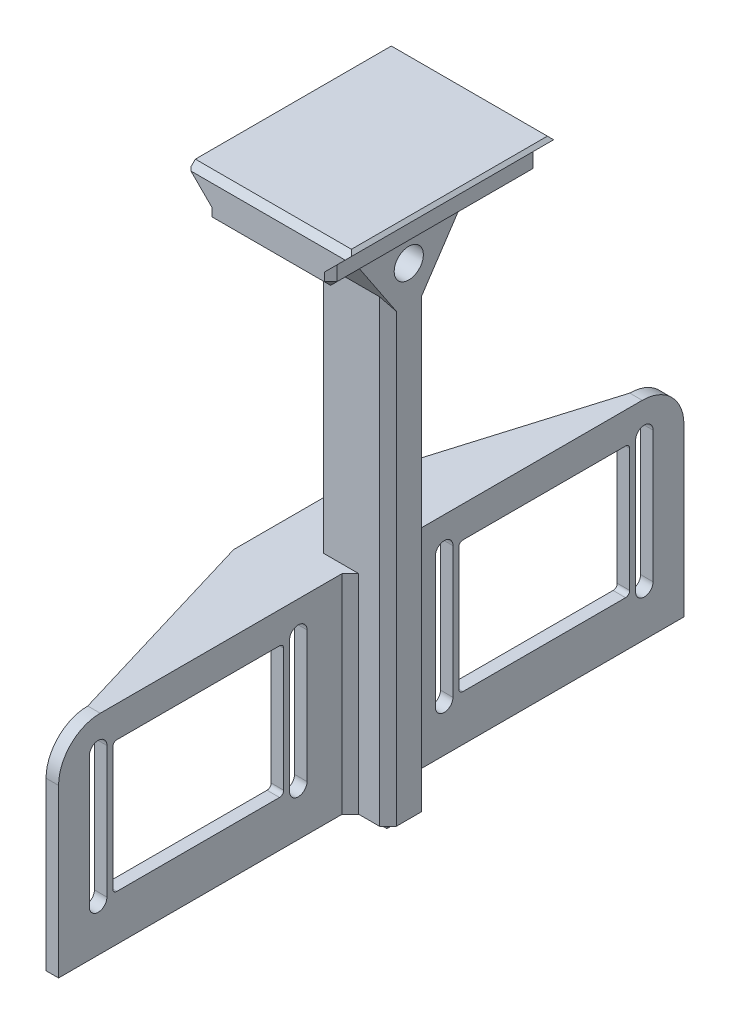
ISO-10303-21;
HEADER;
FILE_DESCRIPTION(('STEP AP214'),'2;1');
FILE_NAME('part.step','',(''),(''),'','','');
FILE_SCHEMA(('AUTOMOTIVE_DESIGN { 1 0 10303 214 1 1 1 1 }'));
ENDSEC;
DATA;
#1=APPLICATION_CONTEXT('core data for automotive mechanical design processes');
#2=APPLICATION_PROTOCOL_DEFINITION('international standard','automotive_design',2000,#1);
#3=PRODUCT_CONTEXT('',#1,'mechanical');
#4=PRODUCT('Part','Part','',(#3));
#5=PRODUCT_RELATED_PRODUCT_CATEGORY('part','',(#4));
#6=PRODUCT_DEFINITION_FORMATION('','',#4);
#7=PRODUCT_DEFINITION_CONTEXT('part definition',#1,'design');
#8=PRODUCT_DEFINITION('design','',#6,#7);
#9=PRODUCT_DEFINITION_SHAPE('','',#8);
#10=(LENGTH_UNIT() NAMED_UNIT(*) SI_UNIT(.MILLI.,.METRE.));
#11=(NAMED_UNIT(*) PLANE_ANGLE_UNIT() SI_UNIT($,.RADIAN.));
#12=(NAMED_UNIT(*) SI_UNIT($,.STERADIAN.) SOLID_ANGLE_UNIT());
#13=UNCERTAINTY_MEASURE_WITH_UNIT(LENGTH_MEASURE(1.E-05),#10,'distance_accuracy_value','');
#14=(GEOMETRIC_REPRESENTATION_CONTEXT(3) GLOBAL_UNCERTAINTY_ASSIGNED_CONTEXT((#13)) GLOBAL_UNIT_ASSIGNED_CONTEXT((#10,
#11,#12)) REPRESENTATION_CONTEXT('',''));
#15=CARTESIAN_POINT('',(0.,0.,0.));
#16=DIRECTION('',(0.,0.,1.));
#17=DIRECTION('',(1.,0.,0.));
#18=AXIS2_PLACEMENT_3D('',#15,#16,#17);
#19=CARTESIAN_POINT('',(0.,125.,0.));
#20=DIRECTION('',(1.,0.,0.));
#21=DIRECTION('',(0.,0.,-1.));
#22=AXIS2_PLACEMENT_3D('',#19,#20,#21);
#23=PLANE('',#22);
#24=DIRECTION('',(0.,0.,-1.));
#25=VECTOR('',#24,1.);
#26=CARTESIAN_POINT('',(0.,5.99999999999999,-2.00000000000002));
#27=LINE('',#26,#25);
#28=CARTESIAN_POINT('',(0.,5.99999999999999,-2.00000000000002));
#29=VERTEX_POINT('',#28);
#30=CARTESIAN_POINT('',(0.,5.99999999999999,-8.00000000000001));
#31=VERTEX_POINT('',#30);
#32=EDGE_CURVE('E725',#29,#31,#27,.T.);
#33=ORIENTED_EDGE('',*,*,#32,.F.);
#34=DIRECTION('',(0.,1.,0.));
#35=VECTOR('',#34,1.);
#36=CARTESIAN_POINT('',(0.,125.,-2.00000000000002));
#37=LINE('',#36,#35);
#38=CARTESIAN_POINT('',(0.,47.,-2.00000000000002));
#39=VERTEX_POINT('',#38);
#40=EDGE_CURVE('E979',#29,#39,#37,.T.);
#41=ORIENTED_EDGE('',*,*,#40,.T.);
#42=DIRECTION('',(0.,0.,1.));
#43=VECTOR('',#42,1.);
#44=CARTESIAN_POINT('',(0.,47.,0.));
#45=LINE('',#44,#43);
#46=CARTESIAN_POINT('',(0.,47.,-8.00000000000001));
#47=VERTEX_POINT('',#46);
#48=EDGE_CURVE('E812',#47,#39,#45,.T.);
#49=ORIENTED_EDGE('',*,*,#48,.F.);
#50=DIRECTION('',(0.,-1.,0.));
#51=VECTOR('',#50,1.);
#52=CARTESIAN_POINT('',(0.,125.,-8.00000000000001));
#53=LINE('',#52,#51);
#54=EDGE_CURVE('E978',#47,#31,#53,.T.);
#55=ORIENTED_EDGE('',*,*,#54,.T.);
#56=EDGE_LOOP('',(#33,#41,#49,#55));
#57=FACE_BOUND('',#56,.T.);
#58=ADVANCED_FACE('F42',(#57),#23,.F.);
#59=CARTESIAN_POINT('',(23.75,135.,0.));
#60=DIRECTION('',(1.,0.,0.));
#61=DIRECTION('',(0.,0.,-1.));
#62=AXIS2_PLACEMENT_3D('',#59,#60,#61);
#63=PLANE('',#62);
#64=DIRECTION('',(0.,0.,1.));
#65=VECTOR('',#64,1.);
#66=CARTESIAN_POINT('',(23.75,130.,-30.));
#67=LINE('',#66,#65);
#68=CARTESIAN_POINT('',(23.75,130.,-28.5));
#69=VERTEX_POINT('',#68);
#70=CARTESIAN_POINT('',(23.75,130.,18.5));
#71=VERTEX_POINT('',#70);
#72=EDGE_CURVE('E756',#69,#71,#67,.T.);
#73=ORIENTED_EDGE('',*,*,#72,.T.);
#74=DIRECTION('',(0.,-1.,0.));
#75=VECTOR('',#74,1.);
#76=CARTESIAN_POINT('',(23.75,125.,18.5));
#77=LINE('',#76,#75);
#78=CARTESIAN_POINT('',(23.75,126.5,18.5));
#79=VERTEX_POINT('',#78);
#80=EDGE_CURVE('E1175',#71,#79,#77,.T.);
#81=ORIENTED_EDGE('',*,*,#80,.T.);
#82=DIRECTION('',(0.,0.,-1.));
#83=VECTOR('',#82,1.);
#84=CARTESIAN_POINT('',(23.75,126.5,-30.));
#85=LINE('',#84,#83);
#86=CARTESIAN_POINT('',(23.75,126.5,-28.5));
#87=VERTEX_POINT('',#86);
#88=EDGE_CURVE('E1173',#79,#87,#85,.T.);
#89=ORIENTED_EDGE('',*,*,#88,.T.);
#90=DIRECTION('',(0.,1.,0.));
#91=VECTOR('',#90,1.);
#92=CARTESIAN_POINT('',(23.75,135.,-28.5));
#93=LINE('',#92,#91);
#94=EDGE_CURVE('E1171',#87,#69,#93,.T.);
#95=ORIENTED_EDGE('',*,*,#94,.T.);
#96=EDGE_LOOP('',(#73,#81,#89,#95));
#97=FACE_BOUND('',#96,.T.);
#98=ADVANCED_FACE('F1444',(#97),#63,.T.);
#99=CARTESIAN_POINT('',(-6.24999999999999,135.,0.));
#100=DIRECTION('',(1.,0.,0.));
#101=DIRECTION('',(0.,0.,-1.));
#102=AXIS2_PLACEMENT_3D('',#99,#100,#101);
#103=PLANE('',#102);
#104=DIRECTION('',(0.,0.,1.));
#105=VECTOR('',#104,1.);
#106=CARTESIAN_POINT('',(-6.24999999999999,126.5,0.));
#107=LINE('',#106,#105);
#108=CARTESIAN_POINT('',(-6.25,126.5,-28.5));
#109=VERTEX_POINT('',#108);
#110=CARTESIAN_POINT('',(-6.24999999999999,126.5,18.5));
#111=VERTEX_POINT('',#110);
#112=EDGE_CURVE('E1148',#109,#111,#107,.T.);
#113=ORIENTED_EDGE('',*,*,#112,.T.);
#114=DIRECTION('',(0.,1.,0.));
#115=VECTOR('',#114,1.);
#116=CARTESIAN_POINT('',(-6.24999999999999,135.,18.5));
#117=LINE('',#116,#115);
#118=CARTESIAN_POINT('',(-6.24999999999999,130.,18.5));
#119=VERTEX_POINT('',#118);
#120=EDGE_CURVE('E1151',#111,#119,#117,.T.);
#121=ORIENTED_EDGE('',*,*,#120,.T.);
#122=DIRECTION('',(0.,0.,1.));
#123=VECTOR('',#122,1.);
#124=CARTESIAN_POINT('',(-6.24999999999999,130.,-30.));
#125=LINE('',#124,#123);
#126=CARTESIAN_POINT('',(-6.24999999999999,130.,-28.5));
#127=VERTEX_POINT('',#126);
#128=EDGE_CURVE('E752',#127,#119,#125,.T.);
#129=ORIENTED_EDGE('',*,*,#128,.F.);
#130=DIRECTION('',(0.,-1.,0.));
#131=VECTOR('',#130,1.);
#132=CARTESIAN_POINT('',(-6.25,125.,-28.5));
#133=LINE('',#132,#131);
#134=EDGE_CURVE('E1146',#127,#109,#133,.T.);
#135=ORIENTED_EDGE('',*,*,#134,.T.);
#136=EDGE_LOOP('',(#113,#121,#129,#135));
#137=FACE_BOUND('',#136,.T.);
#138=ADVANCED_FACE('F1451',(#137),#103,.F.);
#139=CARTESIAN_POINT('',(0.,115.5,-5.));
#140=DIRECTION('',(-1.,0.,0.));
#141=DIRECTION('',(0.,0.,1.));
#142=AXIS2_PLACEMENT_3D('',#139,#140,#141);
#143=CIRCLE('',#142,3.5);
#144=CARTESIAN_POINT('',(0.,115.5,-1.5));
#145=VERTEX_POINT('',#144);
#146=EDGE_CURVE('E1469',#145,#145,#143,.T.);
#147=ORIENTED_EDGE('',*,*,#146,.F.);
#148=EDGE_LOOP('',(#147));
#149=FACE_BOUND('',#148,.T.);
#150=DIRECTION('',(0.,-0.832050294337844,-0.554700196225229));
#151=VECTOR('',#150,1.);
#152=CARTESIAN_POINT('',(0.,125.,10.));
#153=LINE('',#152,#151);
#154=CARTESIAN_POINT('',(0.,122.,7.99999999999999));
#155=VERTEX_POINT('',#154);
#156=CARTESIAN_POINT('',(0.,107.,-2.00000000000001));
#157=VERTEX_POINT('',#156);
#158=EDGE_CURVE('E929',#155,#157,#153,.T.);
#159=ORIENTED_EDGE('',*,*,#158,.F.);
#160=DIRECTION('',(0.,0.,-1.));
#161=VECTOR('',#160,1.);
#162=CARTESIAN_POINT('',(0.,122.,-20.));
#163=LINE('',#162,#161);
#164=CARTESIAN_POINT('',(0.,122.,-18.));
#165=VERTEX_POINT('',#164);
#166=EDGE_CURVE('E65',#155,#165,#163,.T.);
#167=ORIENTED_EDGE('',*,*,#166,.T.);
#168=DIRECTION('',(0.,0.832050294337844,-0.554700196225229));
#169=VECTOR('',#168,1.);
#170=CARTESIAN_POINT('',(0.,125.,-20.));
#171=LINE('',#170,#169);
#172=CARTESIAN_POINT('',(0.,107.,-8.00000000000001));
#173=VERTEX_POINT('',#172);
#174=EDGE_CURVE('E915',#173,#165,#171,.T.);
#175=ORIENTED_EDGE('',*,*,#174,.F.);
#176=CARTESIAN_POINT('',(0.,50.,-8.00000000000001));
#177=VERTEX_POINT('',#176);
#178=EDGE_CURVE('E980',#173,#177,#53,.T.);
#179=ORIENTED_EDGE('',*,*,#178,.T.);
#180=DIRECTION('',(0.,0.,1.));
#181=VECTOR('',#180,1.);
#182=CARTESIAN_POINT('',(0.,50.,0.));
#183=LINE('',#182,#181);
#184=CARTESIAN_POINT('',(0.,50.,-2.00000000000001));
#185=VERTEX_POINT('',#184);
#186=EDGE_CURVE('E802',#177,#185,#183,.T.);
#187=ORIENTED_EDGE('',*,*,#186,.T.);
#188=EDGE_CURVE('E974',#185,#157,#37,.T.);
#189=ORIENTED_EDGE('',*,*,#188,.T.);
#190=EDGE_LOOP('',(#159,#167,#175,#179,#187,#189));
#191=FACE_BOUND('',#190,.T.);
#192=ADVANCED_FACE('F1293',(#149,#191),#23,.F.);
#193=CARTESIAN_POINT('',(17.5,125.,0.));
#194=DIRECTION('',(-1.,0.,0.));
#195=DIRECTION('',(0.,0.,1.));
#196=AXIS2_PLACEMENT_3D('',#193,#194,#195);
#197=PLANE('',#196);
#198=CARTESIAN_POINT('',(17.5,115.5,-5.));
#199=DIRECTION('',(-1.,0.,0.));
#200=DIRECTION('',(0.,0.,1.));
#201=AXIS2_PLACEMENT_3D('',#198,#199,#200);
#202=CIRCLE('',#201,3.5);
#203=CARTESIAN_POINT('',(17.5,115.5,-1.5));
#204=VERTEX_POINT('',#203);
#205=EDGE_CURVE('E47',#204,#204,#202,.T.);
#206=ORIENTED_EDGE('',*,*,#205,.T.);
#207=EDGE_LOOP('',(#206));
#208=FACE_BOUND('',#207,.T.);
#209=DIRECTION('',(0.,0.832050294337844,-0.554700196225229));
#210=VECTOR('',#209,1.);
#211=CARTESIAN_POINT('',(17.5,125.,-20.));
#212=LINE('',#211,#210);
#213=CARTESIAN_POINT('',(17.5,107.,-8.00000000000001));
#214=VERTEX_POINT('',#213);
#215=CARTESIAN_POINT('',(17.5,122.,-18.));
#216=VERTEX_POINT('',#215);
#217=EDGE_CURVE('E918',#214,#216,#212,.T.);
#218=ORIENTED_EDGE('',*,*,#217,.T.);
#219=DIRECTION('',(0.,0.,1.));
#220=VECTOR('',#219,1.);
#221=CARTESIAN_POINT('',(17.5,122.,10.));
#222=LINE('',#221,#220);
#223=CARTESIAN_POINT('',(17.5,122.,8.00000000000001));
#224=VERTEX_POINT('',#223);
#225=EDGE_CURVE('E1267',#216,#224,#222,.T.);
#226=ORIENTED_EDGE('',*,*,#225,.T.);
#227=DIRECTION('',(0.,-0.832050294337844,-0.554700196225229));
#228=VECTOR('',#227,1.);
#229=CARTESIAN_POINT('',(17.5,125.,10.));
#230=LINE('',#229,#228);
#231=CARTESIAN_POINT('',(17.5,107.,-2.));
#232=VERTEX_POINT('',#231);
#233=EDGE_CURVE('E921',#224,#232,#230,.T.);
#234=ORIENTED_EDGE('',*,*,#233,.T.);
#235=DIRECTION('',(0.,-1.,0.));
#236=VECTOR('',#235,1.);
#237=CARTESIAN_POINT('',(17.5,125.,-2.));
#238=LINE('',#237,#236);
#239=CARTESIAN_POINT('',(17.5,0.,-2.));
#240=VERTEX_POINT('',#239);
#241=EDGE_CURVE('E947',#232,#240,#238,.T.);
#242=ORIENTED_EDGE('',*,*,#241,.T.);
#243=DIRECTION('',(0.,0.,-1.));
#244=VECTOR('',#243,1.);
#245=CARTESIAN_POINT('',(17.5,0.,0.));
#246=LINE('',#245,#244);
#247=CARTESIAN_POINT('',(17.5,0.,-8.00000000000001));
#248=VERTEX_POINT('',#247);
#249=EDGE_CURVE('E937',#240,#248,#246,.T.);
#250=ORIENTED_EDGE('',*,*,#249,.T.);
#251=DIRECTION('',(0.,1.,0.));
#252=VECTOR('',#251,1.);
#253=CARTESIAN_POINT('',(17.5,125.,-8.00000000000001));
#254=LINE('',#253,#252);
#255=EDGE_CURVE('E944',#248,#214,#254,.T.);
#256=ORIENTED_EDGE('',*,*,#255,.T.);
#257=EDGE_LOOP('',(#218,#226,#234,#242,#250,#256));
#258=FACE_BOUND('',#257,.T.);
#259=ADVANCED_FACE('F1317',(#208,#258),#197,.F.);
#260=CARTESIAN_POINT('',(0.,125.,0.));
#261=DIRECTION('',(0.,0.,-1.));
#262=DIRECTION('',(-1.,0.,0.));
#263=AXIS2_PLACEMENT_3D('',#260,#261,#262);
#264=PLANE('',#263);
#265=DIRECTION('',(1.,0.,0.));
#266=VECTOR('',#265,1.);
#267=CARTESIAN_POINT('',(0.,47.,0.));
#268=LINE('',#267,#266);
#269=CARTESIAN_POINT('',(2.,47.,0.));
#270=VERTEX_POINT('',#269);
#271=CARTESIAN_POINT('',(3.5,47.,0.));
#272=VERTEX_POINT('',#271);
#273=EDGE_CURVE('E807',#270,#272,#268,.T.);
#274=ORIENTED_EDGE('',*,*,#273,.F.);
#275=DIRECTION('',(0.,-1.,0.));
#276=VECTOR('',#275,1.);
#277=CARTESIAN_POINT('',(2.,125.,0.));
#278=LINE('',#277,#276);
#279=CARTESIAN_POINT('',(2.,0.,0.));
#280=VERTEX_POINT('',#279);
#281=EDGE_CURVE('E961',#270,#280,#278,.T.);
#282=ORIENTED_EDGE('',*,*,#281,.T.);
#283=DIRECTION('',(1.,0.,0.));
#284=VECTOR('',#283,1.);
#285=CARTESIAN_POINT('',(0.,0.,0.));
#286=LINE('',#285,#284);
#287=CARTESIAN_POINT('',(3.5,0.,0.));
#288=VERTEX_POINT('',#287);
#289=EDGE_CURVE('E934',#280,#288,#286,.T.);
#290=ORIENTED_EDGE('',*,*,#289,.T.);
#291=DIRECTION('',(0.,1.,0.));
#292=VECTOR('',#291,1.);
#293=CARTESIAN_POINT('',(3.5,50.,0.));
#294=LINE('',#293,#292);
#295=EDGE_CURVE('E1020',#288,#272,#294,.T.);
#296=ORIENTED_EDGE('',*,*,#295,.T.);
#297=EDGE_LOOP('',(#274,#282,#290,#296));
#298=FACE_BOUND('',#297,.T.);
#299=ADVANCED_FACE('F1389',(#298),#264,.F.);
#300=CARTESIAN_POINT('',(0.,125.,-10.));
#301=DIRECTION('',(0.,0.,1.));
#302=DIRECTION('',(1.,0.,0.));
#303=AXIS2_PLACEMENT_3D('',#300,#301,#302);
#304=PLANE('',#303);
#305=DIRECTION('',(-1.,0.,0.));
#306=VECTOR('',#305,1.);
#307=CARTESIAN_POINT('',(0.,47.,-10.));
#308=LINE('',#307,#306);
#309=CARTESIAN_POINT('',(3.5,47.,-10.));
#310=VERTEX_POINT('',#309);
#311=CARTESIAN_POINT('',(1.99999999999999,47.,-10.));
#312=VERTEX_POINT('',#311);
#313=EDGE_CURVE('E818',#310,#312,#308,.T.);
#314=ORIENTED_EDGE('',*,*,#313,.F.);
#315=DIRECTION('',(0.,-1.,0.));
#316=VECTOR('',#315,1.);
#317=CARTESIAN_POINT('',(3.5,0.,-10.));
#318=LINE('',#317,#316);
#319=CARTESIAN_POINT('',(3.5,0.,-10.));
#320=VERTEX_POINT('',#319);
#321=EDGE_CURVE('E1028',#310,#320,#318,.T.);
#322=ORIENTED_EDGE('',*,*,#321,.T.);
#323=DIRECTION('',(-1.,0.,0.));
#324=VECTOR('',#323,1.);
#325=CARTESIAN_POINT('',(0.,0.,-10.));
#326=LINE('',#325,#324);
#327=CARTESIAN_POINT('',(1.99999999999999,0.,-10.));
#328=VERTEX_POINT('',#327);
#329=EDGE_CURVE('E940',#320,#328,#326,.T.);
#330=ORIENTED_EDGE('',*,*,#329,.T.);
#331=DIRECTION('',(0.,1.,0.));
#332=VECTOR('',#331,1.);
#333=CARTESIAN_POINT('',(1.99999999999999,125.,-10.));
#334=LINE('',#333,#332);
#335=EDGE_CURVE('E968',#328,#312,#334,.T.);
#336=ORIENTED_EDGE('',*,*,#335,.T.);
#337=EDGE_LOOP('',(#314,#322,#330,#336));
#338=FACE_BOUND('',#337,.T.);
#339=ADVANCED_FACE('F1364',(#338),#304,.F.);
#340=CARTESIAN_POINT('',(0.,125.,-8.00000000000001));
#341=DIRECTION('',(0.707106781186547,0.,0.707106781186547));
#342=DIRECTION('',(0.,-1.,0.));
#343=AXIS2_PLACEMENT_3D('',#340,#341,#342);
#344=PLANE('',#343);
#345=ORIENTED_EDGE('',*,*,#54,.F.);
#346=DIRECTION('',(-0.707106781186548,0.,0.707106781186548));
#347=VECTOR('',#346,1.);
#348=CARTESIAN_POINT('',(0.,47.,-8.00000000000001));
#349=LINE('',#348,#347);
#350=EDGE_CURVE('E815',#47,#312,#349,.F.);
#351=ORIENTED_EDGE('',*,*,#350,.T.);
#352=ORIENTED_EDGE('',*,*,#335,.F.);
#353=DIRECTION('',(-0.707106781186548,0.,0.707106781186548));
#354=VECTOR('',#353,1.);
#355=CARTESIAN_POINT('',(-4.00000000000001,0.,-4.00000000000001));
#356=LINE('',#355,#354);
#357=CARTESIAN_POINT('',(0.,0.,-8.00000000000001));
#358=VERTEX_POINT('',#357);
#359=EDGE_CURVE('E953',#358,#328,#356,.F.);
#360=ORIENTED_EDGE('',*,*,#359,.F.);
#361=DIRECTION('',(0.,-1.,0.));
#362=VECTOR('',#361,1.);
#363=CARTESIAN_POINT('',(0.,0.,-8.00000000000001));
#364=LINE('',#363,#362);
#365=EDGE_CURVE('E730',#31,#358,#364,.T.);
#366=ORIENTED_EDGE('',*,*,#365,.F.);
#367=EDGE_LOOP('',(#345,#351,#352,#360,#366));
#368=FACE_BOUND('',#367,.T.);
#369=ADVANCED_FACE('F1368',(#368),#344,.F.);
#370=CARTESIAN_POINT('',(2.,125.,0.));
#371=DIRECTION('',(0.70710678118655,0.,-0.707106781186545));
#372=DIRECTION('',(0.,-1.,0.));
#373=AXIS2_PLACEMENT_3D('',#370,#371,#372);
#374=PLANE('',#373);
#375=ORIENTED_EDGE('',*,*,#281,.F.);
#376=DIRECTION('',(0.707106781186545,0.,0.70710678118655));
#377=VECTOR('',#376,1.);
#378=CARTESIAN_POINT('',(2.00000000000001,47.,0.));
#379=LINE('',#378,#377);
#380=EDGE_CURVE('E809',#270,#39,#379,.F.);
#381=ORIENTED_EDGE('',*,*,#380,.T.);
#382=ORIENTED_EDGE('',*,*,#40,.F.);
#383=CARTESIAN_POINT('',(0.,0.,-2.00000000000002));
#384=VERTEX_POINT('',#383);
#385=EDGE_CURVE('E975',#384,#29,#37,.T.);
#386=ORIENTED_EDGE('',*,*,#385,.F.);
#387=DIRECTION('',(0.707106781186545,0.,0.70710678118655));
#388=VECTOR('',#387,1.);
#389=CARTESIAN_POINT('',(1.00000000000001,0.,-1.));
#390=LINE('',#389,#388);
#391=EDGE_CURVE('E950',#280,#384,#390,.F.);
#392=ORIENTED_EDGE('',*,*,#391,.F.);
#393=EDGE_LOOP('',(#375,#381,#382,#386,#392));
#394=FACE_BOUND('',#393,.T.);
#395=ADVANCED_FACE('F1375',(#394),#374,.F.);
#396=CARTESIAN_POINT('',(3.5,125.,-10.));
#397=DIRECTION('',(-0.707106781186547,0.,-0.707106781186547));
#398=DIRECTION('',(0.,1.,0.));
#399=AXIS2_PLACEMENT_3D('',#396,#397,#398);
#400=PLANE('',#399);
#401=DIRECTION('',(0.707106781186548,0.,-0.707106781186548));
#402=VECTOR('',#401,1.);
#403=CARTESIAN_POINT('',(3.5,47.,-10.));
#404=LINE('',#403,#402);
#405=CARTESIAN_POINT('',(5.50000000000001,47.,-12.));
#406=VERTEX_POINT('',#405);
#407=EDGE_CURVE('E820',#406,#310,#404,.F.);
#408=ORIENTED_EDGE('',*,*,#407,.F.);
#409=DIRECTION('',(0.,1.,0.));
#410=VECTOR('',#409,1.);
#411=CARTESIAN_POINT('',(5.5,50.,-12.));
#412=LINE('',#411,#410);
#413=CARTESIAN_POINT('',(5.5,0.,-12.));
#414=VERTEX_POINT('',#413);
#415=EDGE_CURVE('E1033',#414,#406,#412,.T.);
#416=ORIENTED_EDGE('',*,*,#415,.F.);
#417=DIRECTION('',(-0.707106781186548,0.,0.707106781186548));
#418=VECTOR('',#417,1.);
#419=CARTESIAN_POINT('',(3.5,0.,-10.));
#420=LINE('',#419,#418);
#421=EDGE_CURVE('E1048',#320,#414,#420,.F.);
#422=ORIENTED_EDGE('',*,*,#421,.F.);
#423=ORIENTED_EDGE('',*,*,#321,.F.);
#424=EDGE_LOOP('',(#408,#416,#422,#423));
#425=FACE_BOUND('',#424,.T.);
#426=ADVANCED_FACE('F1357',(#425),#400,.T.);
#427=CARTESIAN_POINT('',(5.5,0.,2.));
#428=DIRECTION('',(-0.707106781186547,0.,0.707106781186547));
#429=DIRECTION('',(0.,1.,0.));
#430=AXIS2_PLACEMENT_3D('',#427,#428,#429);
#431=PLANE('',#430);
#432=DIRECTION('',(-0.707106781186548,0.,-0.707106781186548));
#433=VECTOR('',#432,1.);
#434=CARTESIAN_POINT('',(5.5,47.,2.));
#435=LINE('',#434,#433);
#436=CARTESIAN_POINT('',(5.5,47.,1.99999999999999));
#437=VERTEX_POINT('',#436);
#438=EDGE_CURVE('E1144',#272,#437,#435,.F.);
#439=ORIENTED_EDGE('',*,*,#438,.F.);
#440=ORIENTED_EDGE('',*,*,#295,.F.);
#441=DIRECTION('',(0.707106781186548,0.,0.707106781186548));
#442=VECTOR('',#441,1.);
#443=CARTESIAN_POINT('',(5.5,0.,2.));
#444=LINE('',#443,#442);
#445=CARTESIAN_POINT('',(5.5,0.,2.));
#446=VERTEX_POINT('',#445);
#447=EDGE_CURVE('E1050',#446,#288,#444,.F.);
#448=ORIENTED_EDGE('',*,*,#447,.F.);
#449=DIRECTION('',(0.,-1.,0.));
#450=VECTOR('',#449,1.);
#451=CARTESIAN_POINT('',(5.5,0.,2.));
#452=LINE('',#451,#450);
#453=EDGE_CURVE('E1036',#437,#446,#452,.T.);
#454=ORIENTED_EDGE('',*,*,#453,.F.);
#455=EDGE_LOOP('',(#439,#440,#448,#454));
#456=FACE_BOUND('',#455,.T.);
#457=ADVANCED_FACE('F1394',(#456),#431,.T.);
#458=CARTESIAN_POINT('',(5.5,50.,-80.));
#459=DIRECTION('',(0.,0.,1.));
#460=DIRECTION('',(0.,-1.,0.));
#461=AXIS2_PLACEMENT_3D('',#458,#459,#460);
#462=PLANE('',#461);
#463=DIRECTION('',(0.,-1.,0.));
#464=VECTOR('',#463,1.);
#465=CARTESIAN_POINT('',(5.5,50.,-80.));
#466=LINE('',#465,#464);
#467=CARTESIAN_POINT('',(5.5,40.,-80.));
#468=VERTEX_POINT('',#467);
#469=CARTESIAN_POINT('',(5.5,0.,-80.));
#470=VERTEX_POINT('',#469);
#471=EDGE_CURVE('E874',#468,#470,#466,.T.);
#472=ORIENTED_EDGE('',*,*,#471,.F.);
#473=DIRECTION('',(1.,0.,0.));
#474=VECTOR('',#473,1.);
#475=CARTESIAN_POINT('',(5.5,40.,-80.));
#476=LINE('',#475,#474);
#477=CARTESIAN_POINT('',(8.5,40.,-80.));
#478=VERTEX_POINT('',#477);
#479=EDGE_CURVE('E1124',#468,#478,#476,.T.);
#480=ORIENTED_EDGE('',*,*,#479,.T.);
#481=DIRECTION('',(0.,1.,0.));
#482=VECTOR('',#481,1.);
#483=CARTESIAN_POINT('',(8.5,50.,-80.));
#484=LINE('',#483,#482);
#485=CARTESIAN_POINT('',(8.5,0.,-80.));
#486=VERTEX_POINT('',#485);
#487=EDGE_CURVE('E858',#486,#478,#484,.T.);
#488=ORIENTED_EDGE('',*,*,#487,.F.);
#489=DIRECTION('',(1.,0.,0.));
#490=VECTOR('',#489,1.);
#491=CARTESIAN_POINT('',(5.5,0.,-80.));
#492=LINE('',#491,#490);
#493=EDGE_CURVE('E876',#470,#486,#492,.T.);
#494=ORIENTED_EDGE('',*,*,#493,.F.);
#495=EDGE_LOOP('',(#472,#480,#488,#494));
#496=FACE_BOUND('',#495,.T.);
#497=ADVANCED_FACE('F1349',(#496),#462,.F.);
#498=CARTESIAN_POINT('',(5.5,50.,70.));
#499=DIRECTION('',(0.,0.,1.));
#500=DIRECTION('',(0.,-1.,0.));
#501=AXIS2_PLACEMENT_3D('',#498,#499,#500);
#502=PLANE('',#501);
#503=DIRECTION('',(0.,-1.,0.));
#504=VECTOR('',#503,1.);
#505=CARTESIAN_POINT('',(8.5,50.,70.));
#506=LINE('',#505,#504);
#507=CARTESIAN_POINT('',(8.5,40.,70.));
#508=VERTEX_POINT('',#507);
#509=CARTESIAN_POINT('',(8.5,0.,70.));
#510=VERTEX_POINT('',#509);
#511=EDGE_CURVE('E847',#508,#510,#506,.T.);
#512=ORIENTED_EDGE('',*,*,#511,.F.);
#513=DIRECTION('',(1.,0.,0.));
#514=VECTOR('',#513,1.);
#515=CARTESIAN_POINT('',(5.5,40.,70.));
#516=LINE('',#515,#514);
#517=CARTESIAN_POINT('',(5.5,40.,70.));
#518=VERTEX_POINT('',#517);
#519=EDGE_CURVE('E1139',#508,#518,#516,.F.);
#520=ORIENTED_EDGE('',*,*,#519,.T.);
#521=DIRECTION('',(0.,-1.,0.));
#522=VECTOR('',#521,1.);
#523=CARTESIAN_POINT('',(5.5,50.,70.));
#524=LINE('',#523,#522);
#525=CARTESIAN_POINT('',(5.5,0.,70.));
#526=VERTEX_POINT('',#525);
#527=EDGE_CURVE('E856',#518,#526,#524,.T.);
#528=ORIENTED_EDGE('',*,*,#527,.T.);
#529=DIRECTION('',(1.,0.,0.));
#530=VECTOR('',#529,1.);
#531=CARTESIAN_POINT('',(5.5,0.,70.));
#532=LINE('',#531,#530);
#533=EDGE_CURVE('E867',#526,#510,#532,.T.);
#534=ORIENTED_EDGE('',*,*,#533,.T.);
#535=EDGE_LOOP('',(#512,#520,#528,#534));
#536=FACE_BOUND('',#535,.T.);
#537=ADVANCED_FACE('F1422',(#536),#502,.T.);
#538=CARTESIAN_POINT('',(5.5,50.,0.));
#539=DIRECTION('',(0.,1.,0.));
#540=DIRECTION('',(0.,0.,1.));
#541=AXIS2_PLACEMENT_3D('',#538,#539,#540);
#542=PLANE('',#541);
#543=DIRECTION('',(1.,0.,0.));
#544=VECTOR('',#543,1.);
#545=CARTESIAN_POINT('',(5.5,50.,-10.));
#546=LINE('',#545,#544);
#547=CARTESIAN_POINT('',(1.99999999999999,50.,-10.));
#548=VERTEX_POINT('',#547);
#549=CARTESIAN_POINT('',(10.5,50.,-10.));
#550=VERTEX_POINT('',#549);
#551=EDGE_CURVE('E877',#548,#550,#546,.T.);
#552=ORIENTED_EDGE('',*,*,#551,.T.);
#553=DIRECTION('',(-0.707106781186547,0.,-0.707106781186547));
#554=VECTOR('',#553,1.);
#555=CARTESIAN_POINT('',(7.99999999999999,50.,-12.5));
#556=LINE('',#555,#554);
#557=CARTESIAN_POINT('',(8.5,50.,-12.));
#558=VERTEX_POINT('',#557);
#559=EDGE_CURVE('E1045',#550,#558,#556,.T.);
#560=ORIENTED_EDGE('',*,*,#559,.T.);
#561=DIRECTION('',(0.,0.,1.));
#562=VECTOR('',#561,1.);
#563=CARTESIAN_POINT('',(8.5,50.,-10.));
#564=LINE('',#563,#562);
#565=CARTESIAN_POINT('',(8.5,50.,-70.));
#566=VERTEX_POINT('',#565);
#567=EDGE_CURVE('E836',#566,#558,#564,.T.);
#568=ORIENTED_EDGE('',*,*,#567,.F.);
#569=DIRECTION('',(1.,0.,0.));
#570=VECTOR('',#569,1.);
#571=CARTESIAN_POINT('',(5.5,50.,-70.));
#572=LINE('',#571,#570);
#573=CARTESIAN_POINT('',(5.5,50.,-70.));
#574=VERTEX_POINT('',#573);
#575=EDGE_CURVE('E1129',#566,#574,#572,.F.);
#576=ORIENTED_EDGE('',*,*,#575,.T.);
#577=DIRECTION('',(-0.287347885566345,0.,0.957826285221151));
#578=VECTOR('',#577,1.);
#579=CARTESIAN_POINT('',(5.5,50.,-70.));
#580=LINE('',#579,#578);
#581=CARTESIAN_POINT('',(-9.5,50.,-20.));
#582=VERTEX_POINT('',#581);
#583=EDGE_CURVE('E763',#574,#582,#580,.T.);
#584=ORIENTED_EDGE('',*,*,#583,.T.);
#585=DIRECTION('',(0.,0.,1.));
#586=VECTOR('',#585,1.);
#587=CARTESIAN_POINT('',(-9.5,50.,-20.));
#588=LINE('',#587,#586);
#589=CARTESIAN_POINT('',(-9.49999999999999,50.,10.));
#590=VERTEX_POINT('',#589);
#591=EDGE_CURVE('E785',#582,#590,#588,.T.);
#592=ORIENTED_EDGE('',*,*,#591,.T.);
#593=DIRECTION('',(0.287347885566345,0.,0.957826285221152));
#594=VECTOR('',#593,1.);
#595=CARTESIAN_POINT('',(-9.49999999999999,50.,10.));
#596=LINE('',#595,#594);
#597=CARTESIAN_POINT('',(5.5,50.,60.));
#598=VERTEX_POINT('',#597);
#599=EDGE_CURVE('E788',#590,#598,#596,.T.);
#600=ORIENTED_EDGE('',*,*,#599,.T.);
#601=DIRECTION('',(1.,0.,0.));
#602=VECTOR('',#601,1.);
#603=CARTESIAN_POINT('',(5.5,50.,60.));
#604=LINE('',#603,#602);
#605=CARTESIAN_POINT('',(8.5,50.,60.));
#606=VERTEX_POINT('',#605);
#607=EDGE_CURVE('E1134',#598,#606,#604,.T.);
#608=ORIENTED_EDGE('',*,*,#607,.T.);
#609=DIRECTION('',(0.,0.,1.));
#610=VECTOR('',#609,1.);
#611=CARTESIAN_POINT('',(8.5,50.,70.));
#612=LINE('',#611,#610);
#613=CARTESIAN_POINT('',(8.5,50.,2.));
#614=VERTEX_POINT('',#613);
#615=EDGE_CURVE('E853',#614,#606,#612,.T.);
#616=ORIENTED_EDGE('',*,*,#615,.F.);
#617=DIRECTION('',(0.707106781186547,0.,-0.707106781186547));
#618=VECTOR('',#617,1.);
#619=CARTESIAN_POINT('',(8.5,50.,2.));
#620=LINE('',#619,#618);
#621=CARTESIAN_POINT('',(10.5,50.,0.));
#622=VERTEX_POINT('',#621);
#623=EDGE_CURVE('E1038',#614,#622,#620,.T.);
#624=ORIENTED_EDGE('',*,*,#623,.T.);
#625=DIRECTION('',(1.,0.,0.));
#626=VECTOR('',#625,1.);
#627=CARTESIAN_POINT('',(5.5,50.,0.));
#628=LINE('',#627,#626);
#629=CARTESIAN_POINT('',(2.,50.,0.));
#630=VERTEX_POINT('',#629);
#631=EDGE_CURVE('E866',#630,#622,#628,.T.);
#632=ORIENTED_EDGE('',*,*,#631,.F.);
#633=DIRECTION('',(0.707106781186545,0.,0.70710678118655));
#634=VECTOR('',#633,1.);
#635=CARTESIAN_POINT('',(2.00000000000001,50.,0.));
#636=LINE('',#635,#634);
#637=EDGE_CURVE('E805',#630,#185,#636,.F.);
#638=ORIENTED_EDGE('',*,*,#637,.T.);
#639=ORIENTED_EDGE('',*,*,#186,.F.);
#640=DIRECTION('',(-0.707106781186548,0.,0.707106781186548));
#641=VECTOR('',#640,1.);
#642=CARTESIAN_POINT('',(0.,50.,-8.00000000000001));
#643=LINE('',#642,#641);
#644=EDGE_CURVE('E793',#177,#548,#643,.F.);
#645=ORIENTED_EDGE('',*,*,#644,.T.);
#646=EDGE_LOOP('',(#552,#560,#568,#576,#584,#592,#600,#608,#616,#624,#632,#638,#639,#645));
#647=FACE_BOUND('',#646,.T.);
#648=ADVANCED_FACE('F1301',(#647),#542,.T.);
#649=CARTESIAN_POINT('',(2.,110.,0.));
#650=VERTEX_POINT('',#649);
#651=EDGE_CURVE('E962',#650,#630,#278,.T.);
#652=ORIENTED_EDGE('',*,*,#651,.T.);
#653=ORIENTED_EDGE('',*,*,#631,.T.);
#654=DIRECTION('',(0.,-1.,0.));
#655=VECTOR('',#654,1.);
#656=CARTESIAN_POINT('',(10.5,125.,0.));
#657=LINE('',#656,#655);
#658=CARTESIAN_POINT('',(10.5,0.,0.));
#659=VERTEX_POINT('',#658);
#660=EDGE_CURVE('E1023',#622,#659,#657,.T.);
#661=ORIENTED_EDGE('',*,*,#660,.T.);
#662=CARTESIAN_POINT('',(15.5,0.,0.));
#663=VERTEX_POINT('',#662);
#664=EDGE_CURVE('E924',#659,#663,#286,.T.);
#665=ORIENTED_EDGE('',*,*,#664,.T.);
#666=DIRECTION('',(0.,1.,0.));
#667=VECTOR('',#666,1.);
#668=CARTESIAN_POINT('',(15.5,125.,0.));
#669=LINE('',#668,#667);
#670=CARTESIAN_POINT('',(15.5,110.,0.));
#671=VERTEX_POINT('',#670);
#672=EDGE_CURVE('E965',#663,#671,#669,.T.);
#673=ORIENTED_EDGE('',*,*,#672,.T.);
#674=DIRECTION('',(1.,0.,0.));
#675=VECTOR('',#674,1.);
#676=CARTESIAN_POINT('',(0.,110.,0.));
#677=LINE('',#676,#675);
#678=EDGE_CURVE('E914',#650,#671,#677,.T.);
#679=ORIENTED_EDGE('',*,*,#678,.F.);
#680=EDGE_LOOP('',(#652,#653,#661,#665,#673,#679));
#681=FACE_BOUND('',#680,.T.);
#682=ADVANCED_FACE('F1309',(#681),#264,.F.);
#683=ORIENTED_EDGE('',*,*,#551,.F.);
#684=CARTESIAN_POINT('',(1.99999999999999,110.,-10.));
#685=VERTEX_POINT('',#684);
#686=EDGE_CURVE('E967',#548,#685,#334,.T.);
#687=ORIENTED_EDGE('',*,*,#686,.T.);
#688=DIRECTION('',(1.,0.,0.));
#689=VECTOR('',#688,1.);
#690=CARTESIAN_POINT('',(0.,110.,-10.));
#691=LINE('',#690,#689);
#692=CARTESIAN_POINT('',(15.5,110.,-10.));
#693=VERTEX_POINT('',#692);
#694=EDGE_CURVE('E917',#685,#693,#691,.T.);
#695=ORIENTED_EDGE('',*,*,#694,.T.);
#696=DIRECTION('',(0.,-1.,0.));
#697=VECTOR('',#696,1.);
#698=CARTESIAN_POINT('',(15.5,125.,-10.));
#699=LINE('',#698,#697);
#700=CARTESIAN_POINT('',(15.5,0.,-10.));
#701=VERTEX_POINT('',#700);
#702=EDGE_CURVE('E971',#693,#701,#699,.T.);
#703=ORIENTED_EDGE('',*,*,#702,.T.);
#704=CARTESIAN_POINT('',(10.5,0.,-10.));
#705=VERTEX_POINT('',#704);
#706=EDGE_CURVE('E941',#701,#705,#326,.T.);
#707=ORIENTED_EDGE('',*,*,#706,.T.);
#708=DIRECTION('',(0.,1.,0.));
#709=VECTOR('',#708,1.);
#710=CARTESIAN_POINT('',(10.5,125.,-10.));
#711=LINE('',#710,#709);
#712=EDGE_CURVE('E1030',#705,#550,#711,.T.);
#713=ORIENTED_EDGE('',*,*,#712,.T.);
#714=EDGE_LOOP('',(#683,#687,#695,#703,#707,#713));
#715=FACE_BOUND('',#714,.T.);
#716=ADVANCED_FACE('F1329',(#715),#304,.F.);
#717=CARTESIAN_POINT('',(0.,0.,0.));
#718=DIRECTION('',(0.,-1.,0.));
#719=DIRECTION('',(0.,0.,-1.));
#720=AXIS2_PLACEMENT_3D('',#717,#718,#719);
#721=PLANE('',#720);
#722=ORIENTED_EDGE('',*,*,#664,.F.);
#723=DIRECTION('',(-0.707106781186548,0.,0.707106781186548));
#724=VECTOR('',#723,1.);
#725=CARTESIAN_POINT('',(8.5,0.,2.));
#726=LINE('',#725,#724);
#727=CARTESIAN_POINT('',(8.5,0.,2.));
#728=VERTEX_POINT('',#727);
#729=EDGE_CURVE('E1041',#659,#728,#726,.T.);
#730=ORIENTED_EDGE('',*,*,#729,.T.);
#731=DIRECTION('',(0.,0.,-1.));
#732=VECTOR('',#731,1.);
#733=CARTESIAN_POINT('',(8.5,0.,70.));
#734=LINE('',#733,#732);
#735=EDGE_CURVE('E849',#510,#728,#734,.T.);
#736=ORIENTED_EDGE('',*,*,#735,.F.);
#737=ORIENTED_EDGE('',*,*,#533,.F.);
#738=DIRECTION('',(0.,0.,1.));
#739=VECTOR('',#738,1.);
#740=CARTESIAN_POINT('',(5.5,0.,0.));
#741=LINE('',#740,#739);
#742=EDGE_CURVE('E863',#446,#526,#741,.T.);
#743=ORIENTED_EDGE('',*,*,#742,.F.);
#744=ORIENTED_EDGE('',*,*,#447,.T.);
#745=ORIENTED_EDGE('',*,*,#289,.F.);
#746=ORIENTED_EDGE('',*,*,#391,.T.);
#747=DIRECTION('',(1.,0.,0.));
#748=VECTOR('',#747,1.);
#749=CARTESIAN_POINT('',(-2.,0.,-2.00000000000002));
#750=LINE('',#749,#748);
#751=CARTESIAN_POINT('',(-2.,0.,-2.00000000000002));
#752=VERTEX_POINT('',#751);
#753=EDGE_CURVE('E736',#752,#384,#750,.T.);
#754=ORIENTED_EDGE('',*,*,#753,.F.);
#755=DIRECTION('',(0.,0.,1.));
#756=VECTOR('',#755,1.);
#757=CARTESIAN_POINT('',(-2.,0.,-2.00000000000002));
#758=LINE('',#757,#756);
#759=CARTESIAN_POINT('',(-2.,0.,-8.00000000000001));
#760=VERTEX_POINT('',#759);
#761=EDGE_CURVE('E734',#760,#752,#758,.T.);
#762=ORIENTED_EDGE('',*,*,#761,.F.);
#763=DIRECTION('',(1.,0.,0.));
#764=VECTOR('',#763,1.);
#765=CARTESIAN_POINT('',(-2.,0.,-8.00000000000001));
#766=LINE('',#765,#764);
#767=EDGE_CURVE('E743',#760,#358,#766,.T.);
#768=ORIENTED_EDGE('',*,*,#767,.T.);
#769=ORIENTED_EDGE('',*,*,#359,.T.);
#770=ORIENTED_EDGE('',*,*,#329,.F.);
#771=ORIENTED_EDGE('',*,*,#421,.T.);
#772=DIRECTION('',(0.,0.,-1.));
#773=VECTOR('',#772,1.);
#774=CARTESIAN_POINT('',(5.5,0.,-10.));
#775=LINE('',#774,#773);
#776=EDGE_CURVE('E870',#414,#470,#775,.T.);
#777=ORIENTED_EDGE('',*,*,#776,.T.);
#778=ORIENTED_EDGE('',*,*,#493,.T.);
#779=DIRECTION('',(0.,0.,-1.));
#780=VECTOR('',#779,1.);
#781=CARTESIAN_POINT('',(8.5,0.,-10.));
#782=LINE('',#781,#780);
#783=CARTESIAN_POINT('',(8.5,0.,-12.));
#784=VERTEX_POINT('',#783);
#785=EDGE_CURVE('E850',#784,#486,#782,.T.);
#786=ORIENTED_EDGE('',*,*,#785,.F.);
#787=DIRECTION('',(0.707106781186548,0.,0.707106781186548));
#788=VECTOR('',#787,1.);
#789=CARTESIAN_POINT('',(8.5,0.,-12.));
#790=LINE('',#789,#788);
#791=EDGE_CURVE('E1043',#784,#705,#790,.T.);
#792=ORIENTED_EDGE('',*,*,#791,.T.);
#793=ORIENTED_EDGE('',*,*,#706,.F.);
#794=DIRECTION('',(-0.707106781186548,0.,-0.707106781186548));
#795=VECTOR('',#794,1.);
#796=CARTESIAN_POINT('',(12.75,0.,-12.75));
#797=LINE('',#796,#795);
#798=EDGE_CURVE('E956',#701,#248,#797,.F.);
#799=ORIENTED_EDGE('',*,*,#798,.T.);
#800=ORIENTED_EDGE('',*,*,#249,.F.);
#801=DIRECTION('',(0.70710678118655,0.,-0.707106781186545));
#802=VECTOR('',#801,1.);
#803=CARTESIAN_POINT('',(7.74999999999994,0.,7.74999999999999));
#804=LINE('',#803,#802);
#805=EDGE_CURVE('E958',#240,#663,#804,.F.);
#806=ORIENTED_EDGE('',*,*,#805,.T.);
#807=EDGE_LOOP('',(#722,#730,#736,#737,#743,#744,#745,#746,#754,#762,#768,#769,#770,#771,#777,
#778,#786,#792,#793,#799,#800,#806));
#808=FACE_BOUND('',#807,.T.);
#809=DIRECTION('',(0.,0.,1.));
#810=VECTOR('',#809,1.);
#811=CARTESIAN_POINT('',(13.75,0.,-3.49999999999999));
#812=LINE('',#811,#810);
#813=CARTESIAN_POINT('',(13.75,0.,-6.49999999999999));
#814=VERTEX_POINT('',#813);
#815=CARTESIAN_POINT('',(13.75,0.,-3.49999999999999));
#816=VERTEX_POINT('',#815);
#817=EDGE_CURVE('E879',#814,#816,#812,.T.);
#818=ORIENTED_EDGE('',*,*,#817,.F.);
#819=DIRECTION('',(1.,0.,0.));
#820=VECTOR('',#819,1.);
#821=CARTESIAN_POINT('',(3.75,0.,-6.49999999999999));
#822=LINE('',#821,#820);
#823=CARTESIAN_POINT('',(3.75,0.,-6.49999999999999));
#824=VERTEX_POINT('',#823);
#825=EDGE_CURVE('E886',#824,#814,#822,.T.);
#826=ORIENTED_EDGE('',*,*,#825,.F.);
#827=DIRECTION('',(0.,0.,-1.));
#828=VECTOR('',#827,1.);
#829=CARTESIAN_POINT('',(3.75,0.,-3.49999999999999));
#830=LINE('',#829,#828);
#831=CARTESIAN_POINT('',(3.75,0.,-3.49999999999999));
#832=VERTEX_POINT('',#831);
#833=EDGE_CURVE('E898',#832,#824,#830,.T.);
#834=ORIENTED_EDGE('',*,*,#833,.F.);
#835=DIRECTION('',(-1.,0.,0.));
#836=VECTOR('',#835,1.);
#837=CARTESIAN_POINT('',(3.75,0.,-3.49999999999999));
#838=LINE('',#837,#836);
#839=EDGE_CURVE('E895',#816,#832,#838,.T.);
#840=ORIENTED_EDGE('',*,*,#839,.F.);
#841=EDGE_LOOP('',(#818,#826,#834,#840));
#842=FACE_BOUND('',#841,.T.);
#843=ADVANCED_FACE('F1321',(#808,#842),#721,.T.);
#844=CARTESIAN_POINT('',(0.,125.,-20.));
#845=DIRECTION('',(0.,-0.554700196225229,-0.832050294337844));
#846=DIRECTION('',(0.,0.832050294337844,-0.554700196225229));
#847=AXIS2_PLACEMENT_3D('',#844,#845,#846);
#848=PLANE('',#847);
#849=ORIENTED_EDGE('',*,*,#217,.F.);
#850=DIRECTION('',(0.485071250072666,-0.727606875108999,0.485071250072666));
#851=VECTOR('',#850,1.);
#852=CARTESIAN_POINT('',(10.2058823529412,117.941176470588,-15.2941176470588));
#853=LINE('',#852,#851);
#854=EDGE_CURVE('E986',#214,#693,#853,.F.);
#855=ORIENTED_EDGE('',*,*,#854,.T.);
#856=ORIENTED_EDGE('',*,*,#694,.F.);
#857=DIRECTION('',(0.485071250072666,0.727606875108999,-0.485071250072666));
#858=VECTOR('',#857,1.);
#859=CARTESIAN_POINT('',(6.35294117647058,116.529411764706,-14.3529411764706));
#860=LINE('',#859,#858);
#861=EDGE_CURVE('E988',#685,#173,#860,.F.);
#862=ORIENTED_EDGE('',*,*,#861,.T.);
#863=ORIENTED_EDGE('',*,*,#174,.T.);
#864=DIRECTION('',(0.639602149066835,-0.639602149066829,0.426401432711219));
#865=VECTOR('',#864,1.);
#866=CARTESIAN_POINT('',(2.45454545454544,119.545454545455,-16.3636363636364));
#867=LINE('',#866,#865);
#868=CARTESIAN_POINT('',(-3.00000000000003,125.,-20.));
#869=VERTEX_POINT('',#868);
#870=EDGE_CURVE('E11',#165,#869,#867,.F.);
#871=ORIENTED_EDGE('',*,*,#870,.T.);
#872=DIRECTION('',(1.,0.,0.));
#873=VECTOR('',#872,1.);
#874=CARTESIAN_POINT('',(0.,125.,-20.));
#875=LINE('',#874,#873);
#876=CARTESIAN_POINT('',(20.5,125.,-20.));
#877=VERTEX_POINT('',#876);
#878=EDGE_CURVE('E922',#869,#877,#875,.T.);
#879=ORIENTED_EDGE('',*,*,#878,.T.);
#880=DIRECTION('',(0.639602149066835,0.639602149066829,-0.426401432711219));
#881=VECTOR('',#880,1.);
#882=CARTESIAN_POINT('',(15.0454545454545,119.545454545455,-16.3636363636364));
#883=LINE('',#882,#881);
#884=EDGE_CURVE('E1270',#877,#216,#883,.F.);
#885=ORIENTED_EDGE('',*,*,#884,.T.);
#886=EDGE_LOOP('',(#849,#855,#856,#862,#863,#871,#879,#885));
#887=FACE_BOUND('',#886,.T.);
#888=ADVANCED_FACE('F1289',(#887),#848,.T.);
#889=CARTESIAN_POINT('',(0.,125.,10.));
#890=DIRECTION('',(0.,-0.554700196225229,0.832050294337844));
#891=DIRECTION('',(0.,-0.832050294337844,-0.554700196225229));
#892=AXIS2_PLACEMENT_3D('',#889,#890,#891);
#893=PLANE('',#892);
#894=ORIENTED_EDGE('',*,*,#233,.F.);
#895=DIRECTION('',(-0.639602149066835,-0.639602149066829,-0.426401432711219));
#896=VECTOR('',#895,1.);
#897=CARTESIAN_POINT('',(17.7727272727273,122.272727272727,8.18181818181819));
#898=LINE('',#897,#896);
#899=CARTESIAN_POINT('',(20.5,125.,10.));
#900=VERTEX_POINT('',#899);
#901=EDGE_CURVE('E1272',#224,#900,#898,.F.);
#902=ORIENTED_EDGE('',*,*,#901,.T.);
#903=DIRECTION('',(1.,0.,0.));
#904=VECTOR('',#903,1.);
#905=CARTESIAN_POINT('',(0.,125.,10.));
#906=LINE('',#905,#904);
#907=CARTESIAN_POINT('',(-3.00000000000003,125.,10.));
#908=VERTEX_POINT('',#907);
#909=EDGE_CURVE('E927',#908,#900,#906,.T.);
#910=ORIENTED_EDGE('',*,*,#909,.F.);
#911=DIRECTION('',(-0.639602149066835,0.639602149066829,0.426401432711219));
#912=VECTOR('',#911,1.);
#913=CARTESIAN_POINT('',(-0.2727272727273,122.272727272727,8.18181818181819));
#914=LINE('',#913,#912);
#915=EDGE_CURVE('E52',#908,#155,#914,.F.);
#916=ORIENTED_EDGE('',*,*,#915,.T.);
#917=ORIENTED_EDGE('',*,*,#158,.T.);
#918=DIRECTION('',(-0.485071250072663,-0.727606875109,-0.485071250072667));
#919=VECTOR('',#918,1.);
#920=CARTESIAN_POINT('',(7.2941176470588,117.941176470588,5.29411764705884));
#921=LINE('',#920,#919);
#922=EDGE_CURVE('E991',#157,#650,#921,.F.);
#923=ORIENTED_EDGE('',*,*,#922,.T.);
#924=ORIENTED_EDGE('',*,*,#678,.T.);
#925=DIRECTION('',(-0.485071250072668,0.727606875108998,0.485071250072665));
#926=VECTOR('',#925,1.);
#927=CARTESIAN_POINT('',(11.1470588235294,116.529411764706,4.35294117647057));
#928=LINE('',#927,#926);
#929=EDGE_CURVE('E983',#671,#232,#928,.F.);
#930=ORIENTED_EDGE('',*,*,#929,.T.);
#931=EDGE_LOOP('',(#894,#902,#910,#916,#917,#923,#924,#930));
#932=FACE_BOUND('',#931,.T.);
#933=ADVANCED_FACE('F1278',(#932),#893,.T.);
#934=CARTESIAN_POINT('',(17.5,125.,-2.));
#935=DIRECTION('',(-0.707106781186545,0.,-0.70710678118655));
#936=DIRECTION('',(0.,-1.,0.));
#937=AXIS2_PLACEMENT_3D('',#934,#935,#936);
#938=PLANE('',#937);
#939=ORIENTED_EDGE('',*,*,#929,.F.);
#940=ORIENTED_EDGE('',*,*,#672,.F.);
#941=ORIENTED_EDGE('',*,*,#805,.F.);
#942=ORIENTED_EDGE('',*,*,#241,.F.);
#943=EDGE_LOOP('',(#939,#940,#941,#942));
#944=FACE_BOUND('',#943,.T.);
#945=ADVANCED_FACE('F1314',(#944),#938,.F.);
#946=CARTESIAN_POINT('',(15.5,125.,-10.));
#947=DIRECTION('',(-0.707106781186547,0.,0.707106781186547));
#948=DIRECTION('',(0.,-1.,0.));
#949=AXIS2_PLACEMENT_3D('',#946,#947,#948);
#950=PLANE('',#949);
#951=ORIENTED_EDGE('',*,*,#854,.F.);
#952=ORIENTED_EDGE('',*,*,#255,.F.);
#953=ORIENTED_EDGE('',*,*,#798,.F.);
#954=ORIENTED_EDGE('',*,*,#702,.F.);
#955=EDGE_LOOP('',(#951,#952,#953,#954));
#956=FACE_BOUND('',#955,.T.);
#957=ADVANCED_FACE('F1327',(#956),#950,.F.);
#958=ORIENTED_EDGE('',*,*,#644,.F.);
#959=ORIENTED_EDGE('',*,*,#178,.F.);
#960=ORIENTED_EDGE('',*,*,#861,.F.);
#961=ORIENTED_EDGE('',*,*,#686,.F.);
#962=EDGE_LOOP('',(#958,#959,#960,#961));
#963=FACE_BOUND('',#962,.T.);
#964=ADVANCED_FACE('F1298',(#963),#344,.F.);
#965=ORIENTED_EDGE('',*,*,#637,.F.);
#966=ORIENTED_EDGE('',*,*,#651,.F.);
#967=ORIENTED_EDGE('',*,*,#922,.F.);
#968=ORIENTED_EDGE('',*,*,#188,.F.);
#969=EDGE_LOOP('',(#965,#966,#967,#968));
#970=FACE_BOUND('',#969,.T.);
#971=ADVANCED_FACE('F1305',(#970),#374,.F.);
#972=CARTESIAN_POINT('',(13.75,-3.1,-3.49999999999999));
#973=DIRECTION('',(-1.,0.,0.));
#974=DIRECTION('',(0.,0.,1.));
#975=AXIS2_PLACEMENT_3D('',#972,#973,#974);
#976=PLANE('',#975);
#977=ORIENTED_EDGE('',*,*,#817,.T.);
#978=DIRECTION('',(0.,1.,0.));
#979=VECTOR('',#978,1.);
#980=CARTESIAN_POINT('',(13.75,-3.1,-3.49999999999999));
#981=LINE('',#980,#979);
#982=CARTESIAN_POINT('',(13.75,-3.1,-3.49999999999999));
#983=VERTEX_POINT('',#982);
#984=EDGE_CURVE('E911',#983,#816,#981,.T.);
#985=ORIENTED_EDGE('',*,*,#984,.F.);
#986=DIRECTION('',(0.,0.,1.));
#987=VECTOR('',#986,1.);
#988=CARTESIAN_POINT('',(13.75,-3.1,-3.49999999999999));
#989=LINE('',#988,#987);
#990=CARTESIAN_POINT('',(13.75,-3.1,-6.49999999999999));
#991=VERTEX_POINT('',#990);
#992=EDGE_CURVE('E882',#991,#983,#989,.T.);
#993=ORIENTED_EDGE('',*,*,#992,.F.);
#994=DIRECTION('',(0.,1.,0.));
#995=VECTOR('',#994,1.);
#996=CARTESIAN_POINT('',(13.75,-3.1,-6.49999999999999));
#997=LINE('',#996,#995);
#998=EDGE_CURVE('E892',#991,#814,#997,.T.);
#999=ORIENTED_EDGE('',*,*,#998,.T.);
#1000=EDGE_LOOP('',(#977,#985,#993,#999));
#1001=FACE_BOUND('',#1000,.T.);
#1002=ADVANCED_FACE('F1809',(#1001),#976,.F.);
#1003=CARTESIAN_POINT('',(3.75,-3.1,-3.49999999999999));
#1004=DIRECTION('',(0.,0.,-1.));
#1005=DIRECTION('',(-1.,0.,0.));
#1006=AXIS2_PLACEMENT_3D('',#1003,#1004,#1005);
#1007=PLANE('',#1006);
#1008=ORIENTED_EDGE('',*,*,#839,.T.);
#1009=DIRECTION('',(0.,1.,0.));
#1010=VECTOR('',#1009,1.);
#1011=CARTESIAN_POINT('',(3.75,-3.1,-3.49999999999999));
#1012=LINE('',#1011,#1010);
#1013=CARTESIAN_POINT('',(3.75,-3.1,-3.49999999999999));
#1014=VERTEX_POINT('',#1013);
#1015=EDGE_CURVE('E908',#1014,#832,#1012,.T.);
#1016=ORIENTED_EDGE('',*,*,#1015,.F.);
#1017=DIRECTION('',(-1.,0.,0.));
#1018=VECTOR('',#1017,1.);
#1019=CARTESIAN_POINT('',(3.75,-3.1,-3.49999999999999));
#1020=LINE('',#1019,#1018);
#1021=EDGE_CURVE('E885',#983,#1014,#1020,.T.);
#1022=ORIENTED_EDGE('',*,*,#1021,.F.);
#1023=ORIENTED_EDGE('',*,*,#984,.T.);
#1024=EDGE_LOOP('',(#1008,#1016,#1022,#1023));
#1025=FACE_BOUND('',#1024,.T.);
#1026=ADVANCED_FACE('F1805',(#1025),#1007,.F.);
#1027=CARTESIAN_POINT('',(3.75,-3.1,-3.49999999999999));
#1028=DIRECTION('',(1.,0.,0.));
#1029=DIRECTION('',(0.,0.,-1.));
#1030=AXIS2_PLACEMENT_3D('',#1027,#1028,#1029);
#1031=PLANE('',#1030);
#1032=ORIENTED_EDGE('',*,*,#833,.T.);
#1033=DIRECTION('',(0.,1.,0.));
#1034=VECTOR('',#1033,1.);
#1035=CARTESIAN_POINT('',(3.75,-3.1,-6.49999999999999));
#1036=LINE('',#1035,#1034);
#1037=CARTESIAN_POINT('',(3.75,-3.1,-6.49999999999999));
#1038=VERTEX_POINT('',#1037);
#1039=EDGE_CURVE('E905',#1038,#824,#1036,.T.);
#1040=ORIENTED_EDGE('',*,*,#1039,.F.);
#1041=DIRECTION('',(0.,0.,-1.));
#1042=VECTOR('',#1041,1.);
#1043=CARTESIAN_POINT('',(3.75,-3.1,-3.49999999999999));
#1044=LINE('',#1043,#1042);
#1045=EDGE_CURVE('E888',#1014,#1038,#1044,.T.);
#1046=ORIENTED_EDGE('',*,*,#1045,.F.);
#1047=ORIENTED_EDGE('',*,*,#1015,.T.);
#1048=EDGE_LOOP('',(#1032,#1040,#1046,#1047));
#1049=FACE_BOUND('',#1048,.T.);
#1050=ADVANCED_FACE('F1801',(#1049),#1031,.F.);
#1051=CARTESIAN_POINT('',(3.75,-3.1,-6.49999999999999));
#1052=DIRECTION('',(0.,0.,1.));
#1053=DIRECTION('',(1.,0.,0.));
#1054=AXIS2_PLACEMENT_3D('',#1051,#1052,#1053);
#1055=PLANE('',#1054);
#1056=ORIENTED_EDGE('',*,*,#825,.T.);
#1057=ORIENTED_EDGE('',*,*,#998,.F.);
#1058=DIRECTION('',(1.,0.,0.));
#1059=VECTOR('',#1058,1.);
#1060=CARTESIAN_POINT('',(3.75,-3.1,-6.49999999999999));
#1061=LINE('',#1060,#1059);
#1062=EDGE_CURVE('E890',#1038,#991,#1061,.T.);
#1063=ORIENTED_EDGE('',*,*,#1062,.F.);
#1064=ORIENTED_EDGE('',*,*,#1039,.T.);
#1065=EDGE_LOOP('',(#1056,#1057,#1063,#1064));
#1066=FACE_BOUND('',#1065,.T.);
#1067=ADVANCED_FACE('F1797',(#1066),#1055,.F.);
#1068=CARTESIAN_POINT('',(0.,-3.1,0.));
#1069=DIRECTION('',(0.,-1.,0.));
#1070=DIRECTION('',(0.,0.,-1.));
#1071=AXIS2_PLACEMENT_3D('',#1068,#1069,#1070);
#1072=PLANE('',#1071);
#1073=ORIENTED_EDGE('',*,*,#992,.T.);
#1074=ORIENTED_EDGE('',*,*,#1021,.T.);
#1075=ORIENTED_EDGE('',*,*,#1045,.T.);
#1076=ORIENTED_EDGE('',*,*,#1062,.T.);
#1077=EDGE_LOOP('',(#1073,#1074,#1075,#1076));
#1078=FACE_BOUND('',#1077,.T.);
#1079=ADVANCED_FACE('F1793',(#1078),#1072,.T.);
#1080=CARTESIAN_POINT('',(5.5,0.,0.));
#1081=DIRECTION('',(1.,0.,0.));
#1082=DIRECTION('',(0.,0.,-1.));
#1083=AXIS2_PLACEMENT_3D('',#1080,#1081,#1082);
#1084=PLANE('',#1083);
#1085=DIRECTION('',(0.,-1.,0.));
#1086=VECTOR('',#1085,1.);
#1087=CARTESIAN_POINT('',(5.5,0.,-68.4));
#1088=LINE('',#1087,#1086);
#1089=CARTESIAN_POINT('',(5.50000000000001,42.5,-68.4));
#1090=VERTEX_POINT('',#1089);
#1091=CARTESIAN_POINT('',(5.50000000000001,11.,-68.4));
#1092=VERTEX_POINT('',#1091);
#1093=EDGE_CURVE('E698',#1090,#1092,#1088,.T.);
#1094=ORIENTED_EDGE('',*,*,#1093,.T.);
#1095=CARTESIAN_POINT('',(5.50000000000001,11.,-70.5));
#1096=DIRECTION('',(1.,0.,0.));
#1097=DIRECTION('',(0.,0.,-1.));
#1098=AXIS2_PLACEMENT_3D('',#1095,#1096,#1097);
#1099=CIRCLE('',#1098,2.1);
#1100=CARTESIAN_POINT('',(5.50000000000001,11.,-72.6000000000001));
#1101=VERTEX_POINT('',#1100);
#1102=EDGE_CURVE('E701',#1092,#1101,#1099,.T.);
#1103=ORIENTED_EDGE('',*,*,#1102,.T.);
#1104=DIRECTION('',(0.,1.,0.));
#1105=VECTOR('',#1104,1.);
#1106=CARTESIAN_POINT('',(5.5,0.,-72.6000000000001));
#1107=LINE('',#1106,#1105);
#1108=CARTESIAN_POINT('',(5.5,42.5,-72.6000000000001));
#1109=VERTEX_POINT('',#1108);
#1110=EDGE_CURVE('E692',#1101,#1109,#1107,.T.);
#1111=ORIENTED_EDGE('',*,*,#1110,.T.);
#1112=CARTESIAN_POINT('',(5.50000000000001,42.5,-70.5));
#1113=DIRECTION('',(1.,0.,0.));
#1114=DIRECTION('',(0.,0.,-1.));
#1115=AXIS2_PLACEMENT_3D('',#1112,#1113,#1114);
#1116=CIRCLE('',#1115,2.1);
#1117=EDGE_CURVE('E695',#1109,#1090,#1116,.T.);
#1118=ORIENTED_EDGE('',*,*,#1117,.T.);
#1119=EDGE_LOOP('',(#1094,#1103,#1111,#1118));
#1120=FACE_BOUND('',#1119,.T.);
#1121=DIRECTION('',(0.,-1.,0.));
#1122=VECTOR('',#1121,1.);
#1123=CARTESIAN_POINT('',(5.5,0.,-20.4));
#1124=LINE('',#1123,#1122);
#1125=CARTESIAN_POINT('',(5.50000000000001,42.5,-20.4));
#1126=VERTEX_POINT('',#1125);
#1127=CARTESIAN_POINT('',(5.50000000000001,11.,-20.4));
#1128=VERTEX_POINT('',#1127);
#1129=EDGE_CURVE('E686',#1126,#1128,#1124,.T.);
#1130=ORIENTED_EDGE('',*,*,#1129,.T.);
#1131=CARTESIAN_POINT('',(5.50000000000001,11.,-22.5));
#1132=DIRECTION('',(1.,0.,0.));
#1133=DIRECTION('',(0.,0.,-1.));
#1134=AXIS2_PLACEMENT_3D('',#1131,#1132,#1133);
#1135=CIRCLE('',#1134,2.1);
#1136=CARTESIAN_POINT('',(5.50000000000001,11.,-24.6));
#1137=VERTEX_POINT('',#1136);
#1138=EDGE_CURVE('E689',#1128,#1137,#1135,.T.);
#1139=ORIENTED_EDGE('',*,*,#1138,.T.);
#1140=DIRECTION('',(0.,1.,0.));
#1141=VECTOR('',#1140,1.);
#1142=CARTESIAN_POINT('',(5.5,0.,-24.6));
#1143=LINE('',#1142,#1141);
#1144=CARTESIAN_POINT('',(5.5,42.5,-24.6));
#1145=VERTEX_POINT('',#1144);
#1146=EDGE_CURVE('E674',#1137,#1145,#1143,.T.);
#1147=ORIENTED_EDGE('',*,*,#1146,.T.);
#1148=CARTESIAN_POINT('',(5.50000000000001,42.5,-22.5));
#1149=DIRECTION('',(1.,0.,0.));
#1150=DIRECTION('',(0.,0.,-1.));
#1151=AXIS2_PLACEMENT_3D('',#1148,#1149,#1150);
#1152=CIRCLE('',#1151,2.1);
#1153=EDGE_CURVE('E683',#1145,#1126,#1152,.T.);
#1154=ORIENTED_EDGE('',*,*,#1153,.T.);
#1155=EDGE_LOOP('',(#1130,#1139,#1147,#1154));
#1156=FACE_BOUND('',#1155,.T.);
#1157=DIRECTION('',(0.,0.,-1.));
#1158=VECTOR('',#1157,1.);
#1159=CARTESIAN_POINT('',(5.5,42.5,-26.));
#1160=LINE('',#1159,#1158);
#1161=CARTESIAN_POINT('',(5.5,42.5,-27.));
#1162=VERTEX_POINT('',#1161);
#1163=CARTESIAN_POINT('',(5.5,42.5,-66.));
#1164=VERTEX_POINT('',#1163);
#1165=EDGE_CURVE('E826',#1162,#1164,#1160,.T.);
#1166=ORIENTED_EDGE('',*,*,#1165,.F.);
#1167=CARTESIAN_POINT('',(5.50000000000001,41.5,-27.));
#1168=DIRECTION('',(1.,0.,0.));
#1169=DIRECTION('',(0.,0.,-1.));
#1170=AXIS2_PLACEMENT_3D('',#1167,#1168,#1169);
#1171=CIRCLE('',#1170,1.);
#1172=CARTESIAN_POINT('',(5.5,41.5,-26.));
#1173=VERTEX_POINT('',#1172);
#1174=EDGE_CURVE('E1100',#1162,#1173,#1171,.T.);
#1175=ORIENTED_EDGE('',*,*,#1174,.T.);
#1176=DIRECTION('',(0.,1.,0.));
#1177=VECTOR('',#1176,1.);
#1178=CARTESIAN_POINT('',(5.5,42.5,-26.));
#1179=LINE('',#1178,#1177);
#1180=CARTESIAN_POINT('',(5.5,12.,-26.));
#1181=VERTEX_POINT('',#1180);
#1182=EDGE_CURVE('E823',#1181,#1173,#1179,.T.);
#1183=ORIENTED_EDGE('',*,*,#1182,.F.);
#1184=CARTESIAN_POINT('',(5.50000000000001,12.,-27.));
#1185=DIRECTION('',(1.,0.,0.));
#1186=DIRECTION('',(0.,0.,-1.));
#1187=AXIS2_PLACEMENT_3D('',#1184,#1185,#1186);
#1188=CIRCLE('',#1187,1.);
#1189=CARTESIAN_POINT('',(5.5,11.,-27.));
#1190=VERTEX_POINT('',#1189);
#1191=EDGE_CURVE('E1096',#1181,#1190,#1188,.T.);
#1192=ORIENTED_EDGE('',*,*,#1191,.T.);
#1193=DIRECTION('',(0.,0.,1.));
#1194=VECTOR('',#1193,1.);
#1195=CARTESIAN_POINT('',(5.5,11.,-26.));
#1196=LINE('',#1195,#1194);
#1197=CARTESIAN_POINT('',(5.5,11.,-66.));
#1198=VERTEX_POINT('',#1197);
#1199=EDGE_CURVE('E833',#1198,#1190,#1196,.T.);
#1200=ORIENTED_EDGE('',*,*,#1199,.F.);
#1201=CARTESIAN_POINT('',(5.50000000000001,12.,-66.));
#1202=DIRECTION('',(1.,0.,0.));
#1203=DIRECTION('',(0.,0.,-1.));
#1204=AXIS2_PLACEMENT_3D('',#1201,#1202,#1203);
#1205=CIRCLE('',#1204,1.);
#1206=CARTESIAN_POINT('',(5.5,12.,-67.));
#1207=VERTEX_POINT('',#1206);
#1208=EDGE_CURVE('E1092',#1198,#1207,#1205,.T.);
#1209=ORIENTED_EDGE('',*,*,#1208,.T.);
#1210=DIRECTION('',(0.,-1.,0.));
#1211=VECTOR('',#1210,1.);
#1212=CARTESIAN_POINT('',(5.5,42.5,-67.));
#1213=LINE('',#1212,#1211);
#1214=CARTESIAN_POINT('',(5.5,41.5,-67.));
#1215=VERTEX_POINT('',#1214);
#1216=EDGE_CURVE('E830',#1215,#1207,#1213,.T.);
#1217=ORIENTED_EDGE('',*,*,#1216,.F.);
#1218=CARTESIAN_POINT('',(5.50000000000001,41.5,-66.));
#1219=DIRECTION('',(1.,0.,0.));
#1220=DIRECTION('',(0.,0.,-1.));
#1221=AXIS2_PLACEMENT_3D('',#1218,#1219,#1220);
#1222=CIRCLE('',#1221,1.);
#1223=EDGE_CURVE('E1104',#1215,#1164,#1222,.T.);
#1224=ORIENTED_EDGE('',*,*,#1223,.T.);
#1225=EDGE_LOOP('',(#1166,#1175,#1183,#1192,#1200,#1209,#1217,#1224));
#1226=FACE_BOUND('',#1225,.T.);
#1227=DIRECTION('',(0.,0.,-1.));
#1228=VECTOR('',#1227,1.);
#1229=CARTESIAN_POINT('',(5.5,47.,-70.));
#1230=LINE('',#1229,#1228);
#1231=CARTESIAN_POINT('',(5.5,47.,-70.));
#1232=VERTEX_POINT('',#1231);
#1233=EDGE_CURVE('E773',#406,#1232,#1230,.T.);
#1234=ORIENTED_EDGE('',*,*,#1233,.T.);
#1235=DIRECTION('',(0.,1.,0.));
#1236=VECTOR('',#1235,1.);
#1237=CARTESIAN_POINT('',(5.5,47.,-70.));
#1238=LINE('',#1237,#1236);
#1239=EDGE_CURVE('E782',#1232,#574,#1238,.T.);
#1240=ORIENTED_EDGE('',*,*,#1239,.T.);
#1241=CARTESIAN_POINT('',(5.5,40.,-70.));
#1242=DIRECTION('',(1.,0.,0.));
#1243=DIRECTION('',(0.,0.,-1.));
#1244=AXIS2_PLACEMENT_3D('',#1241,#1242,#1243);
#1245=CIRCLE('',#1244,10.);
#1246=EDGE_CURVE('E1132',#574,#468,#1245,.F.);
#1247=ORIENTED_EDGE('',*,*,#1246,.T.);
#1248=ORIENTED_EDGE('',*,*,#471,.T.);
#1249=ORIENTED_EDGE('',*,*,#776,.F.);
#1250=ORIENTED_EDGE('',*,*,#415,.T.);
#1251=EDGE_LOOP('',(#1234,#1240,#1247,#1248,#1249,#1250));
#1252=FACE_BOUND('',#1251,.T.);
#1253=ADVANCED_FACE('F1345',(#1120,#1156,#1226,#1252),#1084,.F.);
#1254=CARTESIAN_POINT('',(5.5,0.,-10.));
#1255=DIRECTION('',(1.,0.,0.));
#1256=DIRECTION('',(0.,0.,1.));
#1257=AXIS2_PLACEMENT_3D('',#1254,#1255,#1256);
#1258=PLANE('',#1257);
#1259=DIRECTION('',(0.,-1.,0.));
#1260=VECTOR('',#1259,1.);
#1261=CARTESIAN_POINT('',(5.5,0.,62.6));
#1262=LINE('',#1261,#1260);
#1263=CARTESIAN_POINT('',(5.50000000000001,42.5,62.6));
#1264=VERTEX_POINT('',#1263);
#1265=CARTESIAN_POINT('',(5.50000000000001,11.,62.6));
#1266=VERTEX_POINT('',#1265);
#1267=EDGE_CURVE('E722',#1264,#1266,#1262,.T.);
#1268=ORIENTED_EDGE('',*,*,#1267,.T.);
#1269=CARTESIAN_POINT('',(5.50000000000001,11.,60.5));
#1270=DIRECTION('',(1.,0.,0.));
#1271=DIRECTION('',(0.,0.,-1.));
#1272=AXIS2_PLACEMENT_3D('',#1269,#1270,#1271);
#1273=CIRCLE('',#1272,2.1);
#1274=CARTESIAN_POINT('',(5.50000000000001,11.,58.4));
#1275=VERTEX_POINT('',#1274);
#1276=EDGE_CURVE('E595',#1266,#1275,#1273,.T.);
#1277=ORIENTED_EDGE('',*,*,#1276,.T.);
#1278=DIRECTION('',(0.,1.,0.));
#1279=VECTOR('',#1278,1.);
#1280=CARTESIAN_POINT('',(5.5,0.,58.4));
#1281=LINE('',#1280,#1279);
#1282=CARTESIAN_POINT('',(5.5,42.5,58.4));
#1283=VERTEX_POINT('',#1282);
#1284=EDGE_CURVE('E716',#1275,#1283,#1281,.T.);
#1285=ORIENTED_EDGE('',*,*,#1284,.T.);
#1286=CARTESIAN_POINT('',(5.50000000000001,42.5,60.5));
#1287=DIRECTION('',(1.,0.,0.));
#1288=DIRECTION('',(0.,0.,-1.));
#1289=AXIS2_PLACEMENT_3D('',#1286,#1287,#1288);
#1290=CIRCLE('',#1289,2.1);
#1291=EDGE_CURVE('E719',#1283,#1264,#1290,.T.);
#1292=ORIENTED_EDGE('',*,*,#1291,.T.);
#1293=EDGE_LOOP('',(#1268,#1277,#1285,#1292));
#1294=FACE_BOUND('',#1293,.T.);
#1295=DIRECTION('',(0.,-1.,0.));
#1296=VECTOR('',#1295,1.);
#1297=CARTESIAN_POINT('',(5.5,0.,14.6));
#1298=LINE('',#1297,#1296);
#1299=CARTESIAN_POINT('',(5.50000000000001,42.5,14.6));
#1300=VERTEX_POINT('',#1299);
#1301=CARTESIAN_POINT('',(5.50000000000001,11.,14.6));
#1302=VERTEX_POINT('',#1301);
#1303=EDGE_CURVE('E710',#1300,#1302,#1298,.T.);
#1304=ORIENTED_EDGE('',*,*,#1303,.T.);
#1305=CARTESIAN_POINT('',(5.50000000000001,11.,12.5));
#1306=DIRECTION('',(1.,0.,0.));
#1307=DIRECTION('',(0.,0.,-1.));
#1308=AXIS2_PLACEMENT_3D('',#1305,#1306,#1307);
#1309=CIRCLE('',#1308,2.1);
#1310=CARTESIAN_POINT('',(5.50000000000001,11.,10.4));
#1311=VERTEX_POINT('',#1310);
#1312=EDGE_CURVE('E713',#1302,#1311,#1309,.T.);
#1313=ORIENTED_EDGE('',*,*,#1312,.T.);
#1314=DIRECTION('',(0.,1.,0.));
#1315=VECTOR('',#1314,1.);
#1316=CARTESIAN_POINT('',(5.5,0.,10.4));
#1317=LINE('',#1316,#1315);
#1318=CARTESIAN_POINT('',(5.5,42.5,10.4));
#1319=VERTEX_POINT('',#1318);
#1320=EDGE_CURVE('E704',#1311,#1319,#1317,.T.);
#1321=ORIENTED_EDGE('',*,*,#1320,.T.);
#1322=CARTESIAN_POINT('',(5.50000000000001,42.5,12.5));
#1323=DIRECTION('',(1.,0.,0.));
#1324=DIRECTION('',(0.,0.,-1.));
#1325=AXIS2_PLACEMENT_3D('',#1322,#1323,#1324);
#1326=CIRCLE('',#1325,2.1);
#1327=EDGE_CURVE('E707',#1319,#1300,#1326,.T.);
#1328=ORIENTED_EDGE('',*,*,#1327,.T.);
#1329=EDGE_LOOP('',(#1304,#1313,#1321,#1328));
#1330=FACE_BOUND('',#1329,.T.);
#1331=DIRECTION('',(0.,0.,1.));
#1332=VECTOR('',#1331,1.);
#1333=CARTESIAN_POINT('',(5.5,11.,16.));
#1334=LINE('',#1333,#1332);
#1335=CARTESIAN_POINT('',(5.5,11.,17.));
#1336=VERTEX_POINT('',#1335);
#1337=CARTESIAN_POINT('',(5.5,11.,56.));
#1338=VERTEX_POINT('',#1337);
#1339=EDGE_CURVE('E842',#1336,#1338,#1334,.T.);
#1340=ORIENTED_EDGE('',*,*,#1339,.F.);
#1341=CARTESIAN_POINT('',(5.50000000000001,12.,17.));
#1342=DIRECTION('',(1.,0.,0.));
#1343=DIRECTION('',(0.,0.,-1.));
#1344=AXIS2_PLACEMENT_3D('',#1341,#1342,#1343);
#1345=CIRCLE('',#1344,1.);
#1346=CARTESIAN_POINT('',(5.5,12.,16.));
#1347=VERTEX_POINT('',#1346);
#1348=EDGE_CURVE('E1120',#1336,#1347,#1345,.T.);
#1349=ORIENTED_EDGE('',*,*,#1348,.T.);
#1350=DIRECTION('',(0.,-1.,0.));
#1351=VECTOR('',#1350,1.);
#1352=CARTESIAN_POINT('',(5.5,42.5,16.));
#1353=LINE('',#1352,#1351);
#1354=CARTESIAN_POINT('',(5.5,41.5,16.));
#1355=VERTEX_POINT('',#1354);
#1356=EDGE_CURVE('E827',#1355,#1347,#1353,.T.);
#1357=ORIENTED_EDGE('',*,*,#1356,.F.);
#1358=CARTESIAN_POINT('',(5.50000000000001,41.5,17.));
#1359=DIRECTION('',(1.,0.,0.));
#1360=DIRECTION('',(0.,0.,-1.));
#1361=AXIS2_PLACEMENT_3D('',#1358,#1359,#1360);
#1362=CIRCLE('',#1361,1.);
#1363=CARTESIAN_POINT('',(5.5,42.5,17.));
#1364=VERTEX_POINT('',#1363);
#1365=EDGE_CURVE('E1116',#1355,#1364,#1362,.T.);
#1366=ORIENTED_EDGE('',*,*,#1365,.T.);
#1367=DIRECTION('',(0.,0.,-1.));
#1368=VECTOR('',#1367,1.);
#1369=CARTESIAN_POINT('',(5.5,42.5,16.));
#1370=LINE('',#1369,#1368);
#1371=CARTESIAN_POINT('',(5.5,42.5,56.));
#1372=VERTEX_POINT('',#1371);
#1373=EDGE_CURVE('E822',#1372,#1364,#1370,.T.);
#1374=ORIENTED_EDGE('',*,*,#1373,.F.);
#1375=CARTESIAN_POINT('',(5.50000000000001,41.5,56.));
#1376=DIRECTION('',(1.,0.,0.));
#1377=DIRECTION('',(0.,0.,-1.));
#1378=AXIS2_PLACEMENT_3D('',#1375,#1376,#1377);
#1379=CIRCLE('',#1378,1.);
#1380=CARTESIAN_POINT('',(5.5,41.5,57.));
#1381=VERTEX_POINT('',#1380);
#1382=EDGE_CURVE('E1112',#1372,#1381,#1379,.T.);
#1383=ORIENTED_EDGE('',*,*,#1382,.T.);
#1384=DIRECTION('',(0.,1.,0.));
#1385=VECTOR('',#1384,1.);
#1386=CARTESIAN_POINT('',(5.5,42.5,57.));
#1387=LINE('',#1386,#1385);
#1388=CARTESIAN_POINT('',(5.5,12.,57.));
#1389=VERTEX_POINT('',#1388);
#1390=EDGE_CURVE('E839',#1389,#1381,#1387,.T.);
#1391=ORIENTED_EDGE('',*,*,#1390,.F.);
#1392=CARTESIAN_POINT('',(5.50000000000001,12.,56.));
#1393=DIRECTION('',(1.,0.,0.));
#1394=DIRECTION('',(0.,0.,-1.));
#1395=AXIS2_PLACEMENT_3D('',#1392,#1393,#1394);
#1396=CIRCLE('',#1395,1.);
#1397=EDGE_CURVE('E1108',#1389,#1338,#1396,.T.);
#1398=ORIENTED_EDGE('',*,*,#1397,.T.);
#1399=EDGE_LOOP('',(#1340,#1349,#1357,#1366,#1374,#1383,#1391,#1398));
#1400=FACE_BOUND('',#1399,.T.);
#1401=CARTESIAN_POINT('',(5.5,40.,60.));
#1402=DIRECTION('',(1.,0.,0.));
#1403=DIRECTION('',(0.,0.,-1.));
#1404=AXIS2_PLACEMENT_3D('',#1401,#1402,#1403);
#1405=CIRCLE('',#1404,10.);
#1406=EDGE_CURVE('E1141',#518,#598,#1405,.F.);
#1407=ORIENTED_EDGE('',*,*,#1406,.T.);
#1408=DIRECTION('',(0.,1.,0.));
#1409=VECTOR('',#1408,1.);
#1410=CARTESIAN_POINT('',(5.5,47.,60.));
#1411=LINE('',#1410,#1409);
#1412=CARTESIAN_POINT('',(5.5,47.,60.));
#1413=VERTEX_POINT('',#1412);
#1414=EDGE_CURVE('E791',#1413,#598,#1411,.T.);
#1415=ORIENTED_EDGE('',*,*,#1414,.F.);
#1416=EDGE_CURVE('E769',#1413,#437,#1230,.T.);
#1417=ORIENTED_EDGE('',*,*,#1416,.T.);
#1418=ORIENTED_EDGE('',*,*,#453,.T.);
#1419=ORIENTED_EDGE('',*,*,#742,.T.);
#1420=ORIENTED_EDGE('',*,*,#527,.F.);
#1421=EDGE_LOOP('',(#1407,#1415,#1417,#1418,#1419,#1420));
#1422=FACE_BOUND('',#1421,.T.);
#1423=ADVANCED_FACE('F1398',(#1294,#1330,#1400,#1422),#1258,.F.);
#1424=CARTESIAN_POINT('',(8.5,0.,0.));
#1425=DIRECTION('',(1.,0.,0.));
#1426=DIRECTION('',(0.,0.,-1.));
#1427=AXIS2_PLACEMENT_3D('',#1424,#1425,#1426);
#1428=PLANE('',#1427);
#1429=CARTESIAN_POINT('',(8.5,11.,60.5));
#1430=DIRECTION('',(1.,0.,0.));
#1431=DIRECTION('',(0.,0.,1.));
#1432=AXIS2_PLACEMENT_3D('',#1429,#1430,#1431);
#1433=CIRCLE('',#1432,2.1);
#1434=CARTESIAN_POINT('',(8.5,11.,62.6));
#1435=VERTEX_POINT('',#1434);
#1436=CARTESIAN_POINT('',(8.5,11.,58.4));
#1437=VERTEX_POINT('',#1436);
#1438=EDGE_CURVE('E592',#1435,#1437,#1433,.T.);
#1439=ORIENTED_EDGE('',*,*,#1438,.F.);
#1440=DIRECTION('',(0.,-1.,0.));
#1441=VECTOR('',#1440,1.);
#1442=CARTESIAN_POINT('',(8.5,11.,62.6));
#1443=LINE('',#1442,#1441);
#1444=CARTESIAN_POINT('',(8.5,42.5,62.6));
#1445=VERTEX_POINT('',#1444);
#1446=EDGE_CURVE('E602',#1445,#1435,#1443,.T.);
#1447=ORIENTED_EDGE('',*,*,#1446,.F.);
#1448=CARTESIAN_POINT('',(8.5,42.5,60.5));
#1449=DIRECTION('',(1.,0.,0.));
#1450=DIRECTION('',(0.,0.,1.));
#1451=AXIS2_PLACEMENT_3D('',#1448,#1449,#1450);
#1452=CIRCLE('',#1451,2.1);
#1453=CARTESIAN_POINT('',(8.5,42.5,58.4));
#1454=VERTEX_POINT('',#1453);
#1455=EDGE_CURVE('E608',#1454,#1445,#1452,.T.);
#1456=ORIENTED_EDGE('',*,*,#1455,.F.);
#1457=DIRECTION('',(0.,1.,0.));
#1458=VECTOR('',#1457,1.);
#1459=CARTESIAN_POINT('',(8.5,11.,58.4));
#1460=LINE('',#1459,#1458);
#1461=EDGE_CURVE('E615',#1437,#1454,#1460,.T.);
#1462=ORIENTED_EDGE('',*,*,#1461,.F.);
#1463=EDGE_LOOP('',(#1439,#1447,#1456,#1462));
#1464=FACE_BOUND('',#1463,.T.);
#1465=CARTESIAN_POINT('',(8.5,11.,12.5));
#1466=DIRECTION('',(1.,0.,0.));
#1467=DIRECTION('',(0.,0.,-1.));
#1468=AXIS2_PLACEMENT_3D('',#1465,#1466,#1467);
#1469=CIRCLE('',#1468,2.1);
#1470=CARTESIAN_POINT('',(8.5,11.,14.6));
#1471=VERTEX_POINT('',#1470);
#1472=CARTESIAN_POINT('',(8.5,11.,10.4));
#1473=VERTEX_POINT('',#1472);
#1474=EDGE_CURVE('E616',#1471,#1473,#1469,.T.);
#1475=ORIENTED_EDGE('',*,*,#1474,.F.);
#1476=DIRECTION('',(0.,-1.,0.));
#1477=VECTOR('',#1476,1.);
#1478=CARTESIAN_POINT('',(8.5,11.,14.6));
#1479=LINE('',#1478,#1477);
#1480=CARTESIAN_POINT('',(8.5,42.5,14.6));
#1481=VERTEX_POINT('',#1480);
#1482=EDGE_CURVE('E668',#1481,#1471,#1479,.T.);
#1483=ORIENTED_EDGE('',*,*,#1482,.F.);
#1484=CARTESIAN_POINT('',(8.5,42.5,12.5));
#1485=DIRECTION('',(1.,0.,0.));
#1486=DIRECTION('',(0.,0.,-1.));
#1487=AXIS2_PLACEMENT_3D('',#1484,#1485,#1486);
#1488=CIRCLE('',#1487,2.1);
#1489=CARTESIAN_POINT('',(8.5,42.5,10.4));
#1490=VERTEX_POINT('',#1489);
#1491=EDGE_CURVE('E665',#1490,#1481,#1488,.T.);
#1492=ORIENTED_EDGE('',*,*,#1491,.F.);
#1493=DIRECTION('',(0.,1.,0.));
#1494=VECTOR('',#1493,1.);
#1495=CARTESIAN_POINT('',(8.5,11.,10.4));
#1496=LINE('',#1495,#1494);
#1497=EDGE_CURVE('E618',#1473,#1490,#1496,.T.);
#1498=ORIENTED_EDGE('',*,*,#1497,.F.);
#1499=EDGE_LOOP('',(#1475,#1483,#1492,#1498));
#1500=FACE_BOUND('',#1499,.T.);
#1501=DIRECTION('',(0.,1.,0.));
#1502=VECTOR('',#1501,1.);
#1503=CARTESIAN_POINT('',(8.5,0.,16.));
#1504=LINE('',#1503,#1502);
#1505=CARTESIAN_POINT('',(8.5,12.,16.));
#1506=VERTEX_POINT('',#1505);
#1507=CARTESIAN_POINT('',(8.5,41.5,16.));
#1508=VERTEX_POINT('',#1507);
#1509=EDGE_CURVE('E1014',#1506,#1508,#1504,.T.);
#1510=ORIENTED_EDGE('',*,*,#1509,.F.);
#1511=CARTESIAN_POINT('',(8.5,12.,17.));
#1512=DIRECTION('',(1.,0.,0.));
#1513=DIRECTION('',(0.,0.,-1.));
#1514=AXIS2_PLACEMENT_3D('',#1511,#1512,#1513);
#1515=CIRCLE('',#1514,1.);
#1516=CARTESIAN_POINT('',(8.5,11.,17.));
#1517=VERTEX_POINT('',#1516);
#1518=EDGE_CURVE('E1122',#1506,#1517,#1515,.F.);
#1519=ORIENTED_EDGE('',*,*,#1518,.T.);
#1520=DIRECTION('',(0.,0.,-1.));
#1521=VECTOR('',#1520,1.);
#1522=CARTESIAN_POINT('',(8.5,11.,0.));
#1523=LINE('',#1522,#1521);
#1524=CARTESIAN_POINT('',(8.5,11.,56.));
#1525=VERTEX_POINT('',#1524);
#1526=EDGE_CURVE('E1005',#1525,#1517,#1523,.T.);
#1527=ORIENTED_EDGE('',*,*,#1526,.F.);
#1528=CARTESIAN_POINT('',(8.5,12.,56.));
#1529=DIRECTION('',(1.,0.,0.));
#1530=DIRECTION('',(0.,0.,-1.));
#1531=AXIS2_PLACEMENT_3D('',#1528,#1529,#1530);
#1532=CIRCLE('',#1531,1.);
#1533=CARTESIAN_POINT('',(8.5,12.,57.));
#1534=VERTEX_POINT('',#1533);
#1535=EDGE_CURVE('E1110',#1525,#1534,#1532,.F.);
#1536=ORIENTED_EDGE('',*,*,#1535,.T.);
#1537=DIRECTION('',(0.,-1.,0.));
#1538=VECTOR('',#1537,1.);
#1539=CARTESIAN_POINT('',(8.5,0.,57.));
#1540=LINE('',#1539,#1538);
#1541=CARTESIAN_POINT('',(8.5,41.5,57.));
#1542=VERTEX_POINT('',#1541);
#1543=EDGE_CURVE('E1008',#1542,#1534,#1540,.T.);
#1544=ORIENTED_EDGE('',*,*,#1543,.F.);
#1545=CARTESIAN_POINT('',(8.5,41.5,56.));
#1546=DIRECTION('',(1.,0.,0.));
#1547=DIRECTION('',(0.,0.,-1.));
#1548=AXIS2_PLACEMENT_3D('',#1545,#1546,#1547);
#1549=CIRCLE('',#1548,1.);
#1550=CARTESIAN_POINT('',(8.5,42.5,56.));
#1551=VERTEX_POINT('',#1550);
#1552=EDGE_CURVE('E1114',#1542,#1551,#1549,.F.);
#1553=ORIENTED_EDGE('',*,*,#1552,.T.);
#1554=DIRECTION('',(0.,0.,1.));
#1555=VECTOR('',#1554,1.);
#1556=CARTESIAN_POINT('',(8.5,42.5,0.));
#1557=LINE('',#1556,#1555);
#1558=CARTESIAN_POINT('',(8.5,42.5,17.));
#1559=VERTEX_POINT('',#1558);
#1560=EDGE_CURVE('E1011',#1559,#1551,#1557,.T.);
#1561=ORIENTED_EDGE('',*,*,#1560,.F.);
#1562=CARTESIAN_POINT('',(8.5,41.5,17.));
#1563=DIRECTION('',(1.,0.,0.));
#1564=DIRECTION('',(0.,0.,-1.));
#1565=AXIS2_PLACEMENT_3D('',#1562,#1563,#1564);
#1566=CIRCLE('',#1565,1.);
#1567=EDGE_CURVE('E1118',#1559,#1508,#1566,.F.);
#1568=ORIENTED_EDGE('',*,*,#1567,.T.);
#1569=EDGE_LOOP('',(#1510,#1519,#1527,#1536,#1544,#1553,#1561,#1568));
#1570=FACE_BOUND('',#1569,.T.);
#1571=ORIENTED_EDGE('',*,*,#615,.T.);
#1572=CARTESIAN_POINT('',(8.5,40.,60.));
#1573=DIRECTION('',(1.,0.,0.));
#1574=DIRECTION('',(0.,0.,-1.));
#1575=AXIS2_PLACEMENT_3D('',#1572,#1573,#1574);
#1576=CIRCLE('',#1575,10.);
#1577=EDGE_CURVE('E1137',#606,#508,#1576,.T.);
#1578=ORIENTED_EDGE('',*,*,#1577,.T.);
#1579=ORIENTED_EDGE('',*,*,#511,.T.);
#1580=ORIENTED_EDGE('',*,*,#735,.T.);
#1581=DIRECTION('',(0.,1.,0.));
#1582=VECTOR('',#1581,1.);
#1583=CARTESIAN_POINT('',(8.5,0.,2.));
#1584=LINE('',#1583,#1582);
#1585=EDGE_CURVE('E1017',#728,#614,#1584,.T.);
#1586=ORIENTED_EDGE('',*,*,#1585,.T.);
#1587=EDGE_LOOP('',(#1571,#1578,#1579,#1580,#1586));
#1588=FACE_BOUND('',#1587,.T.);
#1589=ADVANCED_FACE('F612',(#1464,#1500,#1570,#1588),#1428,.T.);
#1590=CARTESIAN_POINT('',(8.5,0.,0.));
#1591=DIRECTION('',(1.,0.,0.));
#1592=DIRECTION('',(0.,0.,-1.));
#1593=AXIS2_PLACEMENT_3D('',#1590,#1591,#1592);
#1594=PLANE('',#1593);
#1595=CARTESIAN_POINT('',(8.5,11.,-70.5));
#1596=DIRECTION('',(1.,0.,0.));
#1597=DIRECTION('',(0.,0.,-1.));
#1598=AXIS2_PLACEMENT_3D('',#1595,#1596,#1597);
#1599=CIRCLE('',#1598,2.1);
#1600=CARTESIAN_POINT('',(8.5,11.,-68.4));
#1601=VERTEX_POINT('',#1600);
#1602=CARTESIAN_POINT('',(8.5,11.,-72.6000000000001));
#1603=VERTEX_POINT('',#1602);
#1604=EDGE_CURVE('E633',#1601,#1603,#1599,.T.);
#1605=ORIENTED_EDGE('',*,*,#1604,.F.);
#1606=DIRECTION('',(0.,-1.,0.));
#1607=VECTOR('',#1606,1.);
#1608=CARTESIAN_POINT('',(8.5,11.,-68.4));
#1609=LINE('',#1608,#1607);
#1610=CARTESIAN_POINT('',(8.5,42.5,-68.4));
#1611=VERTEX_POINT('',#1610);
#1612=EDGE_CURVE('E646',#1611,#1601,#1609,.T.);
#1613=ORIENTED_EDGE('',*,*,#1612,.F.);
#1614=CARTESIAN_POINT('',(8.5,42.5,-70.5));
#1615=DIRECTION('',(1.,0.,0.));
#1616=DIRECTION('',(0.,0.,-1.));
#1617=AXIS2_PLACEMENT_3D('',#1614,#1615,#1616);
#1618=CIRCLE('',#1617,2.1);
#1619=CARTESIAN_POINT('',(8.5,42.5,-72.6000000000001));
#1620=VERTEX_POINT('',#1619);
#1621=EDGE_CURVE('E656',#1620,#1611,#1618,.T.);
#1622=ORIENTED_EDGE('',*,*,#1621,.F.);
#1623=DIRECTION('',(0.,1.,0.));
#1624=VECTOR('',#1623,1.);
#1625=CARTESIAN_POINT('',(8.5,11.,-72.6000000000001));
#1626=LINE('',#1625,#1624);
#1627=EDGE_CURVE('E659',#1603,#1620,#1626,.T.);
#1628=ORIENTED_EDGE('',*,*,#1627,.F.);
#1629=EDGE_LOOP('',(#1605,#1613,#1622,#1628));
#1630=FACE_BOUND('',#1629,.T.);
#1631=CARTESIAN_POINT('',(8.5,11.,-22.5));
#1632=DIRECTION('',(1.,0.,0.));
#1633=DIRECTION('',(0.,0.,1.));
#1634=AXIS2_PLACEMENT_3D('',#1631,#1632,#1633);
#1635=CIRCLE('',#1634,2.1);
#1636=CARTESIAN_POINT('',(8.5,11.,-20.4));
#1637=VERTEX_POINT('',#1636);
#1638=CARTESIAN_POINT('',(8.5,11.,-24.6));
#1639=VERTEX_POINT('',#1638);
#1640=EDGE_CURVE('E599',#1637,#1639,#1635,.T.);
#1641=ORIENTED_EDGE('',*,*,#1640,.F.);
#1642=DIRECTION('',(0.,-1.,0.));
#1643=VECTOR('',#1642,1.);
#1644=CARTESIAN_POINT('',(8.5,11.,-20.4));
#1645=LINE('',#1644,#1643);
#1646=CARTESIAN_POINT('',(8.5,42.5,-20.4));
#1647=VERTEX_POINT('',#1646);
#1648=EDGE_CURVE('E626',#1647,#1637,#1645,.T.);
#1649=ORIENTED_EDGE('',*,*,#1648,.F.);
#1650=CARTESIAN_POINT('',(8.5,42.5,-22.5));
#1651=DIRECTION('',(1.,0.,0.));
#1652=DIRECTION('',(0.,0.,1.));
#1653=AXIS2_PLACEMENT_3D('',#1650,#1651,#1652);
#1654=CIRCLE('',#1653,2.1);
#1655=CARTESIAN_POINT('',(8.5,42.5,-24.6));
#1656=VERTEX_POINT('',#1655);
#1657=EDGE_CURVE('E636',#1656,#1647,#1654,.T.);
#1658=ORIENTED_EDGE('',*,*,#1657,.F.);
#1659=DIRECTION('',(0.,1.,0.));
#1660=VECTOR('',#1659,1.);
#1661=CARTESIAN_POINT('',(8.5,11.,-24.6));
#1662=LINE('',#1661,#1660);
#1663=EDGE_CURVE('E639',#1639,#1656,#1662,.T.);
#1664=ORIENTED_EDGE('',*,*,#1663,.F.);
#1665=EDGE_LOOP('',(#1641,#1649,#1658,#1664));
#1666=FACE_BOUND('',#1665,.T.);
#1667=DIRECTION('',(0.,-1.,0.));
#1668=VECTOR('',#1667,1.);
#1669=CARTESIAN_POINT('',(8.5,0.,-26.));
#1670=LINE('',#1669,#1668);
#1671=CARTESIAN_POINT('',(8.5,41.5,-26.));
#1672=VERTEX_POINT('',#1671);
#1673=CARTESIAN_POINT('',(8.5,12.,-26.));
#1674=VERTEX_POINT('',#1673);
#1675=EDGE_CURVE('E1002',#1672,#1674,#1670,.T.);
#1676=ORIENTED_EDGE('',*,*,#1675,.F.);
#1677=CARTESIAN_POINT('',(8.5,41.5,-27.));
#1678=DIRECTION('',(1.,0.,0.));
#1679=DIRECTION('',(0.,0.,-1.));
#1680=AXIS2_PLACEMENT_3D('',#1677,#1678,#1679);
#1681=CIRCLE('',#1680,1.);
#1682=CARTESIAN_POINT('',(8.5,42.5,-27.));
#1683=VERTEX_POINT('',#1682);
#1684=EDGE_CURVE('E1102',#1672,#1683,#1681,.F.);
#1685=ORIENTED_EDGE('',*,*,#1684,.T.);
#1686=DIRECTION('',(0.,0.,1.));
#1687=VECTOR('',#1686,1.);
#1688=CARTESIAN_POINT('',(8.5,42.5,0.));
#1689=LINE('',#1688,#1687);
#1690=CARTESIAN_POINT('',(8.5,42.5,-66.));
#1691=VERTEX_POINT('',#1690);
#1692=EDGE_CURVE('E993',#1691,#1683,#1689,.T.);
#1693=ORIENTED_EDGE('',*,*,#1692,.F.);
#1694=CARTESIAN_POINT('',(8.5,41.5,-66.));
#1695=DIRECTION('',(1.,0.,0.));
#1696=DIRECTION('',(0.,0.,-1.));
#1697=AXIS2_PLACEMENT_3D('',#1694,#1695,#1696);
#1698=CIRCLE('',#1697,1.);
#1699=CARTESIAN_POINT('',(8.5,41.5,-67.));
#1700=VERTEX_POINT('',#1699);
#1701=EDGE_CURVE('E1106',#1691,#1700,#1698,.F.);
#1702=ORIENTED_EDGE('',*,*,#1701,.T.);
#1703=DIRECTION('',(0.,1.,0.));
#1704=VECTOR('',#1703,1.);
#1705=CARTESIAN_POINT('',(8.5,0.,-67.));
#1706=LINE('',#1705,#1704);
#1707=CARTESIAN_POINT('',(8.5,12.,-67.));
#1708=VERTEX_POINT('',#1707);
#1709=EDGE_CURVE('E996',#1708,#1700,#1706,.T.);
#1710=ORIENTED_EDGE('',*,*,#1709,.F.);
#1711=CARTESIAN_POINT('',(8.5,12.,-66.));
#1712=DIRECTION('',(1.,0.,0.));
#1713=DIRECTION('',(0.,0.,-1.));
#1714=AXIS2_PLACEMENT_3D('',#1711,#1712,#1713);
#1715=CIRCLE('',#1714,1.);
#1716=CARTESIAN_POINT('',(8.5,11.,-66.));
#1717=VERTEX_POINT('',#1716);
#1718=EDGE_CURVE('E1094',#1708,#1717,#1715,.F.);
#1719=ORIENTED_EDGE('',*,*,#1718,.T.);
#1720=DIRECTION('',(0.,0.,-1.));
#1721=VECTOR('',#1720,1.);
#1722=CARTESIAN_POINT('',(8.5,11.,0.));
#1723=LINE('',#1722,#1721);
#1724=CARTESIAN_POINT('',(8.5,11.,-27.));
#1725=VERTEX_POINT('',#1724);
#1726=EDGE_CURVE('E999',#1725,#1717,#1723,.T.);
#1727=ORIENTED_EDGE('',*,*,#1726,.F.);
#1728=CARTESIAN_POINT('',(8.5,12.,-27.));
#1729=DIRECTION('',(1.,0.,0.));
#1730=DIRECTION('',(0.,0.,-1.));
#1731=AXIS2_PLACEMENT_3D('',#1728,#1729,#1730);
#1732=CIRCLE('',#1731,1.);
#1733=EDGE_CURVE('E1098',#1725,#1674,#1732,.F.);
#1734=ORIENTED_EDGE('',*,*,#1733,.T.);
#1735=EDGE_LOOP('',(#1676,#1685,#1693,#1702,#1710,#1719,#1727,#1734));
#1736=FACE_BOUND('',#1735,.T.);
#1737=ORIENTED_EDGE('',*,*,#487,.T.);
#1738=CARTESIAN_POINT('',(8.5,40.,-70.));
#1739=DIRECTION('',(1.,0.,0.));
#1740=DIRECTION('',(0.,0.,-1.));
#1741=AXIS2_PLACEMENT_3D('',#1738,#1739,#1740);
#1742=CIRCLE('',#1741,10.);
#1743=EDGE_CURVE('E1127',#478,#566,#1742,.T.);
#1744=ORIENTED_EDGE('',*,*,#1743,.T.);
#1745=ORIENTED_EDGE('',*,*,#567,.T.);
#1746=DIRECTION('',(0.,-1.,0.));
#1747=VECTOR('',#1746,1.);
#1748=CARTESIAN_POINT('',(8.5,0.,-12.));
#1749=LINE('',#1748,#1747);
#1750=EDGE_CURVE('E1025',#558,#784,#1749,.T.);
#1751=ORIENTED_EDGE('',*,*,#1750,.T.);
#1752=ORIENTED_EDGE('',*,*,#785,.T.);
#1753=EDGE_LOOP('',(#1737,#1744,#1745,#1751,#1752));
#1754=FACE_BOUND('',#1753,.T.);
#1755=ADVANCED_FACE('F1774',(#1630,#1666,#1736,#1754),#1594,.T.);
#1756=CARTESIAN_POINT('',(44.75,42.5,-26.));
#1757=DIRECTION('',(0.,0.,1.));
#1758=DIRECTION('',(0.,-1.,0.));
#1759=AXIS2_PLACEMENT_3D('',#1756,#1757,#1758);
#1760=PLANE('',#1759);
#1761=ORIENTED_EDGE('',*,*,#1675,.T.);
#1762=DIRECTION('',(-1.,0.,0.));
#1763=VECTOR('',#1762,1.);
#1764=CARTESIAN_POINT('',(5.50000000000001,12.,-26.));
#1765=LINE('',#1764,#1763);
#1766=EDGE_CURVE('E1064',#1674,#1181,#1765,.T.);
#1767=ORIENTED_EDGE('',*,*,#1766,.T.);
#1768=ORIENTED_EDGE('',*,*,#1182,.T.);
#1769=DIRECTION('',(-1.,0.,0.));
#1770=VECTOR('',#1769,1.);
#1771=CARTESIAN_POINT('',(8.5,41.5,-26.));
#1772=LINE('',#1771,#1770);
#1773=EDGE_CURVE('E1062',#1173,#1672,#1772,.F.);
#1774=ORIENTED_EDGE('',*,*,#1773,.T.);
#1775=EDGE_LOOP('',(#1761,#1767,#1768,#1774));
#1776=FACE_BOUND('',#1775,.T.);
#1777=ADVANCED_FACE('F1763',(#1776),#1760,.F.);
#1778=CARTESIAN_POINT('',(44.75,11.,-26.));
#1779=DIRECTION('',(0.,-1.,0.));
#1780=DIRECTION('',(0.,0.,-1.));
#1781=AXIS2_PLACEMENT_3D('',#1778,#1779,#1780);
#1782=PLANE('',#1781);
#1783=ORIENTED_EDGE('',*,*,#1726,.T.);
#1784=DIRECTION('',(-1.,0.,0.));
#1785=VECTOR('',#1784,1.);
#1786=CARTESIAN_POINT('',(5.50000000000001,11.,-66.));
#1787=LINE('',#1786,#1785);
#1788=EDGE_CURVE('E1054',#1717,#1198,#1787,.T.);
#1789=ORIENTED_EDGE('',*,*,#1788,.T.);
#1790=ORIENTED_EDGE('',*,*,#1199,.T.);
#1791=DIRECTION('',(-1.,0.,0.));
#1792=VECTOR('',#1791,1.);
#1793=CARTESIAN_POINT('',(8.5,11.,-27.));
#1794=LINE('',#1793,#1792);
#1795=EDGE_CURVE('E1052',#1190,#1725,#1794,.F.);
#1796=ORIENTED_EDGE('',*,*,#1795,.T.);
#1797=EDGE_LOOP('',(#1783,#1789,#1790,#1796));
#1798=FACE_BOUND('',#1797,.T.);
#1799=ADVANCED_FACE('F1759',(#1798),#1782,.F.);
#1800=CARTESIAN_POINT('',(44.75,42.5,-67.));
#1801=DIRECTION('',(0.,0.,-1.));
#1802=DIRECTION('',(-1.,0.,0.));
#1803=AXIS2_PLACEMENT_3D('',#1800,#1801,#1802);
#1804=PLANE('',#1803);
#1805=ORIENTED_EDGE('',*,*,#1216,.T.);
#1806=DIRECTION('',(-1.,0.,0.));
#1807=VECTOR('',#1806,1.);
#1808=CARTESIAN_POINT('',(8.5,12.,-67.));
#1809=LINE('',#1808,#1807);
#1810=EDGE_CURVE('E1060',#1207,#1708,#1809,.F.);
#1811=ORIENTED_EDGE('',*,*,#1810,.T.);
#1812=ORIENTED_EDGE('',*,*,#1709,.T.);
#1813=DIRECTION('',(-1.,0.,0.));
#1814=VECTOR('',#1813,1.);
#1815=CARTESIAN_POINT('',(5.50000000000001,41.5,-67.));
#1816=LINE('',#1815,#1814);
#1817=EDGE_CURVE('E1057',#1700,#1215,#1816,.T.);
#1818=ORIENTED_EDGE('',*,*,#1817,.T.);
#1819=EDGE_LOOP('',(#1805,#1811,#1812,#1818));
#1820=FACE_BOUND('',#1819,.T.);
#1821=ADVANCED_FACE('F1762',(#1820),#1804,.F.);
#1822=CARTESIAN_POINT('',(44.75,42.5,-26.));
#1823=DIRECTION('',(0.,1.,0.));
#1824=DIRECTION('',(0.,0.,1.));
#1825=AXIS2_PLACEMENT_3D('',#1822,#1823,#1824);
#1826=PLANE('',#1825);
#1827=ORIENTED_EDGE('',*,*,#1692,.T.);
#1828=DIRECTION('',(-1.,0.,0.));
#1829=VECTOR('',#1828,1.);
#1830=CARTESIAN_POINT('',(5.50000000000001,42.5,-27.));
#1831=LINE('',#1830,#1829);
#1832=EDGE_CURVE('E1069',#1683,#1162,#1831,.T.);
#1833=ORIENTED_EDGE('',*,*,#1832,.T.);
#1834=ORIENTED_EDGE('',*,*,#1165,.T.);
#1835=DIRECTION('',(-1.,0.,0.));
#1836=VECTOR('',#1835,1.);
#1837=CARTESIAN_POINT('',(8.5,42.5,-66.));
#1838=LINE('',#1837,#1836);
#1839=EDGE_CURVE('E1067',#1164,#1691,#1838,.F.);
#1840=ORIENTED_EDGE('',*,*,#1839,.T.);
#1841=EDGE_LOOP('',(#1827,#1833,#1834,#1840));
#1842=FACE_BOUND('',#1841,.T.);
#1843=ADVANCED_FACE('F1767',(#1842),#1826,.F.);
#1844=CARTESIAN_POINT('',(44.75,42.5,16.));
#1845=DIRECTION('',(0.,0.,-1.));
#1846=DIRECTION('',(0.,1.,0.));
#1847=AXIS2_PLACEMENT_3D('',#1844,#1845,#1846);
#1848=PLANE('',#1847);
#1849=ORIENTED_EDGE('',*,*,#1509,.T.);
#1850=DIRECTION('',(-1.,0.,0.));
#1851=VECTOR('',#1850,1.);
#1852=CARTESIAN_POINT('',(5.50000000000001,41.5,16.));
#1853=LINE('',#1852,#1851);
#1854=EDGE_CURVE('E1089',#1508,#1355,#1853,.T.);
#1855=ORIENTED_EDGE('',*,*,#1854,.T.);
#1856=ORIENTED_EDGE('',*,*,#1356,.T.);
#1857=DIRECTION('',(-1.,0.,0.));
#1858=VECTOR('',#1857,1.);
#1859=CARTESIAN_POINT('',(8.5,12.,16.));
#1860=LINE('',#1859,#1858);
#1861=EDGE_CURVE('E1087',#1347,#1506,#1860,.F.);
#1862=ORIENTED_EDGE('',*,*,#1861,.T.);
#1863=EDGE_LOOP('',(#1849,#1855,#1856,#1862));
#1864=FACE_BOUND('',#1863,.T.);
#1865=ADVANCED_FACE('F1517',(#1864),#1848,.F.);
#1866=CARTESIAN_POINT('',(44.75,42.5,16.));
#1867=DIRECTION('',(0.,1.,0.));
#1868=DIRECTION('',(0.,0.,1.));
#1869=AXIS2_PLACEMENT_3D('',#1866,#1867,#1868);
#1870=PLANE('',#1869);
#1871=ORIENTED_EDGE('',*,*,#1560,.T.);
#1872=DIRECTION('',(-1.,0.,0.));
#1873=VECTOR('',#1872,1.);
#1874=CARTESIAN_POINT('',(5.50000000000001,42.5,56.));
#1875=LINE('',#1874,#1873);
#1876=EDGE_CURVE('E1084',#1551,#1372,#1875,.T.);
#1877=ORIENTED_EDGE('',*,*,#1876,.T.);
#1878=ORIENTED_EDGE('',*,*,#1373,.T.);
#1879=DIRECTION('',(-1.,0.,0.));
#1880=VECTOR('',#1879,1.);
#1881=CARTESIAN_POINT('',(8.5,42.5,17.));
#1882=LINE('',#1881,#1880);
#1883=EDGE_CURVE('E1082',#1364,#1559,#1882,.F.);
#1884=ORIENTED_EDGE('',*,*,#1883,.T.);
#1885=EDGE_LOOP('',(#1871,#1877,#1878,#1884));
#1886=FACE_BOUND('',#1885,.T.);
#1887=ADVANCED_FACE('F1509',(#1886),#1870,.F.);
#1888=CARTESIAN_POINT('',(44.75,42.5,57.));
#1889=DIRECTION('',(0.,0.,1.));
#1890=DIRECTION('',(1.,0.,0.));
#1891=AXIS2_PLACEMENT_3D('',#1888,#1889,#1890);
#1892=PLANE('',#1891);
#1893=ORIENTED_EDGE('',*,*,#1543,.T.);
#1894=DIRECTION('',(-1.,0.,0.));
#1895=VECTOR('',#1894,1.);
#1896=CARTESIAN_POINT('',(5.50000000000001,12.,57.));
#1897=LINE('',#1896,#1895);
#1898=EDGE_CURVE('E1074',#1534,#1389,#1897,.T.);
#1899=ORIENTED_EDGE('',*,*,#1898,.T.);
#1900=ORIENTED_EDGE('',*,*,#1390,.T.);
#1901=DIRECTION('',(-1.,0.,0.));
#1902=VECTOR('',#1901,1.);
#1903=CARTESIAN_POINT('',(8.5,41.5,57.));
#1904=LINE('',#1903,#1902);
#1905=EDGE_CURVE('E1072',#1381,#1542,#1904,.F.);
#1906=ORIENTED_EDGE('',*,*,#1905,.T.);
#1907=EDGE_LOOP('',(#1893,#1899,#1900,#1906));
#1908=FACE_BOUND('',#1907,.T.);
#1909=ADVANCED_FACE('F1438',(#1908),#1892,.F.);
#1910=CARTESIAN_POINT('',(44.75,11.,16.));
#1911=DIRECTION('',(0.,-1.,0.));
#1912=DIRECTION('',(0.,0.,-1.));
#1913=AXIS2_PLACEMENT_3D('',#1910,#1911,#1912);
#1914=PLANE('',#1913);
#1915=ORIENTED_EDGE('',*,*,#1339,.T.);
#1916=DIRECTION('',(-1.,0.,0.));
#1917=VECTOR('',#1916,1.);
#1918=CARTESIAN_POINT('',(8.5,11.,56.));
#1919=LINE('',#1918,#1917);
#1920=EDGE_CURVE('E1080',#1338,#1525,#1919,.F.);
#1921=ORIENTED_EDGE('',*,*,#1920,.T.);
#1922=ORIENTED_EDGE('',*,*,#1526,.T.);
#1923=DIRECTION('',(-1.,0.,0.));
#1924=VECTOR('',#1923,1.);
#1925=CARTESIAN_POINT('',(5.50000000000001,11.,17.));
#1926=LINE('',#1925,#1924);
#1927=EDGE_CURVE('E1077',#1517,#1336,#1926,.T.);
#1928=ORIENTED_EDGE('',*,*,#1927,.T.);
#1929=EDGE_LOOP('',(#1915,#1921,#1922,#1928));
#1930=FACE_BOUND('',#1929,.T.);
#1931=ADVANCED_FACE('F1429',(#1930),#1914,.F.);
#1932=CARTESIAN_POINT('',(8.5,0.,2.));
#1933=DIRECTION('',(-0.707106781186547,0.,-0.707106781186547));
#1934=DIRECTION('',(0.,1.,0.));
#1935=AXIS2_PLACEMENT_3D('',#1932,#1933,#1934);
#1936=PLANE('',#1935);
#1937=ORIENTED_EDGE('',*,*,#729,.F.);
#1938=ORIENTED_EDGE('',*,*,#660,.F.);
#1939=ORIENTED_EDGE('',*,*,#623,.F.);
#1940=ORIENTED_EDGE('',*,*,#1585,.F.);
#1941=EDGE_LOOP('',(#1937,#1938,#1939,#1940));
#1942=FACE_BOUND('',#1941,.T.);
#1943=ADVANCED_FACE('F1426',(#1942),#1936,.F.);
#1944=CARTESIAN_POINT('',(8.5,0.,-12.));
#1945=DIRECTION('',(-0.707106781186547,0.,0.707106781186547));
#1946=DIRECTION('',(0.,-1.,0.));
#1947=AXIS2_PLACEMENT_3D('',#1944,#1945,#1946);
#1948=PLANE('',#1947);
#1949=ORIENTED_EDGE('',*,*,#559,.F.);
#1950=ORIENTED_EDGE('',*,*,#712,.F.);
#1951=ORIENTED_EDGE('',*,*,#791,.F.);
#1952=ORIENTED_EDGE('',*,*,#1750,.F.);
#1953=EDGE_LOOP('',(#1949,#1950,#1951,#1952));
#1954=FACE_BOUND('',#1953,.T.);
#1955=ADVANCED_FACE('F1334',(#1954),#1948,.F.);
#1956=CARTESIAN_POINT('',(44.75,12.,-66.));
#1957=DIRECTION('',(1.,0.,0.));
#1958=DIRECTION('',(0.,0.,-1.));
#1959=AXIS2_PLACEMENT_3D('',#1956,#1957,#1958);
#1960=CYLINDRICAL_SURFACE('',#1959,1.);
#1961=ORIENTED_EDGE('',*,*,#1718,.F.);
#1962=ORIENTED_EDGE('',*,*,#1810,.F.);
#1963=ORIENTED_EDGE('',*,*,#1208,.F.);
#1964=ORIENTED_EDGE('',*,*,#1788,.F.);
#1965=EDGE_LOOP('',(#1961,#1962,#1963,#1964));
#1966=FACE_BOUND('',#1965,.T.);
#1967=ADVANCED_FACE('F1435',(#1966),#1960,.F.);
#1968=CARTESIAN_POINT('',(44.75,12.,-27.));
#1969=DIRECTION('',(1.,0.,0.));
#1970=DIRECTION('',(0.,0.,-1.));
#1971=AXIS2_PLACEMENT_3D('',#1968,#1969,#1970);
#1972=CYLINDRICAL_SURFACE('',#1971,1.);
#1973=ORIENTED_EDGE('',*,*,#1733,.F.);
#1974=ORIENTED_EDGE('',*,*,#1795,.F.);
#1975=ORIENTED_EDGE('',*,*,#1191,.F.);
#1976=ORIENTED_EDGE('',*,*,#1766,.F.);
#1977=EDGE_LOOP('',(#1973,#1974,#1975,#1976));
#1978=FACE_BOUND('',#1977,.T.);
#1979=ADVANCED_FACE('F1872',(#1978),#1972,.F.);
#1980=CARTESIAN_POINT('',(44.75,41.5,-27.));
#1981=DIRECTION('',(1.,0.,0.));
#1982=DIRECTION('',(0.,0.,-1.));
#1983=AXIS2_PLACEMENT_3D('',#1980,#1981,#1982);
#1984=CYLINDRICAL_SURFACE('',#1983,1.);
#1985=ORIENTED_EDGE('',*,*,#1684,.F.);
#1986=ORIENTED_EDGE('',*,*,#1773,.F.);
#1987=ORIENTED_EDGE('',*,*,#1174,.F.);
#1988=ORIENTED_EDGE('',*,*,#1832,.F.);
#1989=EDGE_LOOP('',(#1985,#1986,#1987,#1988));
#1990=FACE_BOUND('',#1989,.T.);
#1991=ADVANCED_FACE('F1876',(#1990),#1984,.F.);
#1992=CARTESIAN_POINT('',(44.75,41.5,-66.));
#1993=DIRECTION('',(1.,0.,0.));
#1994=DIRECTION('',(0.,0.,-1.));
#1995=AXIS2_PLACEMENT_3D('',#1992,#1993,#1994);
#1996=CYLINDRICAL_SURFACE('',#1995,1.);
#1997=ORIENTED_EDGE('',*,*,#1701,.F.);
#1998=ORIENTED_EDGE('',*,*,#1839,.F.);
#1999=ORIENTED_EDGE('',*,*,#1223,.F.);
#2000=ORIENTED_EDGE('',*,*,#1817,.F.);
#2001=EDGE_LOOP('',(#1997,#1998,#1999,#2000));
#2002=FACE_BOUND('',#2001,.T.);
#2003=ADVANCED_FACE('F1880',(#2002),#1996,.F.);
#2004=CARTESIAN_POINT('',(44.75,12.,56.));
#2005=DIRECTION('',(1.,0.,0.));
#2006=DIRECTION('',(0.,0.,-1.));
#2007=AXIS2_PLACEMENT_3D('',#2004,#2005,#2006);
#2008=CYLINDRICAL_SURFACE('',#2007,1.);
#2009=ORIENTED_EDGE('',*,*,#1535,.F.);
#2010=ORIENTED_EDGE('',*,*,#1920,.F.);
#2011=ORIENTED_EDGE('',*,*,#1397,.F.);
#2012=ORIENTED_EDGE('',*,*,#1898,.F.);
#2013=EDGE_LOOP('',(#2009,#2010,#2011,#2012));
#2014=FACE_BOUND('',#2013,.T.);
#2015=ADVANCED_FACE('F1495',(#2014),#2008,.F.);
#2016=CARTESIAN_POINT('',(44.75,41.5,56.));
#2017=DIRECTION('',(1.,0.,0.));
#2018=DIRECTION('',(0.,0.,-1.));
#2019=AXIS2_PLACEMENT_3D('',#2016,#2017,#2018);
#2020=CYLINDRICAL_SURFACE('',#2019,1.);
#2021=ORIENTED_EDGE('',*,*,#1552,.F.);
#2022=ORIENTED_EDGE('',*,*,#1905,.F.);
#2023=ORIENTED_EDGE('',*,*,#1382,.F.);
#2024=ORIENTED_EDGE('',*,*,#1876,.F.);
#2025=EDGE_LOOP('',(#2021,#2022,#2023,#2024));
#2026=FACE_BOUND('',#2025,.T.);
#2027=ADVANCED_FACE('F1504',(#2026),#2020,.F.);
#2028=CARTESIAN_POINT('',(44.75,41.5,17.));
#2029=DIRECTION('',(1.,0.,0.));
#2030=DIRECTION('',(0.,0.,-1.));
#2031=AXIS2_PLACEMENT_3D('',#2028,#2029,#2030);
#2032=CYLINDRICAL_SURFACE('',#2031,1.);
#2033=ORIENTED_EDGE('',*,*,#1567,.F.);
#2034=ORIENTED_EDGE('',*,*,#1883,.F.);
#2035=ORIENTED_EDGE('',*,*,#1365,.F.);
#2036=ORIENTED_EDGE('',*,*,#1854,.F.);
#2037=EDGE_LOOP('',(#2033,#2034,#2035,#2036));
#2038=FACE_BOUND('',#2037,.T.);
#2039=ADVANCED_FACE('F1513',(#2038),#2032,.F.);
#2040=CARTESIAN_POINT('',(44.75,12.,17.));
#2041=DIRECTION('',(1.,0.,0.));
#2042=DIRECTION('',(0.,0.,-1.));
#2043=AXIS2_PLACEMENT_3D('',#2040,#2041,#2042);
#2044=CYLINDRICAL_SURFACE('',#2043,1.);
#2045=ORIENTED_EDGE('',*,*,#1518,.F.);
#2046=ORIENTED_EDGE('',*,*,#1861,.F.);
#2047=ORIENTED_EDGE('',*,*,#1348,.F.);
#2048=ORIENTED_EDGE('',*,*,#1927,.F.);
#2049=EDGE_LOOP('',(#2045,#2046,#2047,#2048));
#2050=FACE_BOUND('',#2049,.T.);
#2051=ADVANCED_FACE('F1520',(#2050),#2044,.F.);
#2052=CARTESIAN_POINT('',(5.5,40.,-70.));
#2053=DIRECTION('',(1.,0.,0.));
#2054=DIRECTION('',(0.,0.,-1.));
#2055=AXIS2_PLACEMENT_3D('',#2052,#2053,#2054);
#2056=CYLINDRICAL_SURFACE('',#2055,10.);
#2057=ORIENTED_EDGE('',*,*,#1246,.F.);
#2058=ORIENTED_EDGE('',*,*,#575,.F.);
#2059=ORIENTED_EDGE('',*,*,#1743,.F.);
#2060=ORIENTED_EDGE('',*,*,#479,.F.);
#2061=EDGE_LOOP('',(#2057,#2058,#2059,#2060));
#2062=FACE_BOUND('',#2061,.T.);
#2063=ADVANCED_FACE('F1340',(#2062),#2056,.T.);
#2064=CARTESIAN_POINT('',(5.5,40.,60.));
#2065=DIRECTION('',(1.,0.,0.));
#2066=DIRECTION('',(0.,0.,-1.));
#2067=AXIS2_PLACEMENT_3D('',#2064,#2065,#2066);
#2068=CYLINDRICAL_SURFACE('',#2067,10.);
#2069=ORIENTED_EDGE('',*,*,#1406,.F.);
#2070=ORIENTED_EDGE('',*,*,#519,.F.);
#2071=ORIENTED_EDGE('',*,*,#1577,.F.);
#2072=ORIENTED_EDGE('',*,*,#607,.F.);
#2073=EDGE_LOOP('',(#2069,#2070,#2071,#2072));
#2074=FACE_BOUND('',#2073,.T.);
#2075=ADVANCED_FACE('F1417',(#2074),#2068,.T.);
#2076=CARTESIAN_POINT('',(0.,47.,0.));
#2077=DIRECTION('',(0.,1.,0.));
#2078=DIRECTION('',(-1.,0.,0.));
#2079=AXIS2_PLACEMENT_3D('',#2076,#2077,#2078);
#2080=PLANE('',#2079);
#2081=ORIENTED_EDGE('',*,*,#1233,.F.);
#2082=ORIENTED_EDGE('',*,*,#407,.T.);
#2083=ORIENTED_EDGE('',*,*,#313,.T.);
#2084=ORIENTED_EDGE('',*,*,#350,.F.);
#2085=ORIENTED_EDGE('',*,*,#48,.T.);
#2086=ORIENTED_EDGE('',*,*,#380,.F.);
#2087=ORIENTED_EDGE('',*,*,#273,.T.);
#2088=ORIENTED_EDGE('',*,*,#438,.T.);
#2089=ORIENTED_EDGE('',*,*,#1416,.F.);
#2090=DIRECTION('',(0.287347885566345,0.,0.957826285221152));
#2091=VECTOR('',#2090,1.);
#2092=CARTESIAN_POINT('',(-9.49999999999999,47.,10.));
#2093=LINE('',#2092,#2091);
#2094=CARTESIAN_POINT('',(-9.49999999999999,47.,10.));
#2095=VERTEX_POINT('',#2094);
#2096=EDGE_CURVE('E779',#2095,#1413,#2093,.T.);
#2097=ORIENTED_EDGE('',*,*,#2096,.F.);
#2098=DIRECTION('',(0.,0.,1.));
#2099=VECTOR('',#2098,1.);
#2100=CARTESIAN_POINT('',(-9.5,47.,-20.));
#2101=LINE('',#2100,#2099);
#2102=CARTESIAN_POINT('',(-9.5,47.,-20.));
#2103=VERTEX_POINT('',#2102);
#2104=EDGE_CURVE('E776',#2103,#2095,#2101,.T.);
#2105=ORIENTED_EDGE('',*,*,#2104,.F.);
#2106=DIRECTION('',(-0.287347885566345,0.,0.957826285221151));
#2107=VECTOR('',#2106,1.);
#2108=CARTESIAN_POINT('',(5.5,47.,-70.));
#2109=LINE('',#2108,#2107);
#2110=EDGE_CURVE('E772',#1232,#2103,#2109,.T.);
#2111=ORIENTED_EDGE('',*,*,#2110,.F.);
#2112=EDGE_LOOP('',(#2081,#2082,#2083,#2084,#2085,#2086,#2087,#2088,#2089,#2097,#2105,#2111));
#2113=FACE_BOUND('',#2112,.T.);
#2114=ADVANCED_FACE('F1361',(#2113),#2080,.F.);
#2115=CARTESIAN_POINT('',(-9.49999999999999,47.,10.));
#2116=DIRECTION('',(-0.957826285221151,0.,0.287347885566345));
#2117=DIRECTION('',(0.287347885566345,0.,0.957826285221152));
#2118=AXIS2_PLACEMENT_3D('',#2115,#2116,#2117);
#2119=PLANE('',#2118);
#2120=ORIENTED_EDGE('',*,*,#599,.F.);
#2121=DIRECTION('',(0.,1.,0.));
#2122=VECTOR('',#2121,1.);
#2123=CARTESIAN_POINT('',(-9.49999999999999,47.,10.));
#2124=LINE('',#2123,#2122);
#2125=EDGE_CURVE('E794',#2095,#590,#2124,.T.);
#2126=ORIENTED_EDGE('',*,*,#2125,.F.);
#2127=ORIENTED_EDGE('',*,*,#2096,.T.);
#2128=ORIENTED_EDGE('',*,*,#1414,.T.);
#2129=EDGE_LOOP('',(#2120,#2126,#2127,#2128));
#2130=FACE_BOUND('',#2129,.T.);
#2131=ADVANCED_FACE('F1406',(#2130),#2119,.T.);
#2132=CARTESIAN_POINT('',(-9.5,47.,-20.));
#2133=DIRECTION('',(-1.,0.,0.));
#2134=DIRECTION('',(0.,0.,1.));
#2135=AXIS2_PLACEMENT_3D('',#2132,#2133,#2134);
#2136=PLANE('',#2135);
#2137=ORIENTED_EDGE('',*,*,#591,.F.);
#2138=DIRECTION('',(0.,1.,0.));
#2139=VECTOR('',#2138,1.);
#2140=CARTESIAN_POINT('',(-9.5,47.,-20.));
#2141=LINE('',#2140,#2139);
#2142=EDGE_CURVE('E796',#2103,#582,#2141,.T.);
#2143=ORIENTED_EDGE('',*,*,#2142,.F.);
#2144=ORIENTED_EDGE('',*,*,#2104,.T.);
#2145=ORIENTED_EDGE('',*,*,#2125,.T.);
#2146=EDGE_LOOP('',(#2137,#2143,#2144,#2145));
#2147=FACE_BOUND('',#2146,.T.);
#2148=ADVANCED_FACE('F1409',(#2147),#2136,.T.);
#2149=CARTESIAN_POINT('',(5.5,47.,-70.));
#2150=DIRECTION('',(-0.957826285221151,0.,-0.287347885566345));
#2151=DIRECTION('',(-0.287347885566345,0.,0.957826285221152));
#2152=AXIS2_PLACEMENT_3D('',#2149,#2150,#2151);
#2153=PLANE('',#2152);
#2154=ORIENTED_EDGE('',*,*,#583,.F.);
#2155=ORIENTED_EDGE('',*,*,#1239,.F.);
#2156=ORIENTED_EDGE('',*,*,#2110,.T.);
#2157=ORIENTED_EDGE('',*,*,#2142,.T.);
#2158=EDGE_LOOP('',(#2154,#2155,#2156,#2157));
#2159=FACE_BOUND('',#2158,.T.);
#2160=ADVANCED_FACE('F1411',(#2159),#2153,.T.);
#2161=CARTESIAN_POINT('',(0.,135.,-30.));
#2162=DIRECTION('',(0.,0.,-1.));
#2163=DIRECTION('',(-1.,0.,0.));
#2164=AXIS2_PLACEMENT_3D('',#2161,#2162,#2163);
#2165=PLANE('',#2164);
#2166=DIRECTION('',(0.707106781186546,0.707106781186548,0.));
#2167=VECTOR('',#2166,1.);
#2168=CARTESIAN_POINT('',(23.75,130.,-30.));
#2169=LINE('',#2168,#2167);
#2170=CARTESIAN_POINT('',(22.25,128.5,-30.));
#2171=VERTEX_POINT('',#2170);
#2172=CARTESIAN_POINT('',(27.2500000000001,133.5,-30.));
#2173=VERTEX_POINT('',#2172);
#2174=EDGE_CURVE('E753',#2171,#2173,#2169,.T.);
#2175=ORIENTED_EDGE('',*,*,#2174,.F.);
#2176=DIRECTION('',(0.,-1.,0.));
#2177=VECTOR('',#2176,1.);
#2178=CARTESIAN_POINT('',(22.25,135.,-30.));
#2179=LINE('',#2178,#2177);
#2180=CARTESIAN_POINT('',(22.25,126.5,-30.));
#2181=VERTEX_POINT('',#2180);
#2182=EDGE_CURVE('E1184',#2171,#2181,#2179,.T.);
#2183=ORIENTED_EDGE('',*,*,#2182,.T.);
#2184=DIRECTION('',(-1.,0.,0.));
#2185=VECTOR('',#2184,1.);
#2186=CARTESIAN_POINT('',(-6.25,126.5,-30.));
#2187=LINE('',#2186,#2185);
#2188=CARTESIAN_POINT('',(-4.75,126.5,-30.));
#2189=VERTEX_POINT('',#2188);
#2190=EDGE_CURVE('E1182',#2181,#2189,#2187,.T.);
#2191=ORIENTED_EDGE('',*,*,#2190,.T.);
#2192=DIRECTION('',(0.,1.,0.));
#2193=VECTOR('',#2192,1.);
#2194=CARTESIAN_POINT('',(-4.75,130.,-30.));
#2195=LINE('',#2194,#2193);
#2196=CARTESIAN_POINT('',(-4.75,128.5,-30.));
#2197=VERTEX_POINT('',#2196);
#2198=EDGE_CURVE('E1179',#2189,#2197,#2195,.T.);
#2199=ORIENTED_EDGE('',*,*,#2198,.T.);
#2200=DIRECTION('',(0.707106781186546,-0.707106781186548,0.));
#2201=VECTOR('',#2200,1.);
#2202=CARTESIAN_POINT('',(-6.24999999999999,130.,-30.));
#2203=LINE('',#2202,#2201);
#2204=CARTESIAN_POINT('',(-9.75000000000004,133.5,-30.));
#2205=VERTEX_POINT('',#2204);
#2206=EDGE_CURVE('E766',#2205,#2197,#2203,.T.);
#2207=ORIENTED_EDGE('',*,*,#2206,.F.);
#2208=DIRECTION('',(1.,0.,0.));
#2209=VECTOR('',#2208,1.);
#2210=CARTESIAN_POINT('',(0.,133.5,-30.));
#2211=LINE('',#2210,#2209);
#2212=EDGE_CURVE('E1177',#2205,#2173,#2211,.T.);
#2213=ORIENTED_EDGE('',*,*,#2212,.T.);
#2214=EDGE_LOOP('',(#2175,#2183,#2191,#2199,#2207,#2213));
#2215=FACE_BOUND('',#2214,.T.);
#2216=ADVANCED_FACE('F1746',(#2215),#2165,.T.);
#2217=CARTESIAN_POINT('',(0.,135.,20.));
#2218=DIRECTION('',(0.,0.,-1.));
#2219=DIRECTION('',(-1.,0.,0.));
#2220=AXIS2_PLACEMENT_3D('',#2217,#2218,#2219);
#2221=PLANE('',#2220);
#2222=DIRECTION('',(0.707106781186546,-0.707106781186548,0.));
#2223=VECTOR('',#2222,1.);
#2224=CARTESIAN_POINT('',(-6.24999999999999,130.,20.));
#2225=LINE('',#2224,#2223);
#2226=CARTESIAN_POINT('',(-9.74999999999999,133.5,20.));
#2227=VERTEX_POINT('',#2226);
#2228=CARTESIAN_POINT('',(-4.74999999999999,128.5,20.));
#2229=VERTEX_POINT('',#2228);
#2230=EDGE_CURVE('E760',#2227,#2229,#2225,.T.);
#2231=ORIENTED_EDGE('',*,*,#2230,.T.);
#2232=DIRECTION('',(0.,-1.,0.));
#2233=VECTOR('',#2232,1.);
#2234=CARTESIAN_POINT('',(-4.74999999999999,135.,20.));
#2235=LINE('',#2234,#2233);
#2236=CARTESIAN_POINT('',(-4.74999999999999,126.5,20.));
#2237=VERTEX_POINT('',#2236);
#2238=EDGE_CURVE('E1169',#2229,#2237,#2235,.T.);
#2239=ORIENTED_EDGE('',*,*,#2238,.T.);
#2240=DIRECTION('',(1.,0.,0.));
#2241=VECTOR('',#2240,1.);
#2242=CARTESIAN_POINT('',(0.,126.5,20.));
#2243=LINE('',#2242,#2241);
#2244=CARTESIAN_POINT('',(22.25,126.5,20.));
#2245=VERTEX_POINT('',#2244);
#2246=EDGE_CURVE('E1167',#2237,#2245,#2243,.T.);
#2247=ORIENTED_EDGE('',*,*,#2246,.T.);
#2248=DIRECTION('',(0.,1.,0.));
#2249=VECTOR('',#2248,1.);
#2250=CARTESIAN_POINT('',(22.25,130.,20.));
#2251=LINE('',#2250,#2249);
#2252=CARTESIAN_POINT('',(22.25,128.5,20.));
#2253=VERTEX_POINT('',#2252);
#2254=EDGE_CURVE('E1164',#2245,#2253,#2251,.T.);
#2255=ORIENTED_EDGE('',*,*,#2254,.T.);
#2256=DIRECTION('',(0.707106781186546,0.707106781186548,0.));
#2257=VECTOR('',#2256,1.);
#2258=CARTESIAN_POINT('',(23.75,130.,20.));
#2259=LINE('',#2258,#2257);
#2260=CARTESIAN_POINT('',(27.25,133.5,20.));
#2261=VERTEX_POINT('',#2260);
#2262=EDGE_CURVE('E757',#2253,#2261,#2259,.T.);
#2263=ORIENTED_EDGE('',*,*,#2262,.T.);
#2264=DIRECTION('',(-1.,0.,0.));
#2265=VECTOR('',#2264,1.);
#2266=CARTESIAN_POINT('',(-11.25,133.5,20.));
#2267=LINE('',#2266,#2265);
#2268=EDGE_CURVE('E1162',#2261,#2227,#2267,.T.);
#2269=ORIENTED_EDGE('',*,*,#2268,.T.);
#2270=EDGE_LOOP('',(#2231,#2239,#2247,#2255,#2263,#2269));
#2271=FACE_BOUND('',#2270,.T.);
#2272=ADVANCED_FACE('F1741',(#2271),#2221,.F.);
#2273=CARTESIAN_POINT('',(0.,135.,0.));
#2274=DIRECTION('',(0.,1.,0.));
#2275=DIRECTION('',(0.,0.,1.));
#2276=AXIS2_PLACEMENT_3D('',#2273,#2274,#2275);
#2277=PLANE('',#2276);
#2278=DIRECTION('',(-1.,0.,0.));
#2279=VECTOR('',#2278,1.);
#2280=CARTESIAN_POINT('',(0.,135.,-28.5000000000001));
#2281=LINE('',#2280,#2279);
#2282=CARTESIAN_POINT('',(27.2500000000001,135.,-28.5000000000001));
#2283=VERTEX_POINT('',#2282);
#2284=CARTESIAN_POINT('',(-10.1893398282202,135.,-28.5000000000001));
#2285=VERTEX_POINT('',#2284);
#2286=EDGE_CURVE('E1190',#2283,#2285,#2281,.T.);
#2287=ORIENTED_EDGE('',*,*,#2286,.T.);
#2288=DIRECTION('',(0.,0.,1.));
#2289=VECTOR('',#2288,1.);
#2290=CARTESIAN_POINT('',(-10.1893398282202,135.,0.));
#2291=LINE('',#2290,#2289);
#2292=CARTESIAN_POINT('',(-10.1893398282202,135.,18.5));
#2293=VERTEX_POINT('',#2292);
#2294=EDGE_CURVE('E1192',#2285,#2293,#2291,.T.);
#2295=ORIENTED_EDGE('',*,*,#2294,.T.);
#2296=DIRECTION('',(1.,0.,0.));
#2297=VECTOR('',#2296,1.);
#2298=CARTESIAN_POINT('',(28.75,135.,18.5));
#2299=LINE('',#2298,#2297);
#2300=CARTESIAN_POINT('',(27.2500000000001,135.,18.5));
#2301=VERTEX_POINT('',#2300);
#2302=EDGE_CURVE('E1186',#2293,#2301,#2299,.T.);
#2303=ORIENTED_EDGE('',*,*,#2302,.T.);
#2304=DIRECTION('',(0.,0.,-1.));
#2305=VECTOR('',#2304,1.);
#2306=CARTESIAN_POINT('',(27.2500000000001,135.,0.));
#2307=LINE('',#2306,#2305);
#2308=EDGE_CURVE('E1188',#2301,#2283,#2307,.T.);
#2309=ORIENTED_EDGE('',*,*,#2308,.T.);
#2310=EDGE_LOOP('',(#2287,#2295,#2303,#2309));
#2311=FACE_BOUND('',#2310,.T.);
#2312=ADVANCED_FACE('F1738',(#2311),#2277,.T.);
#2313=CARTESIAN_POINT('',(0.,125.,0.));
#2314=DIRECTION('',(0.,1.,0.));
#2315=DIRECTION('',(0.,0.,1.));
#2316=AXIS2_PLACEMENT_3D('',#2313,#2314,#2315);
#2317=PLANE('',#2316);
#2318=DIRECTION('',(-1.,0.,0.));
#2319=VECTOR('',#2318,1.);
#2320=CARTESIAN_POINT('',(0.,125.,18.5));
#2321=LINE('',#2320,#2319);
#2322=CARTESIAN_POINT('',(22.25,125.,18.5));
#2323=VERTEX_POINT('',#2322);
#2324=CARTESIAN_POINT('',(-4.74999999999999,125.,18.5));
#2325=VERTEX_POINT('',#2324);
#2326=EDGE_CURVE('E1157',#2323,#2325,#2321,.T.);
#2327=ORIENTED_EDGE('',*,*,#2326,.T.);
#2328=DIRECTION('',(0.,0.,-1.));
#2329=VECTOR('',#2328,1.);
#2330=CARTESIAN_POINT('',(-4.74999999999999,125.,0.));
#2331=LINE('',#2330,#2329);
#2332=CARTESIAN_POINT('',(-4.75,125.,-28.5));
#2333=VERTEX_POINT('',#2332);
#2334=EDGE_CURVE('E1159',#2325,#2333,#2331,.T.);
#2335=ORIENTED_EDGE('',*,*,#2334,.T.);
#2336=DIRECTION('',(1.,0.,0.));
#2337=VECTOR('',#2336,1.);
#2338=CARTESIAN_POINT('',(23.75,125.,-28.5));
#2339=LINE('',#2338,#2337);
#2340=CARTESIAN_POINT('',(22.25,125.,-28.5));
#2341=VERTEX_POINT('',#2340);
#2342=EDGE_CURVE('E1153',#2333,#2341,#2339,.T.);
#2343=ORIENTED_EDGE('',*,*,#2342,.T.);
#2344=DIRECTION('',(0.,0.,1.));
#2345=VECTOR('',#2344,1.);
#2346=CARTESIAN_POINT('',(22.25,125.,20.));
#2347=LINE('',#2346,#2345);
#2348=EDGE_CURVE('E1155',#2341,#2323,#2347,.T.);
#2349=ORIENTED_EDGE('',*,*,#2348,.T.);
#2350=EDGE_LOOP('',(#2327,#2335,#2343,#2349));
#2351=FACE_BOUND('',#2350,.T.);
#2352=DIRECTION('',(0.,0.,-1.));
#2353=VECTOR('',#2352,1.);
#2354=CARTESIAN_POINT('',(20.5,125.,-20.));
#2355=LINE('',#2354,#2353);
#2356=EDGE_CURVE('E1264',#900,#877,#2355,.T.);
#2357=ORIENTED_EDGE('',*,*,#2356,.T.);
#2358=ORIENTED_EDGE('',*,*,#878,.F.);
#2359=DIRECTION('',(0.,0.,1.));
#2360=VECTOR('',#2359,1.);
#2361=CARTESIAN_POINT('',(-3.00000000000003,125.,10.));
#2362=LINE('',#2361,#2360);
#2363=EDGE_CURVE('E1218',#869,#908,#2362,.T.);
#2364=ORIENTED_EDGE('',*,*,#2363,.T.);
#2365=ORIENTED_EDGE('',*,*,#909,.T.);
#2366=EDGE_LOOP('',(#2357,#2358,#2364,#2365));
#2367=FACE_BOUND('',#2366,.T.);
#2368=ADVANCED_FACE('F1284',(#2351,#2367),#2317,.F.);
#2369=CARTESIAN_POINT('',(-6.24999999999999,130.,-30.));
#2370=DIRECTION('',(-0.707106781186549,-0.707106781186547,0.));
#2371=DIRECTION('',(0.707106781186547,-0.707106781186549,0.));
#2372=AXIS2_PLACEMENT_3D('',#2369,#2370,#2371);
#2373=PLANE('',#2372);
#2374=DIRECTION('',(0.,0.,-1.));
#2375=VECTOR('',#2374,1.);
#2376=CARTESIAN_POINT('',(-10.1893398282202,133.93933982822,-30.));
#2377=LINE('',#2376,#2375);
#2378=CARTESIAN_POINT('',(-10.1893398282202,133.93933982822,19.5606601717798));
#2379=VERTEX_POINT('',#2378);
#2380=CARTESIAN_POINT('',(-10.1893398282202,133.93933982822,-29.5606601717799));
#2381=VERTEX_POINT('',#2380);
#2382=EDGE_CURVE('E1197',#2379,#2381,#2377,.T.);
#2383=ORIENTED_EDGE('',*,*,#2382,.T.);
#2384=DIRECTION('',(-0.577350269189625,0.577350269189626,0.577350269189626));
#2385=VECTOR('',#2384,1.);
#2386=CARTESIAN_POINT('',(-7.41666666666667,131.166666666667,-32.3333333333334));
#2387=LINE('',#2386,#2385);
#2388=EDGE_CURVE('E1200',#2381,#2205,#2387,.F.);
#2389=ORIENTED_EDGE('',*,*,#2388,.T.);
#2390=ORIENTED_EDGE('',*,*,#2206,.T.);
#2391=DIRECTION('',(-0.577350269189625,0.577350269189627,0.577350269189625));
#2392=VECTOR('',#2391,1.);
#2393=CARTESIAN_POINT('',(-7.91666666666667,131.666666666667,-26.8333333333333));
#2394=LINE('',#2393,#2392);
#2395=EDGE_CURVE('E1216',#2197,#127,#2394,.T.);
#2396=ORIENTED_EDGE('',*,*,#2395,.T.);
#2397=ORIENTED_EDGE('',*,*,#128,.T.);
#2398=DIRECTION('',(-0.577350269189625,0.577350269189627,-0.577350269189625));
#2399=VECTOR('',#2398,1.);
#2400=CARTESIAN_POINT('',(-6.91666666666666,130.666666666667,17.8333333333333));
#2401=LINE('',#2400,#2399);
#2402=EDGE_CURVE('E1208',#119,#2229,#2401,.F.);
#2403=ORIENTED_EDGE('',*,*,#2402,.T.);
#2404=ORIENTED_EDGE('',*,*,#2230,.F.);
#2405=DIRECTION('',(-0.577350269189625,0.577350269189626,-0.577350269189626));
#2406=VECTOR('',#2405,1.);
#2407=CARTESIAN_POINT('',(-24.0833333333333,147.833333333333,5.66666666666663));
#2408=LINE('',#2407,#2406);
#2409=EDGE_CURVE('E1195',#2227,#2379,#2408,.T.);
#2410=ORIENTED_EDGE('',*,*,#2409,.T.);
#2411=EDGE_LOOP('',(#2383,#2389,#2390,#2396,#2397,#2403,#2404,#2410));
#2412=FACE_BOUND('',#2411,.T.);
#2413=ADVANCED_FACE('F1733',(#2412),#2373,.T.);
#2414=CARTESIAN_POINT('',(23.75,130.,-30.));
#2415=DIRECTION('',(0.707106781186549,-0.707106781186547,0.));
#2416=DIRECTION('',(0.707106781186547,0.707106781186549,0.));
#2417=AXIS2_PLACEMENT_3D('',#2414,#2415,#2416);
#2418=PLANE('',#2417);
#2419=ORIENTED_EDGE('',*,*,#2174,.T.);
#2420=DIRECTION('',(-0.577350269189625,-0.577350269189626,-0.577350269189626));
#2421=VECTOR('',#2420,1.);
#2422=CARTESIAN_POINT('',(24.9166666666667,131.166666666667,-32.3333333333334));
#2423=LINE('',#2422,#2421);
#2424=CARTESIAN_POINT('',(28.,134.25,-29.25));
#2425=VERTEX_POINT('',#2424);
#2426=EDGE_CURVE('E1206',#2173,#2425,#2423,.F.);
#2427=ORIENTED_EDGE('',*,*,#2426,.T.);
#2428=DIRECTION('',(0.,0.,1.));
#2429=VECTOR('',#2428,1.);
#2430=CARTESIAN_POINT('',(28.,134.25,-30.));
#2431=LINE('',#2430,#2429);
#2432=CARTESIAN_POINT('',(28.,134.25,19.25));
#2433=VERTEX_POINT('',#2432);
#2434=EDGE_CURVE('E1204',#2425,#2433,#2431,.T.);
#2435=ORIENTED_EDGE('',*,*,#2434,.T.);
#2436=DIRECTION('',(-0.577350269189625,-0.577350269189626,0.577350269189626));
#2437=VECTOR('',#2436,1.);
#2438=CARTESIAN_POINT('',(41.5833333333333,147.833333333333,5.66666666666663));
#2439=LINE('',#2438,#2437);
#2440=EDGE_CURVE('E1202',#2433,#2261,#2439,.T.);
#2441=ORIENTED_EDGE('',*,*,#2440,.T.);
#2442=ORIENTED_EDGE('',*,*,#2262,.F.);
#2443=DIRECTION('',(0.577350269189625,0.577350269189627,-0.577350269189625));
#2444=VECTOR('',#2443,1.);
#2445=CARTESIAN_POINT('',(25.4166666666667,131.666666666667,16.8333333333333));
#2446=LINE('',#2445,#2444);
#2447=EDGE_CURVE('E1211',#2253,#71,#2446,.T.);
#2448=ORIENTED_EDGE('',*,*,#2447,.T.);
#2449=ORIENTED_EDGE('',*,*,#72,.F.);
#2450=DIRECTION('',(0.577350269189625,0.577350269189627,0.577350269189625));
#2451=VECTOR('',#2450,1.);
#2452=CARTESIAN_POINT('',(24.4166666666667,130.666666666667,-27.8333333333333));
#2453=LINE('',#2452,#2451);
#2454=EDGE_CURVE('E1213',#69,#2171,#2453,.F.);
#2455=ORIENTED_EDGE('',*,*,#2454,.T.);
#2456=EDGE_LOOP('',(#2419,#2427,#2435,#2441,#2442,#2448,#2449,#2455));
#2457=FACE_BOUND('',#2456,.T.);
#2458=ADVANCED_FACE('F1730',(#2457),#2418,.T.);
#2459=CARTESIAN_POINT('',(-2.,0.,-2.00000000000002));
#2460=DIRECTION('',(0.,0.,-1.));
#2461=DIRECTION('',(-1.,0.,0.));
#2462=AXIS2_PLACEMENT_3D('',#2459,#2460,#2461);
#2463=PLANE('',#2462);
#2464=ORIENTED_EDGE('',*,*,#385,.T.);
#2465=DIRECTION('',(1.,0.,0.));
#2466=VECTOR('',#2465,1.);
#2467=CARTESIAN_POINT('',(-2.,5.99999999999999,-2.00000000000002));
#2468=LINE('',#2467,#2466);
#2469=CARTESIAN_POINT('',(-2.,5.99999999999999,-2.00000000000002));
#2470=VERTEX_POINT('',#2469);
#2471=EDGE_CURVE('E749',#2470,#29,#2468,.T.);
#2472=ORIENTED_EDGE('',*,*,#2471,.F.);
#2473=DIRECTION('',(0.,1.,0.));
#2474=VECTOR('',#2473,1.);
#2475=CARTESIAN_POINT('',(-2.,0.,-2.00000000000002));
#2476=LINE('',#2475,#2474);
#2477=EDGE_CURVE('E726',#752,#2470,#2476,.T.);
#2478=ORIENTED_EDGE('',*,*,#2477,.F.);
#2479=ORIENTED_EDGE('',*,*,#753,.T.);
#2480=EDGE_LOOP('',(#2464,#2472,#2478,#2479));
#2481=FACE_BOUND('',#2480,.T.);
#2482=ADVANCED_FACE('F1383',(#2481),#2463,.F.);
#2483=CARTESIAN_POINT('',(-2.,5.99999999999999,-2.00000000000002));
#2484=DIRECTION('',(0.,-1.,0.));
#2485=DIRECTION('',(0.,0.,-1.));
#2486=AXIS2_PLACEMENT_3D('',#2483,#2484,#2485);
#2487=PLANE('',#2486);
#2488=ORIENTED_EDGE('',*,*,#32,.T.);
#2489=DIRECTION('',(1.,0.,0.));
#2490=VECTOR('',#2489,1.);
#2491=CARTESIAN_POINT('',(-2.,5.99999999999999,-8.00000000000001));
#2492=LINE('',#2491,#2490);
#2493=CARTESIAN_POINT('',(-2.,5.99999999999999,-8.00000000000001));
#2494=VERTEX_POINT('',#2493);
#2495=EDGE_CURVE('E746',#2494,#31,#2492,.T.);
#2496=ORIENTED_EDGE('',*,*,#2495,.F.);
#2497=DIRECTION('',(0.,0.,-1.));
#2498=VECTOR('',#2497,1.);
#2499=CARTESIAN_POINT('',(-2.,5.99999999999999,-2.00000000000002));
#2500=LINE('',#2499,#2498);
#2501=EDGE_CURVE('E729',#2470,#2494,#2500,.T.);
#2502=ORIENTED_EDGE('',*,*,#2501,.F.);
#2503=ORIENTED_EDGE('',*,*,#2471,.T.);
#2504=EDGE_LOOP('',(#2488,#2496,#2502,#2503));
#2505=FACE_BOUND('',#2504,.T.);
#2506=ADVANCED_FACE('F1379',(#2505),#2487,.F.);
#2507=CARTESIAN_POINT('',(-2.,0.,-8.00000000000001));
#2508=DIRECTION('',(0.,0.,1.));
#2509=DIRECTION('',(1.,0.,0.));
#2510=AXIS2_PLACEMENT_3D('',#2507,#2508,#2509);
#2511=PLANE('',#2510);
#2512=ORIENTED_EDGE('',*,*,#365,.T.);
#2513=ORIENTED_EDGE('',*,*,#767,.F.);
#2514=DIRECTION('',(0.,-1.,0.));
#2515=VECTOR('',#2514,1.);
#2516=CARTESIAN_POINT('',(-2.,0.,-8.00000000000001));
#2517=LINE('',#2516,#2515);
#2518=EDGE_CURVE('E732',#2494,#760,#2517,.T.);
#2519=ORIENTED_EDGE('',*,*,#2518,.F.);
#2520=ORIENTED_EDGE('',*,*,#2495,.T.);
#2521=EDGE_LOOP('',(#2512,#2513,#2519,#2520));
#2522=FACE_BOUND('',#2521,.T.);
#2523=ADVANCED_FACE('F1721',(#2522),#2511,.F.);
#2524=CARTESIAN_POINT('',(-2.,0.,0.));
#2525=DIRECTION('',(-1.,0.,0.));
#2526=DIRECTION('',(0.,0.,1.));
#2527=AXIS2_PLACEMENT_3D('',#2524,#2525,#2526);
#2528=PLANE('',#2527);
#2529=ORIENTED_EDGE('',*,*,#2477,.T.);
#2530=ORIENTED_EDGE('',*,*,#2501,.T.);
#2531=ORIENTED_EDGE('',*,*,#2518,.T.);
#2532=ORIENTED_EDGE('',*,*,#761,.T.);
#2533=EDGE_LOOP('',(#2529,#2530,#2531,#2532));
#2534=FACE_BOUND('',#2533,.T.);
#2535=ADVANCED_FACE('F1675',(#2534),#2528,.T.);
#2536=CARTESIAN_POINT('',(-35.5,11.,-22.5));
#2537=DIRECTION('',(1.,0.,0.));
#2538=DIRECTION('',(0.,0.,-1.));
#2539=AXIS2_PLACEMENT_3D('',#2536,#2537,#2538);
#2540=CYLINDRICAL_SURFACE('',#2539,2.1);
#2541=DIRECTION('',(1.,0.,0.));
#2542=VECTOR('',#2541,1.);
#2543=CARTESIAN_POINT('',(-35.5,11.,-20.4));
#2544=LINE('',#2543,#2542);
#2545=EDGE_CURVE('E631',#1128,#1637,#2544,.T.);
#2546=ORIENTED_EDGE('',*,*,#2545,.T.);
#2547=ORIENTED_EDGE('',*,*,#1640,.T.);
#2548=DIRECTION('',(1.,0.,0.));
#2549=VECTOR('',#2548,1.);
#2550=CARTESIAN_POINT('',(-35.5,11.,-24.6));
#2551=LINE('',#2550,#2549);
#2552=EDGE_CURVE('E623',#1137,#1639,#2551,.T.);
#2553=ORIENTED_EDGE('',*,*,#2552,.F.);
#2554=ORIENTED_EDGE('',*,*,#1138,.F.);
#2555=EDGE_LOOP('',(#2546,#2547,#2553,#2554));
#2556=FACE_BOUND('',#2555,.T.);
#2557=ADVANCED_FACE('F1671',(#2556),#2540,.F.);
#2558=CARTESIAN_POINT('',(-35.5,11.,-20.4));
#2559=DIRECTION('',(0.,0.,1.));
#2560=DIRECTION('',(1.,0.,0.));
#2561=AXIS2_PLACEMENT_3D('',#2558,#2559,#2560);
#2562=PLANE('',#2561);
#2563=DIRECTION('',(1.,0.,0.));
#2564=VECTOR('',#2563,1.);
#2565=CARTESIAN_POINT('',(-35.5,42.5,-20.4));
#2566=LINE('',#2565,#2564);
#2567=EDGE_CURVE('E629',#1126,#1647,#2566,.T.);
#2568=ORIENTED_EDGE('',*,*,#2567,.T.);
#2569=ORIENTED_EDGE('',*,*,#1648,.T.);
#2570=ORIENTED_EDGE('',*,*,#2545,.F.);
#2571=ORIENTED_EDGE('',*,*,#1129,.F.);
#2572=EDGE_LOOP('',(#2568,#2569,#2570,#2571));
#2573=FACE_BOUND('',#2572,.T.);
#2574=ADVANCED_FACE('F1674',(#2573),#2562,.F.);
#2575=CARTESIAN_POINT('',(-35.5,42.5,-22.5));
#2576=DIRECTION('',(1.,0.,0.));
#2577=DIRECTION('',(0.,0.,-1.));
#2578=AXIS2_PLACEMENT_3D('',#2575,#2576,#2577);
#2579=CYLINDRICAL_SURFACE('',#2578,2.1);
#2580=DIRECTION('',(1.,0.,0.));
#2581=VECTOR('',#2580,1.);
#2582=CARTESIAN_POINT('',(-35.5,42.5,-24.6));
#2583=LINE('',#2582,#2581);
#2584=EDGE_CURVE('E627',#1145,#1656,#2583,.T.);
#2585=ORIENTED_EDGE('',*,*,#2584,.T.);
#2586=ORIENTED_EDGE('',*,*,#1657,.T.);
#2587=ORIENTED_EDGE('',*,*,#2567,.F.);
#2588=ORIENTED_EDGE('',*,*,#1153,.F.);
#2589=EDGE_LOOP('',(#2585,#2586,#2587,#2588));
#2590=FACE_BOUND('',#2589,.T.);
#2591=ADVANCED_FACE('F1681',(#2590),#2579,.F.);
#2592=CARTESIAN_POINT('',(-35.5,11.,-24.6));
#2593=DIRECTION('',(0.,0.,-1.));
#2594=DIRECTION('',(-1.,0.,0.));
#2595=AXIS2_PLACEMENT_3D('',#2592,#2593,#2594);
#2596=PLANE('',#2595);
#2597=ORIENTED_EDGE('',*,*,#2552,.T.);
#2598=ORIENTED_EDGE('',*,*,#1663,.T.);
#2599=ORIENTED_EDGE('',*,*,#2584,.F.);
#2600=ORIENTED_EDGE('',*,*,#1146,.F.);
#2601=EDGE_LOOP('',(#2597,#2598,#2599,#2600));
#2602=FACE_BOUND('',#2601,.T.);
#2603=ADVANCED_FACE('F1677',(#2602),#2596,.F.);
#2604=CARTESIAN_POINT('',(-35.5,11.,-70.5));
#2605=DIRECTION('',(1.,0.,0.));
#2606=DIRECTION('',(0.,0.,-1.));
#2607=AXIS2_PLACEMENT_3D('',#2604,#2605,#2606);
#2608=CYLINDRICAL_SURFACE('',#2607,2.1);
#2609=DIRECTION('',(1.,0.,0.));
#2610=VECTOR('',#2609,1.);
#2611=CARTESIAN_POINT('',(-35.5,11.,-68.4));
#2612=LINE('',#2611,#2610);
#2613=EDGE_CURVE('E651',#1092,#1601,#2612,.T.);
#2614=ORIENTED_EDGE('',*,*,#2613,.T.);
#2615=ORIENTED_EDGE('',*,*,#1604,.T.);
#2616=DIRECTION('',(1.,0.,0.));
#2617=VECTOR('',#2616,1.);
#2618=CARTESIAN_POINT('',(-35.5,11.,-72.6000000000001));
#2619=LINE('',#2618,#2617);
#2620=EDGE_CURVE('E643',#1101,#1603,#2619,.T.);
#2621=ORIENTED_EDGE('',*,*,#2620,.F.);
#2622=ORIENTED_EDGE('',*,*,#1102,.F.);
#2623=EDGE_LOOP('',(#2614,#2615,#2621,#2622));
#2624=FACE_BOUND('',#2623,.T.);
#2625=ADVANCED_FACE('F1680',(#2624),#2608,.F.);
#2626=CARTESIAN_POINT('',(-35.5,11.,-68.4));
#2627=DIRECTION('',(0.,0.,1.));
#2628=DIRECTION('',(1.,0.,0.));
#2629=AXIS2_PLACEMENT_3D('',#2626,#2627,#2628);
#2630=PLANE('',#2629);
#2631=DIRECTION('',(1.,0.,0.));
#2632=VECTOR('',#2631,1.);
#2633=CARTESIAN_POINT('',(-35.5,42.5,-68.4));
#2634=LINE('',#2633,#2632);
#2635=EDGE_CURVE('E649',#1090,#1611,#2634,.T.);
#2636=ORIENTED_EDGE('',*,*,#2635,.T.);
#2637=ORIENTED_EDGE('',*,*,#1612,.T.);
#2638=ORIENTED_EDGE('',*,*,#2613,.F.);
#2639=ORIENTED_EDGE('',*,*,#1093,.F.);
#2640=EDGE_LOOP('',(#2636,#2637,#2638,#2639));
#2641=FACE_BOUND('',#2640,.T.);
#2642=ADVANCED_FACE('F1691',(#2641),#2630,.F.);
#2643=CARTESIAN_POINT('',(-35.5,42.5,-70.5));
#2644=DIRECTION('',(1.,0.,0.));
#2645=DIRECTION('',(0.,0.,-1.));
#2646=AXIS2_PLACEMENT_3D('',#2643,#2644,#2645);
#2647=CYLINDRICAL_SURFACE('',#2646,2.1);
#2648=DIRECTION('',(1.,0.,0.));
#2649=VECTOR('',#2648,1.);
#2650=CARTESIAN_POINT('',(-35.5,42.5,-72.6000000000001));
#2651=LINE('',#2650,#2649);
#2652=EDGE_CURVE('E647',#1109,#1620,#2651,.T.);
#2653=ORIENTED_EDGE('',*,*,#2652,.T.);
#2654=ORIENTED_EDGE('',*,*,#1621,.T.);
#2655=ORIENTED_EDGE('',*,*,#2635,.F.);
#2656=ORIENTED_EDGE('',*,*,#1117,.F.);
#2657=EDGE_LOOP('',(#2653,#2654,#2655,#2656));
#2658=FACE_BOUND('',#2657,.T.);
#2659=ADVANCED_FACE('F1697',(#2658),#2647,.F.);
#2660=CARTESIAN_POINT('',(-35.5,11.,-72.6000000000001));
#2661=DIRECTION('',(0.,0.,-1.));
#2662=DIRECTION('',(-1.,0.,0.));
#2663=AXIS2_PLACEMENT_3D('',#2660,#2661,#2662);
#2664=PLANE('',#2663);
#2665=ORIENTED_EDGE('',*,*,#2620,.T.);
#2666=ORIENTED_EDGE('',*,*,#1627,.T.);
#2667=ORIENTED_EDGE('',*,*,#2652,.F.);
#2668=ORIENTED_EDGE('',*,*,#1110,.F.);
#2669=EDGE_LOOP('',(#2665,#2666,#2667,#2668));
#2670=FACE_BOUND('',#2669,.T.);
#2671=ADVANCED_FACE('F1693',(#2670),#2664,.F.);
#2672=CARTESIAN_POINT('',(-35.5,11.,12.5));
#2673=DIRECTION('',(1.,0.,0.));
#2674=DIRECTION('',(0.,0.,-1.));
#2675=AXIS2_PLACEMENT_3D('',#2672,#2673,#2674);
#2676=CYLINDRICAL_SURFACE('',#2675,2.1);
#2677=DIRECTION('',(1.,0.,0.));
#2678=VECTOR('',#2677,1.);
#2679=CARTESIAN_POINT('',(-35.5,11.,14.6));
#2680=LINE('',#2679,#2678);
#2681=EDGE_CURVE('E672',#1302,#1471,#2680,.T.);
#2682=ORIENTED_EDGE('',*,*,#2681,.T.);
#2683=ORIENTED_EDGE('',*,*,#1474,.T.);
#2684=DIRECTION('',(1.,0.,0.));
#2685=VECTOR('',#2684,1.);
#2686=CARTESIAN_POINT('',(-35.5,11.,10.4));
#2687=LINE('',#2686,#2685);
#2688=EDGE_CURVE('E671',#1311,#1473,#2687,.T.);
#2689=ORIENTED_EDGE('',*,*,#2688,.F.);
#2690=ORIENTED_EDGE('',*,*,#1312,.F.);
#2691=EDGE_LOOP('',(#2682,#2683,#2689,#2690));
#2692=FACE_BOUND('',#2691,.T.);
#2693=ADVANCED_FACE('F1696',(#2692),#2676,.F.);
#2694=CARTESIAN_POINT('',(-35.5,11.,14.6));
#2695=DIRECTION('',(0.,0.,1.));
#2696=DIRECTION('',(1.,0.,0.));
#2697=AXIS2_PLACEMENT_3D('',#2694,#2695,#2696);
#2698=PLANE('',#2697);
#2699=DIRECTION('',(1.,0.,0.));
#2700=VECTOR('',#2699,1.);
#2701=CARTESIAN_POINT('',(-35.5,42.5,14.6));
#2702=LINE('',#2701,#2700);
#2703=EDGE_CURVE('E675',#1300,#1481,#2702,.T.);
#2704=ORIENTED_EDGE('',*,*,#2703,.T.);
#2705=ORIENTED_EDGE('',*,*,#1482,.T.);
#2706=ORIENTED_EDGE('',*,*,#2681,.F.);
#2707=ORIENTED_EDGE('',*,*,#1303,.F.);
#2708=EDGE_LOOP('',(#2704,#2705,#2706,#2707));
#2709=FACE_BOUND('',#2708,.T.);
#2710=ADVANCED_FACE('F1705',(#2709),#2698,.F.);
#2711=CARTESIAN_POINT('',(-35.5,42.5,12.5));
#2712=DIRECTION('',(1.,0.,0.));
#2713=DIRECTION('',(0.,0.,-1.));
#2714=AXIS2_PLACEMENT_3D('',#2711,#2712,#2713);
#2715=CYLINDRICAL_SURFACE('',#2714,2.1);
#2716=DIRECTION('',(1.,0.,0.));
#2717=VECTOR('',#2716,1.);
#2718=CARTESIAN_POINT('',(-35.5,42.5,10.4));
#2719=LINE('',#2718,#2717);
#2720=EDGE_CURVE('E677',#1319,#1490,#2719,.T.);
#2721=ORIENTED_EDGE('',*,*,#2720,.T.);
#2722=ORIENTED_EDGE('',*,*,#1491,.T.);
#2723=ORIENTED_EDGE('',*,*,#2703,.F.);
#2724=ORIENTED_EDGE('',*,*,#1327,.F.);
#2725=EDGE_LOOP('',(#2721,#2722,#2723,#2724));
#2726=FACE_BOUND('',#2725,.T.);
#2727=ADVANCED_FACE('F1708',(#2726),#2715,.F.);
#2728=CARTESIAN_POINT('',(-35.5,11.,10.4));
#2729=DIRECTION('',(0.,0.,-1.));
#2730=DIRECTION('',(-1.,0.,0.));
#2731=AXIS2_PLACEMENT_3D('',#2728,#2729,#2730);
#2732=PLANE('',#2731);
#2733=ORIENTED_EDGE('',*,*,#2688,.T.);
#2734=ORIENTED_EDGE('',*,*,#1497,.T.);
#2735=ORIENTED_EDGE('',*,*,#2720,.F.);
#2736=ORIENTED_EDGE('',*,*,#1320,.F.);
#2737=EDGE_LOOP('',(#2733,#2734,#2735,#2736));
#2738=FACE_BOUND('',#2737,.T.);
#2739=ADVANCED_FACE('F1664',(#2738),#2732,.F.);
#2740=CARTESIAN_POINT('',(-35.5,11.,60.5));
#2741=DIRECTION('',(1.,0.,0.));
#2742=DIRECTION('',(0.,0.,-1.));
#2743=AXIS2_PLACEMENT_3D('',#2740,#2741,#2742);
#2744=CYLINDRICAL_SURFACE('',#2743,2.1);
#2745=DIRECTION('',(1.,0.,0.));
#2746=VECTOR('',#2745,1.);
#2747=CARTESIAN_POINT('',(-35.5,11.,62.6));
#2748=LINE('',#2747,#2746);
#2749=EDGE_CURVE('E587',#1266,#1435,#2748,.T.);
#2750=ORIENTED_EDGE('',*,*,#2749,.T.);
#2751=ORIENTED_EDGE('',*,*,#1438,.T.);
#2752=DIRECTION('',(1.,0.,0.));
#2753=VECTOR('',#2752,1.);
#2754=CARTESIAN_POINT('',(-35.5,11.,58.4));
#2755=LINE('',#2754,#2753);
#2756=EDGE_CURVE('E609',#1275,#1437,#2755,.T.);
#2757=ORIENTED_EDGE('',*,*,#2756,.F.);
#2758=ORIENTED_EDGE('',*,*,#1276,.F.);
#2759=EDGE_LOOP('',(#2750,#2751,#2757,#2758));
#2760=FACE_BOUND('',#2759,.T.);
#2761=ADVANCED_FACE('F589',(#2760),#2744,.F.);
#2762=CARTESIAN_POINT('',(-35.5,11.,62.6));
#2763=DIRECTION('',(0.,0.,1.));
#2764=DIRECTION('',(1.,0.,0.));
#2765=AXIS2_PLACEMENT_3D('',#2762,#2763,#2764);
#2766=PLANE('',#2765);
#2767=DIRECTION('',(1.,0.,0.));
#2768=VECTOR('',#2767,1.);
#2769=CARTESIAN_POINT('',(-35.5,42.5,62.6));
#2770=LINE('',#2769,#2768);
#2771=EDGE_CURVE('E598',#1264,#1445,#2770,.T.);
#2772=ORIENTED_EDGE('',*,*,#2771,.T.);
#2773=ORIENTED_EDGE('',*,*,#1446,.T.);
#2774=ORIENTED_EDGE('',*,*,#2749,.F.);
#2775=ORIENTED_EDGE('',*,*,#1267,.F.);
#2776=EDGE_LOOP('',(#2772,#2773,#2774,#2775));
#2777=FACE_BOUND('',#2776,.T.);
#2778=ADVANCED_FACE('F603',(#2777),#2766,.F.);
#2779=CARTESIAN_POINT('',(-35.5,42.5,60.5));
#2780=DIRECTION('',(1.,0.,0.));
#2781=DIRECTION('',(0.,0.,-1.));
#2782=AXIS2_PLACEMENT_3D('',#2779,#2780,#2781);
#2783=CYLINDRICAL_SURFACE('',#2782,2.1);
#2784=DIRECTION('',(1.,0.,0.));
#2785=VECTOR('',#2784,1.);
#2786=CARTESIAN_POINT('',(-35.5,42.5,58.4));
#2787=LINE('',#2786,#2785);
#2788=EDGE_CURVE('E1475',#1283,#1454,#2787,.T.);
#2789=ORIENTED_EDGE('',*,*,#2788,.T.);
#2790=ORIENTED_EDGE('',*,*,#1455,.T.);
#2791=ORIENTED_EDGE('',*,*,#2771,.F.);
#2792=ORIENTED_EDGE('',*,*,#1291,.F.);
#2793=EDGE_LOOP('',(#2789,#2790,#2791,#2792));
#2794=FACE_BOUND('',#2793,.T.);
#2795=ADVANCED_FACE('F1478',(#2794),#2783,.F.);
#2796=CARTESIAN_POINT('',(-35.5,11.,58.4));
#2797=DIRECTION('',(0.,0.,-1.));
#2798=DIRECTION('',(-1.,0.,0.));
#2799=AXIS2_PLACEMENT_3D('',#2796,#2797,#2798);
#2800=PLANE('',#2799);
#2801=ORIENTED_EDGE('',*,*,#2756,.T.);
#2802=ORIENTED_EDGE('',*,*,#1461,.T.);
#2803=ORIENTED_EDGE('',*,*,#2788,.F.);
#2804=ORIENTED_EDGE('',*,*,#1284,.F.);
#2805=EDGE_LOOP('',(#2801,#2802,#2803,#2804));
#2806=FACE_BOUND('',#2805,.T.);
#2807=ADVANCED_FACE('F1481',(#2806),#2800,.F.);
#2808=CARTESIAN_POINT('',(22.25,135.,-30.));
#2809=DIRECTION('',(-0.707106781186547,0.,0.707106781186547));
#2810=DIRECTION('',(0.,-1.,0.));
#2811=AXIS2_PLACEMENT_3D('',#2808,#2809,#2810);
#2812=PLANE('',#2811);
#2813=ORIENTED_EDGE('',*,*,#2454,.F.);
#2814=ORIENTED_EDGE('',*,*,#94,.F.);
#2815=DIRECTION('',(-0.707106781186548,0.,-0.707106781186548));
#2816=VECTOR('',#2815,1.);
#2817=CARTESIAN_POINT('',(23.75,126.5,-28.5));
#2818=LINE('',#2817,#2816);
#2819=EDGE_CURVE('E1248',#2181,#87,#2818,.F.);
#2820=ORIENTED_EDGE('',*,*,#2819,.F.);
#2821=ORIENTED_EDGE('',*,*,#2182,.F.);
#2822=EDGE_LOOP('',(#2813,#2814,#2820,#2821));
#2823=FACE_BOUND('',#2822,.T.);
#2824=ADVANCED_FACE('F1613',(#2823),#2812,.F.);
#2825=CARTESIAN_POINT('',(23.75,135.,18.5));
#2826=DIRECTION('',(0.707106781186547,0.,0.707106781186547));
#2827=DIRECTION('',(0.,1.,0.));
#2828=AXIS2_PLACEMENT_3D('',#2825,#2826,#2827);
#2829=PLANE('',#2828);
#2830=ORIENTED_EDGE('',*,*,#2447,.F.);
#2831=ORIENTED_EDGE('',*,*,#2254,.F.);
#2832=DIRECTION('',(-0.707106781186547,0.,0.707106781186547));
#2833=VECTOR('',#2832,1.);
#2834=CARTESIAN_POINT('',(22.25,126.5,20.));
#2835=LINE('',#2834,#2833);
#2836=EDGE_CURVE('E1245',#79,#2245,#2835,.T.);
#2837=ORIENTED_EDGE('',*,*,#2836,.F.);
#2838=ORIENTED_EDGE('',*,*,#80,.F.);
#2839=EDGE_LOOP('',(#2830,#2831,#2837,#2838));
#2840=FACE_BOUND('',#2839,.T.);
#2841=ADVANCED_FACE('F1606',(#2840),#2829,.T.);
#2842=CARTESIAN_POINT('',(22.25,125.,0.));
#2843=DIRECTION('',(0.707106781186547,-0.707106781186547,0.));
#2844=DIRECTION('',(0.,0.,-1.));
#2845=AXIS2_PLACEMENT_3D('',#2842,#2843,#2844);
#2846=PLANE('',#2845);
#2847=DIRECTION('',(-0.707106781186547,-0.707106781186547,0.));
#2848=VECTOR('',#2847,1.);
#2849=CARTESIAN_POINT('',(23.75,126.5,-28.5));
#2850=LINE('',#2849,#2848);
#2851=EDGE_CURVE('E653',#87,#2341,#2850,.T.);
#2852=ORIENTED_EDGE('',*,*,#2851,.F.);
#2853=ORIENTED_EDGE('',*,*,#88,.F.);
#2854=DIRECTION('',(0.707106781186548,0.707106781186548,0.));
#2855=VECTOR('',#2854,1.);
#2856=CARTESIAN_POINT('',(23.,125.75,18.5));
#2857=LINE('',#2856,#2855);
#2858=EDGE_CURVE('E1242',#2323,#79,#2857,.T.);
#2859=ORIENTED_EDGE('',*,*,#2858,.F.);
#2860=ORIENTED_EDGE('',*,*,#2348,.F.);
#2861=EDGE_LOOP('',(#2852,#2853,#2859,#2860));
#2862=FACE_BOUND('',#2861,.T.);
#2863=ADVANCED_FACE('F1599',(#2862),#2846,.T.);
#2864=CARTESIAN_POINT('',(23.75,126.5,-28.5));
#2865=DIRECTION('',(0.577350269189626,-0.577350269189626,-0.577350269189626));
#2866=DIRECTION('',(-0.707106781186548,0.,-0.707106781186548));
#2867=AXIS2_PLACEMENT_3D('',#2864,#2865,#2866);
#2868=PLANE('',#2867);
#2869=ORIENTED_EDGE('',*,*,#2819,.T.);
#2870=ORIENTED_EDGE('',*,*,#2851,.T.);
#2871=DIRECTION('',(0.,0.707106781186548,-0.707106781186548));
#2872=VECTOR('',#2871,1.);
#2873=CARTESIAN_POINT('',(22.25,125.75,-29.25));
#2874=LINE('',#2873,#2872);
#2875=EDGE_CURVE('E1239',#2181,#2341,#2874,.F.);
#2876=ORIENTED_EDGE('',*,*,#2875,.F.);
#2877=EDGE_LOOP('',(#2869,#2870,#2876));
#2878=FACE_BOUND('',#2877,.T.);
#2879=ADVANCED_FACE('F1592',(#2878),#2868,.T.);
#2880=CARTESIAN_POINT('',(22.25,126.5,20.));
#2881=DIRECTION('',(0.577350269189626,-0.577350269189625,0.577350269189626));
#2882=DIRECTION('',(0.707106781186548,0.,-0.707106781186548));
#2883=AXIS2_PLACEMENT_3D('',#2880,#2881,#2882);
#2884=PLANE('',#2883);
#2885=ORIENTED_EDGE('',*,*,#2858,.T.);
#2886=ORIENTED_EDGE('',*,*,#2836,.T.);
#2887=DIRECTION('',(0.,0.707106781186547,0.707106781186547));
#2888=VECTOR('',#2887,1.);
#2889=CARTESIAN_POINT('',(22.25,126.5,20.));
#2890=LINE('',#2889,#2888);
#2891=EDGE_CURVE('E1236',#2323,#2245,#2890,.T.);
#2892=ORIENTED_EDGE('',*,*,#2891,.F.);
#2893=EDGE_LOOP('',(#2885,#2886,#2892));
#2894=FACE_BOUND('',#2893,.T.);
#2895=ADVANCED_FACE('F1585',(#2894),#2884,.T.);
#2896=CARTESIAN_POINT('',(0.,125.,-28.5));
#2897=DIRECTION('',(0.,-0.707106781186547,-0.707106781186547));
#2898=DIRECTION('',(-1.,0.,0.));
#2899=AXIS2_PLACEMENT_3D('',#2896,#2897,#2898);
#2900=PLANE('',#2899);
#2901=ORIENTED_EDGE('',*,*,#2875,.T.);
#2902=ORIENTED_EDGE('',*,*,#2342,.F.);
#2903=DIRECTION('',(0.,-0.707106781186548,0.707106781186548));
#2904=VECTOR('',#2903,1.);
#2905=CARTESIAN_POINT('',(-4.75,125.,-28.5));
#2906=LINE('',#2905,#2904);
#2907=EDGE_CURVE('E1233',#2189,#2333,#2906,.T.);
#2908=ORIENTED_EDGE('',*,*,#2907,.F.);
#2909=ORIENTED_EDGE('',*,*,#2190,.F.);
#2910=EDGE_LOOP('',(#2901,#2902,#2908,#2909));
#2911=FACE_BOUND('',#2910,.T.);
#2912=ADVANCED_FACE('F1578',(#2911),#2900,.T.);
#2913=CARTESIAN_POINT('',(-6.25,135.,-28.5));
#2914=DIRECTION('',(-0.707106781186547,0.,-0.707106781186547));
#2915=DIRECTION('',(0.,1.,0.));
#2916=AXIS2_PLACEMENT_3D('',#2913,#2914,#2915);
#2917=PLANE('',#2916);
#2918=ORIENTED_EDGE('',*,*,#2395,.F.);
#2919=ORIENTED_EDGE('',*,*,#2198,.F.);
#2920=DIRECTION('',(0.707106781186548,0.,-0.707106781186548));
#2921=VECTOR('',#2920,1.);
#2922=CARTESIAN_POINT('',(-5.5,126.5,-29.25));
#2923=LINE('',#2922,#2921);
#2924=EDGE_CURVE('E1230',#109,#2189,#2923,.T.);
#2925=ORIENTED_EDGE('',*,*,#2924,.F.);
#2926=ORIENTED_EDGE('',*,*,#134,.F.);
#2927=EDGE_LOOP('',(#2918,#2919,#2925,#2926));
#2928=FACE_BOUND('',#2927,.T.);
#2929=ADVANCED_FACE('F1571',(#2928),#2917,.T.);
#2930=CARTESIAN_POINT('',(-4.74999999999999,135.,20.));
#2931=DIRECTION('',(0.707106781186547,0.,-0.707106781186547));
#2932=DIRECTION('',(0.,-1.,0.));
#2933=AXIS2_PLACEMENT_3D('',#2930,#2931,#2932);
#2934=PLANE('',#2933);
#2935=ORIENTED_EDGE('',*,*,#2402,.F.);
#2936=ORIENTED_EDGE('',*,*,#120,.F.);
#2937=DIRECTION('',(0.707106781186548,0.,0.707106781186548));
#2938=VECTOR('',#2937,1.);
#2939=CARTESIAN_POINT('',(-6.24999999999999,126.5,18.5));
#2940=LINE('',#2939,#2938);
#2941=EDGE_CURVE('E1227',#2237,#111,#2940,.F.);
#2942=ORIENTED_EDGE('',*,*,#2941,.F.);
#2943=ORIENTED_EDGE('',*,*,#2238,.F.);
#2944=EDGE_LOOP('',(#2935,#2936,#2942,#2943));
#2945=FACE_BOUND('',#2944,.T.);
#2946=ADVANCED_FACE('F1564',(#2945),#2934,.F.);
#2947=CARTESIAN_POINT('',(0.,126.5,20.));
#2948=DIRECTION('',(0.,0.707106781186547,-0.707106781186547));
#2949=DIRECTION('',(1.,0.,0.));
#2950=AXIS2_PLACEMENT_3D('',#2947,#2948,#2949);
#2951=PLANE('',#2950);
#2952=ORIENTED_EDGE('',*,*,#2891,.T.);
#2953=ORIENTED_EDGE('',*,*,#2246,.F.);
#2954=DIRECTION('',(0.,-0.707106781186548,-0.707106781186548));
#2955=VECTOR('',#2954,1.);
#2956=CARTESIAN_POINT('',(-4.74999999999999,125.75,19.25));
#2957=LINE('',#2956,#2955);
#2958=EDGE_CURVE('E1224',#2325,#2237,#2957,.F.);
#2959=ORIENTED_EDGE('',*,*,#2958,.F.);
#2960=ORIENTED_EDGE('',*,*,#2326,.F.);
#2961=EDGE_LOOP('',(#2952,#2953,#2959,#2960));
#2962=FACE_BOUND('',#2961,.T.);
#2963=ADVANCED_FACE('F1557',(#2962),#2951,.F.);
#2964=CARTESIAN_POINT('',(-4.75,125.,-28.5));
#2965=DIRECTION('',(-0.577350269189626,-0.577350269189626,-0.577350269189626));
#2966=DIRECTION('',(-0.707106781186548,0.,0.707106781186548));
#2967=AXIS2_PLACEMENT_3D('',#2964,#2965,#2966);
#2968=PLANE('',#2967);
#2969=ORIENTED_EDGE('',*,*,#2924,.T.);
#2970=ORIENTED_EDGE('',*,*,#2907,.T.);
#2971=DIRECTION('',(0.707106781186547,-0.707106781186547,0.));
#2972=VECTOR('',#2971,1.);
#2973=CARTESIAN_POINT('',(-4.75,125.,-28.5));
#2974=LINE('',#2973,#2972);
#2975=EDGE_CURVE('E1221',#109,#2333,#2974,.T.);
#2976=ORIENTED_EDGE('',*,*,#2975,.F.);
#2977=EDGE_LOOP('',(#2969,#2970,#2976));
#2978=FACE_BOUND('',#2977,.T.);
#2979=ADVANCED_FACE('F1550',(#2978),#2968,.T.);
#2980=CARTESIAN_POINT('',(-6.24999999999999,126.5,18.5));
#2981=DIRECTION('',(-0.577350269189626,-0.577350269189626,0.577350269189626));
#2982=DIRECTION('',(0.707106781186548,0.,0.707106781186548));
#2983=AXIS2_PLACEMENT_3D('',#2980,#2981,#2982);
#2984=PLANE('',#2983);
#2985=ORIENTED_EDGE('',*,*,#2958,.T.);
#2986=ORIENTED_EDGE('',*,*,#2941,.T.);
#2987=DIRECTION('',(-0.707106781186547,0.707106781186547,0.));
#2988=VECTOR('',#2987,1.);
#2989=CARTESIAN_POINT('',(-6.24999999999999,126.5,18.5));
#2990=LINE('',#2989,#2988);
#2991=EDGE_CURVE('E1219',#2325,#111,#2990,.T.);
#2992=ORIENTED_EDGE('',*,*,#2991,.F.);
#2993=EDGE_LOOP('',(#2985,#2986,#2992));
#2994=FACE_BOUND('',#2993,.T.);
#2995=ADVANCED_FACE('F1543',(#2994),#2984,.T.);
#2996=CARTESIAN_POINT('',(-6.24999999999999,126.5,0.));
#2997=DIRECTION('',(0.707106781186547,0.707106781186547,0.));
#2998=DIRECTION('',(0.,0.,1.));
#2999=AXIS2_PLACEMENT_3D('',#2996,#2997,#2998);
#3000=PLANE('',#2999);
#3001=ORIENTED_EDGE('',*,*,#2975,.T.);
#3002=ORIENTED_EDGE('',*,*,#2334,.F.);
#3003=ORIENTED_EDGE('',*,*,#2991,.T.);
#3004=ORIENTED_EDGE('',*,*,#112,.F.);
#3005=EDGE_LOOP('',(#3001,#3002,#3003,#3004));
#3006=FACE_BOUND('',#3005,.T.);
#3007=ADVANCED_FACE('F1535',(#3006),#3000,.F.);
#3008=CARTESIAN_POINT('',(28.,134.25,-30.));
#3009=DIRECTION('',(-0.707106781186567,-0.707106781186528,0.));
#3010=DIRECTION('',(0.,0.,1.));
#3011=AXIS2_PLACEMENT_3D('',#3008,#3009,#3010);
#3012=PLANE('',#3011);
#3013=DIRECTION('',(0.577350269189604,-0.577350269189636,0.577350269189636));
#3014=VECTOR('',#3013,1.);
#3015=CARTESIAN_POINT('',(18.1666666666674,144.083333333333,9.4166666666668));
#3016=LINE('',#3015,#3014);
#3017=EDGE_CURVE('E1257',#2433,#2301,#3016,.F.);
#3018=ORIENTED_EDGE('',*,*,#3017,.F.);
#3019=ORIENTED_EDGE('',*,*,#2434,.F.);
#3020=DIRECTION('',(-0.577350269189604,0.577350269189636,0.577350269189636));
#3021=VECTOR('',#3020,1.);
#3022=CARTESIAN_POINT('',(28.25,134.,-29.5));
#3023=LINE('',#3022,#3021);
#3024=EDGE_CURVE('E1222',#2283,#2425,#3023,.F.);
#3025=ORIENTED_EDGE('',*,*,#3024,.F.);
#3026=ORIENTED_EDGE('',*,*,#2308,.F.);
#3027=EDGE_LOOP('',(#3018,#3019,#3025,#3026));
#3028=FACE_BOUND('',#3027,.T.);
#3029=ADVANCED_FACE('F1542',(#3028),#3012,.F.);
#3030=CARTESIAN_POINT('',(0.,133.5,-30.));
#3031=DIRECTION('',(0.,-0.707106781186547,0.707106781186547));
#3032=DIRECTION('',(1.,0.,0.));
#3033=AXIS2_PLACEMENT_3D('',#3030,#3031,#3032);
#3034=PLANE('',#3033);
#3035=ORIENTED_EDGE('',*,*,#2212,.F.);
#3036=ORIENTED_EDGE('',*,*,#2388,.F.);
#3037=DIRECTION('',(0.,0.707106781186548,0.707106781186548));
#3038=VECTOR('',#3037,1.);
#3039=CARTESIAN_POINT('',(-10.1893398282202,133.5,-30.));
#3040=LINE('',#3039,#3038);
#3041=EDGE_CURVE('E1255',#2285,#2381,#3040,.F.);
#3042=ORIENTED_EDGE('',*,*,#3041,.F.);
#3043=ORIENTED_EDGE('',*,*,#2286,.F.);
#3044=ORIENTED_EDGE('',*,*,#3024,.T.);
#3045=ORIENTED_EDGE('',*,*,#2426,.F.);
#3046=EDGE_LOOP('',(#3035,#3036,#3042,#3043,#3044,#3045));
#3047=FACE_BOUND('',#3046,.T.);
#3048=ADVANCED_FACE('F1636',(#3047),#3034,.F.);
#3049=CARTESIAN_POINT('',(0.,135.,18.5));
#3050=DIRECTION('',(0.,0.707106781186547,0.707106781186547));
#3051=DIRECTION('',(-1.,0.,0.));
#3052=AXIS2_PLACEMENT_3D('',#3049,#3050,#3051);
#3053=PLANE('',#3052);
#3054=ORIENTED_EDGE('',*,*,#3017,.T.);
#3055=ORIENTED_EDGE('',*,*,#2302,.F.);
#3056=DIRECTION('',(0.,0.707106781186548,-0.707106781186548));
#3057=VECTOR('',#3056,1.);
#3058=CARTESIAN_POINT('',(-10.1893398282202,135.,18.5));
#3059=LINE('',#3058,#3057);
#3060=EDGE_CURVE('E1253',#2379,#2293,#3059,.T.);
#3061=ORIENTED_EDGE('',*,*,#3060,.F.);
#3062=ORIENTED_EDGE('',*,*,#2409,.F.);
#3063=ORIENTED_EDGE('',*,*,#2268,.F.);
#3064=ORIENTED_EDGE('',*,*,#2440,.F.);
#3065=EDGE_LOOP('',(#3054,#3055,#3061,#3062,#3063,#3064));
#3066=FACE_BOUND('',#3065,.T.);
#3067=ADVANCED_FACE('F1629',(#3066),#3053,.T.);
#3068=CARTESIAN_POINT('',(-10.1893398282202,135.,0.));
#3069=DIRECTION('',(1.,0.,0.));
#3070=DIRECTION('',(0.,0.,1.));
#3071=AXIS2_PLACEMENT_3D('',#3068,#3069,#3070);
#3072=PLANE('',#3071);
#3073=ORIENTED_EDGE('',*,*,#3041,.T.);
#3074=ORIENTED_EDGE('',*,*,#2382,.F.);
#3075=ORIENTED_EDGE('',*,*,#3060,.T.);
#3076=ORIENTED_EDGE('',*,*,#2294,.F.);
#3077=EDGE_LOOP('',(#3073,#3074,#3075,#3076));
#3078=FACE_BOUND('',#3077,.T.);
#3079=ADVANCED_FACE('F1622',(#3078),#3072,.F.);
#3080=CARTESIAN_POINT('',(20.5,125.,0.));
#3081=DIRECTION('',(0.707106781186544,-0.707106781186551,0.));
#3082=DIRECTION('',(0.,0.,1.));
#3083=AXIS2_PLACEMENT_3D('',#3080,#3081,#3082);
#3084=PLANE('',#3083);
#3085=ORIENTED_EDGE('',*,*,#901,.F.);
#3086=ORIENTED_EDGE('',*,*,#225,.F.);
#3087=ORIENTED_EDGE('',*,*,#884,.F.);
#3088=ORIENTED_EDGE('',*,*,#2356,.F.);
#3089=EDGE_LOOP('',(#3085,#3086,#3087,#3088));
#3090=FACE_BOUND('',#3089,.T.);
#3091=ADVANCED_FACE('F1282',(#3090),#3084,.T.);
#3092=CARTESIAN_POINT('',(-3.00000000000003,125.,0.));
#3093=DIRECTION('',(-0.707106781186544,-0.707106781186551,0.));
#3094=DIRECTION('',(0.,0.,-1.));
#3095=AXIS2_PLACEMENT_3D('',#3092,#3093,#3094);
#3096=PLANE('',#3095);
#3097=ORIENTED_EDGE('',*,*,#870,.F.);
#3098=ORIENTED_EDGE('',*,*,#166,.F.);
#3099=ORIENTED_EDGE('',*,*,#915,.F.);
#3100=ORIENTED_EDGE('',*,*,#2363,.F.);
#3101=EDGE_LOOP('',(#3097,#3098,#3099,#3100));
#3102=FACE_BOUND('',#3101,.T.);
#3103=ADVANCED_FACE('F45',(#3102),#3096,.T.);
#3104=CARTESIAN_POINT('',(31.,115.5,-5.));
#3105=DIRECTION('',(-1.,0.,0.));
#3106=DIRECTION('',(0.,0.,1.));
#3107=AXIS2_PLACEMENT_3D('',#3104,#3105,#3106);
#3108=CYLINDRICAL_SURFACE('',#3107,3.5);
#3109=ORIENTED_EDGE('',*,*,#146,.T.);
#3110=EDGE_LOOP('',(#3109));
#3111=FACE_BOUND('',#3110,.T.);
#3112=ORIENTED_EDGE('',*,*,#205,.F.);
#3113=EDGE_LOOP('',(#3112));
#3114=FACE_BOUND('',#3113,.T.);
#3115=ADVANCED_FACE('F1653',(#3111,#3114),#3108,.F.);
#3116=CLOSED_SHELL('',(#58,#98,#138,#192,#259,#299,#339,#369,#395,#426,#457,#497,#537,#648,#682,
#716,#843,#888,#933,#945,#957,#964,#971,#1002,#1026,#1050,#1067,#1079,#1253,#1423,#1589,#1755,
#1777,#1799,#1821,#1843,#1865,#1887,#1909,#1931,#1943,#1955,#1967,#1979,#1991,#2003,#2015,#2027,
#2039,#2051,#2063,#2075,#2114,#2131,#2148,#2160,#2216,#2272,#2312,#2368,#2413,#2458,#2482,#2506,
#2523,#2535,#2557,#2574,#2591,#2603,#2625,#2642,#2659,#2671,#2693,#2710,#2727,#2739,#2761,#2778,
#2795,#2807,#2824,#2841,#2863,#2879,#2895,#2912,#2929,#2946,#2963,#2979,#2995,#3007,#3029,#3048,
#3067,#3079,#3091,#3103,#3115));
#3117=MANIFOLD_SOLID_BREP('B2',#3116);
#3118=ADVANCED_BREP_SHAPE_REPRESENTATION('',(#18,#3117),#14);
#3119=SHAPE_DEFINITION_REPRESENTATION(#9,#3118);
ENDSEC;
END-ISO-10303-21;
